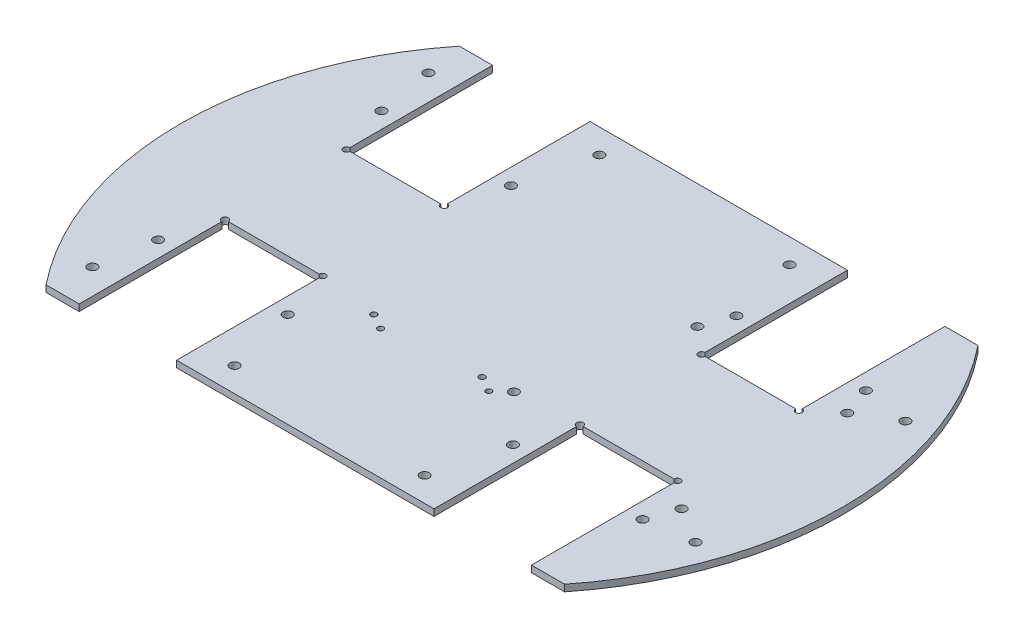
ISO-10303-21;
HEADER;
FILE_DESCRIPTION(('STEP AP214'),'2;1');
FILE_NAME('part.step','',(''),(''),'','','');
FILE_SCHEMA(('AUTOMOTIVE_DESIGN { 1 0 10303 214 1 1 1 1 }'));
ENDSEC;
DATA;
#1=APPLICATION_CONTEXT('core data for automotive mechanical design processes');
#2=APPLICATION_PROTOCOL_DEFINITION('international standard','automotive_design',2000,#1);
#3=PRODUCT_CONTEXT('',#1,'mechanical');
#4=PRODUCT('Part','Part','',(#3));
#5=PRODUCT_RELATED_PRODUCT_CATEGORY('part','',(#4));
#6=PRODUCT_DEFINITION_FORMATION('','',#4);
#7=PRODUCT_DEFINITION_CONTEXT('part definition',#1,'design');
#8=PRODUCT_DEFINITION('design','',#6,#7);
#9=PRODUCT_DEFINITION_SHAPE('','',#8);
#10=(LENGTH_UNIT() NAMED_UNIT(*) SI_UNIT(.MILLI.,.METRE.));
#11=(NAMED_UNIT(*) PLANE_ANGLE_UNIT() SI_UNIT($,.RADIAN.));
#12=(NAMED_UNIT(*) SI_UNIT($,.STERADIAN.) SOLID_ANGLE_UNIT());
#13=UNCERTAINTY_MEASURE_WITH_UNIT(LENGTH_MEASURE(1.E-05),#10,'distance_accuracy_value','');
#14=(GEOMETRIC_REPRESENTATION_CONTEXT(3) GLOBAL_UNCERTAINTY_ASSIGNED_CONTEXT((#13)) GLOBAL_UNIT_ASSIGNED_CONTEXT((#10,
#11,#12)) REPRESENTATION_CONTEXT('',''));
#15=CARTESIAN_POINT('',(0.,0.,0.));
#16=DIRECTION('',(0.,0.,1.));
#17=DIRECTION('',(1.,0.,0.));
#18=AXIS2_PLACEMENT_3D('',#15,#16,#17);
#19=CARTESIAN_POINT('',(0.,3.,0.));
#20=DIRECTION('',(0.,1.,0.));
#21=DIRECTION('',(0.,0.,1.));
#22=AXIS2_PLACEMENT_3D('',#19,#20,#21);
#23=PLANE('',#22);
#24=CARTESIAN_POINT('',(102.293435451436,3.,27.5));
#25=DIRECTION('',(0.,1.,0.));
#26=DIRECTION('',(0.,0.,-1.));
#27=AXIS2_PLACEMENT_3D('',#24,#25,#26);
#28=CIRCLE('',#27,1.5);
#29=CARTESIAN_POINT('',(102.293435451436,3.,29.));
#30=VERTEX_POINT('',#29);
#31=CARTESIAN_POINT('',(100.793435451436,3.,27.5));
#32=VERTEX_POINT('',#31);
#33=EDGE_CURVE('E63',#30,#32,#28,.T.);
#34=ORIENTED_EDGE('',*,*,#33,.F.);
#35=DIRECTION('',(0.,0.,-1.));
#36=VECTOR('',#35,1.);
#37=CARTESIAN_POINT('',(102.293435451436,3.,93.5));
#38=LINE('',#37,#36);
#39=CARTESIAN_POINT('',(102.293435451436,3.,93.5));
#40=VERTEX_POINT('',#39);
#41=EDGE_CURVE('E245',#40,#30,#38,.T.);
#42=ORIENTED_EDGE('',*,*,#41,.F.);
#43=DIRECTION('',(1.,0.,0.));
#44=VECTOR('',#43,1.);
#45=CARTESIAN_POINT('',(117.293435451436,3.,93.5));
#46=LINE('',#45,#44);
#47=CARTESIAN_POINT('',(117.293435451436,3.,93.5));
#48=VERTEX_POINT('',#47);
#49=EDGE_CURVE('E420',#40,#48,#46,.T.);
#50=ORIENTED_EDGE('',*,*,#49,.T.);
#51=CARTESIAN_POINT('',(0.,3.,0.));
#52=DIRECTION('',(0.,1.,0.));
#53=DIRECTION('',(0.,0.,1.));
#54=AXIS2_PLACEMENT_3D('',#51,#52,#53);
#55=CIRCLE('',#54,150.);
#56=CARTESIAN_POINT('',(117.293435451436,3.,-93.5));
#57=VERTEX_POINT('',#56);
#58=EDGE_CURVE('E426',#48,#57,#55,.T.);
#59=ORIENTED_EDGE('',*,*,#58,.T.);
#60=DIRECTION('',(-1.,0.,0.));
#61=VECTOR('',#60,1.);
#62=CARTESIAN_POINT('',(-117.293435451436,3.,-93.5));
#63=LINE('',#62,#61);
#64=CARTESIAN_POINT('',(102.293435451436,3.,-93.5));
#65=VERTEX_POINT('',#64);
#66=EDGE_CURVE('E431',#57,#65,#63,.T.);
#67=ORIENTED_EDGE('',*,*,#66,.T.);
#68=DIRECTION('',(0.,0.,1.));
#69=VECTOR('',#68,1.);
#70=CARTESIAN_POINT('',(102.293435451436,3.,-93.5));
#71=LINE('',#70,#69);
#72=CARTESIAN_POINT('',(102.293435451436,3.,-29.));
#73=VERTEX_POINT('',#72);
#74=EDGE_CURVE('E351',#65,#73,#71,.T.);
#75=ORIENTED_EDGE('',*,*,#74,.T.);
#76=CARTESIAN_POINT('',(102.293435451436,3.,-27.5));
#77=DIRECTION('',(0.,-1.,0.));
#78=DIRECTION('',(0.,0.,1.));
#79=AXIS2_PLACEMENT_3D('',#76,#77,#78);
#80=CIRCLE('',#79,1.5);
#81=CARTESIAN_POINT('',(100.793435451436,3.,-27.5));
#82=VERTEX_POINT('',#81);
#83=EDGE_CURVE('E713',#73,#82,#80,.T.);
#84=ORIENTED_EDGE('',*,*,#83,.T.);
#85=DIRECTION('',(-1.,0.,0.));
#86=VECTOR('',#85,1.);
#87=CARTESIAN_POINT('',(102.293435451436,3.,-27.5));
#88=LINE('',#87,#86);
#89=CARTESIAN_POINT('',(59.7234354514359,3.,-27.5));
#90=VERTEX_POINT('',#89);
#91=EDGE_CURVE('E358',#82,#90,#88,.T.);
#92=ORIENTED_EDGE('',*,*,#91,.T.);
#93=CARTESIAN_POINT('',(58.2234354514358,3.,-27.5));
#94=DIRECTION('',(0.,-1.,0.));
#95=DIRECTION('',(0.,0.,1.));
#96=AXIS2_PLACEMENT_3D('',#93,#94,#95);
#97=CIRCLE('',#96,1.5);
#98=CARTESIAN_POINT('',(58.2234354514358,3.,-29.));
#99=VERTEX_POINT('',#98);
#100=EDGE_CURVE('E701',#90,#99,#97,.T.);
#101=ORIENTED_EDGE('',*,*,#100,.T.);
#102=DIRECTION('',(0.,0.,-1.));
#103=VECTOR('',#102,1.);
#104=CARTESIAN_POINT('',(58.2234354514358,3.,-93.5));
#105=LINE('',#104,#103);
#106=CARTESIAN_POINT('',(58.2234354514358,3.,-93.5));
#107=VERTEX_POINT('',#106);
#108=EDGE_CURVE('E355',#99,#107,#105,.T.);
#109=ORIENTED_EDGE('',*,*,#108,.T.);
#110=CARTESIAN_POINT('',(-58.2234354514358,3.,-93.5));
#111=VERTEX_POINT('',#110);
#112=EDGE_CURVE('E436',#107,#111,#63,.T.);
#113=ORIENTED_EDGE('',*,*,#112,.T.);
#114=DIRECTION('',(0.,0.,-1.));
#115=VECTOR('',#114,1.);
#116=CARTESIAN_POINT('',(-58.2234354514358,3.,-93.5));
#117=LINE('',#116,#115);
#118=CARTESIAN_POINT('',(-58.2234354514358,3.,-29.));
#119=VERTEX_POINT('',#118);
#120=EDGE_CURVE('E401',#119,#111,#117,.T.);
#121=ORIENTED_EDGE('',*,*,#120,.F.);
#122=CARTESIAN_POINT('',(-58.2234354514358,3.,-27.5));
#123=DIRECTION('',(0.,1.,0.));
#124=DIRECTION('',(0.,0.,1.));
#125=AXIS2_PLACEMENT_3D('',#122,#123,#124);
#126=CIRCLE('',#125,1.5);
#127=CARTESIAN_POINT('',(-59.7234354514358,3.,-27.5));
#128=VERTEX_POINT('',#127);
#129=EDGE_CURVE('E652',#128,#119,#126,.T.);
#130=ORIENTED_EDGE('',*,*,#129,.F.);
#131=DIRECTION('',(1.,0.,0.));
#132=VECTOR('',#131,1.);
#133=CARTESIAN_POINT('',(-102.293435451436,3.,-27.5));
#134=LINE('',#133,#132);
#135=CARTESIAN_POINT('',(-100.793435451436,3.,-27.5));
#136=VERTEX_POINT('',#135);
#137=EDGE_CURVE('E397',#136,#128,#134,.T.);
#138=ORIENTED_EDGE('',*,*,#137,.F.);
#139=CARTESIAN_POINT('',(-102.293435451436,3.,-27.5));
#140=DIRECTION('',(0.,1.,0.));
#141=DIRECTION('',(0.,0.,1.));
#142=AXIS2_PLACEMENT_3D('',#139,#140,#141);
#143=CIRCLE('',#142,1.5);
#144=CARTESIAN_POINT('',(-102.293435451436,3.,-29.));
#145=VERTEX_POINT('',#144);
#146=EDGE_CURVE('E661',#145,#136,#143,.T.);
#147=ORIENTED_EDGE('',*,*,#146,.F.);
#148=DIRECTION('',(0.,0.,1.));
#149=VECTOR('',#148,1.);
#150=CARTESIAN_POINT('',(-102.293435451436,3.,-93.5));
#151=LINE('',#150,#149);
#152=CARTESIAN_POINT('',(-102.293435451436,3.,-93.5));
#153=VERTEX_POINT('',#152);
#154=EDGE_CURVE('E393',#153,#145,#151,.T.);
#155=ORIENTED_EDGE('',*,*,#154,.F.);
#156=CARTESIAN_POINT('',(-117.293435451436,3.,-93.5));
#157=VERTEX_POINT('',#156);
#158=EDGE_CURVE('E430',#153,#157,#63,.T.);
#159=ORIENTED_EDGE('',*,*,#158,.T.);
#160=CARTESIAN_POINT('',(0.,3.,0.));
#161=DIRECTION('',(0.,1.,0.));
#162=DIRECTION('',(0.,0.,1.));
#163=AXIS2_PLACEMENT_3D('',#160,#161,#162);
#164=CIRCLE('',#163,150.);
#165=CARTESIAN_POINT('',(-117.293435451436,3.,93.5));
#166=VERTEX_POINT('',#165);
#167=EDGE_CURVE('E416',#157,#166,#164,.T.);
#168=ORIENTED_EDGE('',*,*,#167,.T.);
#169=CARTESIAN_POINT('',(-102.293435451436,3.,93.5));
#170=VERTEX_POINT('',#169);
#171=EDGE_CURVE('E422',#166,#170,#46,.T.);
#172=ORIENTED_EDGE('',*,*,#171,.T.);
#173=DIRECTION('',(0.,0.,-1.));
#174=VECTOR('',#173,1.);
#175=CARTESIAN_POINT('',(-102.293435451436,3.,93.5));
#176=LINE('',#175,#174);
#177=CARTESIAN_POINT('',(-102.293435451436,3.,29.));
#178=VERTEX_POINT('',#177);
#179=EDGE_CURVE('E305',#170,#178,#176,.T.);
#180=ORIENTED_EDGE('',*,*,#179,.T.);
#181=CARTESIAN_POINT('',(-102.293435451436,3.,27.5));
#182=DIRECTION('',(0.,-1.,0.));
#183=DIRECTION('',(0.,0.,-1.));
#184=AXIS2_PLACEMENT_3D('',#181,#182,#183);
#185=CIRCLE('',#184,1.5);
#186=CARTESIAN_POINT('',(-100.793435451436,3.,27.5));
#187=VERTEX_POINT('',#186);
#188=EDGE_CURVE('E687',#178,#187,#185,.T.);
#189=ORIENTED_EDGE('',*,*,#188,.T.);
#190=DIRECTION('',(1.,0.,0.));
#191=VECTOR('',#190,1.);
#192=CARTESIAN_POINT('',(-102.293435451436,3.,27.5));
#193=LINE('',#192,#191);
#194=CARTESIAN_POINT('',(-59.7234354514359,3.,27.5));
#195=VERTEX_POINT('',#194);
#196=EDGE_CURVE('E312',#187,#195,#193,.T.);
#197=ORIENTED_EDGE('',*,*,#196,.T.);
#198=CARTESIAN_POINT('',(-58.2234354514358,3.,27.5));
#199=DIRECTION('',(0.,-1.,0.));
#200=DIRECTION('',(0.,0.,-1.));
#201=AXIS2_PLACEMENT_3D('',#198,#199,#200);
#202=CIRCLE('',#201,1.5);
#203=CARTESIAN_POINT('',(-58.2234354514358,3.,29.));
#204=VERTEX_POINT('',#203);
#205=EDGE_CURVE('E674',#195,#204,#202,.T.);
#206=ORIENTED_EDGE('',*,*,#205,.T.);
#207=DIRECTION('',(0.,0.,1.));
#208=VECTOR('',#207,1.);
#209=CARTESIAN_POINT('',(-58.2234354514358,3.,93.5));
#210=LINE('',#209,#208);
#211=CARTESIAN_POINT('',(-58.2234354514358,3.,93.5));
#212=VERTEX_POINT('',#211);
#213=EDGE_CURVE('E309',#204,#212,#210,.T.);
#214=ORIENTED_EDGE('',*,*,#213,.T.);
#215=CARTESIAN_POINT('',(58.2234354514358,3.,93.5));
#216=VERTEX_POINT('',#215);
#217=EDGE_CURVE('E427',#212,#216,#46,.T.);
#218=ORIENTED_EDGE('',*,*,#217,.T.);
#219=DIRECTION('',(0.,0.,1.));
#220=VECTOR('',#219,1.);
#221=CARTESIAN_POINT('',(58.2234354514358,3.,93.5));
#222=LINE('',#221,#220);
#223=CARTESIAN_POINT('',(58.2234354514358,3.,29.));
#224=VERTEX_POINT('',#223);
#225=EDGE_CURVE('E260',#224,#216,#222,.T.);
#226=ORIENTED_EDGE('',*,*,#225,.F.);
#227=CARTESIAN_POINT('',(58.2234354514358,3.,27.5));
#228=DIRECTION('',(0.,1.,0.));
#229=DIRECTION('',(0.,0.,-1.));
#230=AXIS2_PLACEMENT_3D('',#227,#228,#229);
#231=CIRCLE('',#230,1.5);
#232=CARTESIAN_POINT('',(59.7234354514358,3.,27.5));
#233=VERTEX_POINT('',#232);
#234=EDGE_CURVE('E723',#233,#224,#231,.T.);
#235=ORIENTED_EDGE('',*,*,#234,.F.);
#236=DIRECTION('',(-1.,0.,0.));
#237=VECTOR('',#236,1.);
#238=CARTESIAN_POINT('',(102.293435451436,3.,27.5));
#239=LINE('',#238,#237);
#240=EDGE_CURVE('E249',#32,#233,#239,.T.);
#241=ORIENTED_EDGE('',*,*,#240,.F.);
#242=EDGE_LOOP('',(#34,#42,#50,#59,#67,#75,#84,#92,#101,#109,#113,#121,#130,#138,#147,#155,#159,
#168,#172,#180,#189,#197,#206,#214,#218,#226,#235,#241));
#243=FACE_BOUND('',#242,.T.);
#244=CARTESIAN_POINT('',(-31.5265645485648,3.,31.));
#245=DIRECTION('',(0.,1.,0.));
#246=DIRECTION('',(0.,0.,1.));
#247=AXIS2_PLACEMENT_3D('',#244,#245,#246);
#248=CIRCLE('',#247,1.35);
#249=CARTESIAN_POINT('',(-31.5265645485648,3.,32.35));
#250=VERTEX_POINT('',#249);
#251=EDGE_CURVE('E595',#250,#250,#248,.T.);
#252=ORIENTED_EDGE('',*,*,#251,.F.);
#253=EDGE_LOOP('',(#252));
#254=FACE_BOUND('',#253,.T.);
#255=CARTESIAN_POINT('',(30.4634354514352,3.,29.615));
#256=DIRECTION('',(0.,1.,0.));
#257=DIRECTION('',(0.,0.,1.));
#258=AXIS2_PLACEMENT_3D('',#255,#256,#257);
#259=CIRCLE('',#258,2.09999999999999);
#260=CARTESIAN_POINT('',(30.4634354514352,3.,31.715));
#261=VERTEX_POINT('',#260);
#262=EDGE_CURVE('E615',#261,#261,#259,.T.);
#263=ORIENTED_EDGE('',*,*,#262,.F.);
#264=EDGE_LOOP('',(#263));
#265=FACE_BOUND('',#264,.T.);
#266=CARTESIAN_POINT('',(24.5,3.,35.));
#267=DIRECTION('',(0.,1.,0.));
#268=DIRECTION('',(0.,0.,1.));
#269=AXIS2_PLACEMENT_3D('',#266,#267,#268);
#270=CIRCLE('',#269,1.29999999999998);
#271=CARTESIAN_POINT('',(24.5,3.,36.3));
#272=VERTEX_POINT('',#271);
#273=EDGE_CURVE('E625',#272,#272,#270,.T.);
#274=ORIENTED_EDGE('',*,*,#273,.F.);
#275=EDGE_LOOP('',(#274));
#276=FACE_BOUND('',#275,.T.);
#277=CARTESIAN_POINT('',(-24.5,3.,35.));
#278=DIRECTION('',(0.,1.,0.));
#279=DIRECTION('',(0.,0.,1.));
#280=AXIS2_PLACEMENT_3D('',#277,#278,#279);
#281=CIRCLE('',#280,1.29999999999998);
#282=CARTESIAN_POINT('',(-24.5,3.,36.3));
#283=VERTEX_POINT('',#282);
#284=EDGE_CURVE('E608',#283,#283,#281,.T.);
#285=ORIENTED_EDGE('',*,*,#284,.F.);
#286=EDGE_LOOP('',(#285));
#287=FACE_BOUND('',#286,.T.);
#288=CARTESIAN_POINT('',(17.4734354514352,3.,31.));
#289=DIRECTION('',(0.,1.,0.));
#290=DIRECTION('',(0.,0.,1.));
#291=AXIS2_PLACEMENT_3D('',#288,#289,#290);
#292=CIRCLE('',#291,1.35);
#293=CARTESIAN_POINT('',(17.4734354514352,3.,32.35));
#294=VERTEX_POINT('',#293);
#295=EDGE_CURVE('E591',#294,#294,#292,.T.);
#296=ORIENTED_EDGE('',*,*,#295,.F.);
#297=EDGE_LOOP('',(#296));
#298=FACE_BOUND('',#297,.T.);
#299=CARTESIAN_POINT('',(114.153435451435,3.,-37.485));
#300=DIRECTION('',(0.,1.,0.));
#301=DIRECTION('',(0.,0.,1.));
#302=AXIS2_PLACEMENT_3D('',#299,#300,#301);
#303=CIRCLE('',#302,2.1);
#304=CARTESIAN_POINT('',(114.153435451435,3.,-35.385));
#305=VERTEX_POINT('',#304);
#306=EDGE_CURVE('E581',#305,#305,#303,.T.);
#307=ORIENTED_EDGE('',*,*,#306,.F.);
#308=EDGE_LOOP('',(#307));
#309=FACE_BOUND('',#308,.T.);
#310=CARTESIAN_POINT('',(114.153435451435,3.,37.485));
#311=DIRECTION('',(0.,1.,0.));
#312=DIRECTION('',(0.,0.,1.));
#313=AXIS2_PLACEMENT_3D('',#310,#311,#312);
#314=CIRCLE('',#313,2.1);
#315=CARTESIAN_POINT('',(114.153435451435,3.,39.585));
#316=VERTEX_POINT('',#315);
#317=EDGE_CURVE('E590',#316,#316,#314,.T.);
#318=ORIENTED_EDGE('',*,*,#317,.F.);
#319=EDGE_LOOP('',(#318));
#320=FACE_BOUND('',#319,.T.);
#321=CARTESIAN_POINT('',(46.3634354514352,3.,-37.485));
#322=DIRECTION('',(0.,1.,0.));
#323=DIRECTION('',(0.,0.,1.));
#324=AXIS2_PLACEMENT_3D('',#321,#322,#323);
#325=CIRCLE('',#324,2.1);
#326=CARTESIAN_POINT('',(46.3634354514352,3.,-35.385));
#327=VERTEX_POINT('',#326);
#328=EDGE_CURVE('E599',#327,#327,#325,.T.);
#329=ORIENTED_EDGE('',*,*,#328,.F.);
#330=EDGE_LOOP('',(#329));
#331=FACE_BOUND('',#330,.T.);
#332=CARTESIAN_POINT('',(-113.813435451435,3.,76.));
#333=DIRECTION('',(0.,1.,0.));
#334=DIRECTION('',(0.,0.,-1.));
#335=AXIS2_PLACEMENT_3D('',#332,#333,#334);
#336=CIRCLE('',#335,2.1);
#337=CARTESIAN_POINT('',(-113.813435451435,3.,73.9));
#338=VERTEX_POINT('',#337);
#339=EDGE_CURVE('E529',#338,#338,#336,.T.);
#340=ORIENTED_EDGE('',*,*,#339,.F.);
#341=EDGE_LOOP('',(#340));
#342=FACE_BOUND('',#341,.T.);
#343=CARTESIAN_POINT('',(-42.9934354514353,3.,82.5));
#344=DIRECTION('',(0.,1.,0.));
#345=DIRECTION('',(0.,0.,-1.));
#346=AXIS2_PLACEMENT_3D('',#343,#344,#345);
#347=CIRCLE('',#346,2.1);
#348=CARTESIAN_POINT('',(-42.9934354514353,3.,80.4));
#349=VERTEX_POINT('',#348);
#350=EDGE_CURVE('E538',#349,#349,#347,.T.);
#351=ORIENTED_EDGE('',*,*,#350,.F.);
#352=EDGE_LOOP('',(#351));
#353=FACE_BOUND('',#352,.T.);
#354=CARTESIAN_POINT('',(42.9934354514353,3.,82.5));
#355=DIRECTION('',(0.,1.,0.));
#356=DIRECTION('',(0.,0.,-1.));
#357=AXIS2_PLACEMENT_3D('',#354,#355,#356);
#358=CIRCLE('',#357,2.1);
#359=CARTESIAN_POINT('',(42.9934354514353,3.,80.4));
#360=VERTEX_POINT('',#359);
#361=EDGE_CURVE('E546',#360,#360,#358,.T.);
#362=ORIENTED_EDGE('',*,*,#361,.F.);
#363=EDGE_LOOP('',(#362));
#364=FACE_BOUND('',#363,.T.);
#365=CARTESIAN_POINT('',(130.463435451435,3.,47.48));
#366=DIRECTION('',(0.,1.,0.));
#367=DIRECTION('',(0.,0.,-1.));
#368=AXIS2_PLACEMENT_3D('',#365,#366,#367);
#369=CIRCLE('',#368,2.10000000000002);
#370=CARTESIAN_POINT('',(130.463435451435,3.,45.38));
#371=VERTEX_POINT('',#370);
#372=EDGE_CURVE('E554',#371,#371,#369,.T.);
#373=ORIENTED_EDGE('',*,*,#372,.F.);
#374=EDGE_LOOP('',(#373));
#375=FACE_BOUND('',#374,.T.);
#376=CARTESIAN_POINT('',(130.463435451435,3.,-47.48));
#377=DIRECTION('',(0.,1.,0.));
#378=DIRECTION('',(0.,0.,1.));
#379=AXIS2_PLACEMENT_3D('',#376,#377,#378);
#380=CIRCLE('',#379,2.10000000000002);
#381=CARTESIAN_POINT('',(130.463435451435,3.,-45.38));
#382=VERTEX_POINT('',#381);
#383=EDGE_CURVE('E562',#382,#382,#380,.T.);
#384=ORIENTED_EDGE('',*,*,#383,.F.);
#385=EDGE_LOOP('',(#384));
#386=FACE_BOUND('',#385,.T.);
#387=CARTESIAN_POINT('',(-113.813435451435,3.,-76.));
#388=DIRECTION('',(0.,1.,0.));
#389=DIRECTION('',(0.,0.,1.));
#390=AXIS2_PLACEMENT_3D('',#387,#388,#389);
#391=CIRCLE('',#390,2.1);
#392=CARTESIAN_POINT('',(-113.813435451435,3.,-73.9));
#393=VERTEX_POINT('',#392);
#394=EDGE_CURVE('E570',#393,#393,#391,.T.);
#395=ORIENTED_EDGE('',*,*,#394,.F.);
#396=EDGE_LOOP('',(#395));
#397=FACE_BOUND('',#396,.T.);
#398=CARTESIAN_POINT('',(42.9934354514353,3.,-82.5));
#399=DIRECTION('',(0.,1.,0.));
#400=DIRECTION('',(0.,0.,1.));
#401=AXIS2_PLACEMENT_3D('',#398,#399,#400);
#402=CIRCLE('',#401,2.1);
#403=CARTESIAN_POINT('',(42.9934354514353,3.,-80.4));
#404=VERTEX_POINT('',#403);
#405=EDGE_CURVE('E521',#404,#404,#402,.T.);
#406=ORIENTED_EDGE('',*,*,#405,.F.);
#407=EDGE_LOOP('',(#406));
#408=FACE_BOUND('',#407,.T.);
#409=CARTESIAN_POINT('',(-42.9934354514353,3.,-82.5));
#410=DIRECTION('',(0.,1.,0.));
#411=DIRECTION('',(0.,0.,1.));
#412=AXIS2_PLACEMENT_3D('',#409,#410,#411);
#413=CIRCLE('',#412,2.1);
#414=CARTESIAN_POINT('',(-42.9934354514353,3.,-80.4));
#415=VERTEX_POINT('',#414);
#416=EDGE_CURVE('E517',#415,#415,#413,.T.);
#417=ORIENTED_EDGE('',*,*,#416,.F.);
#418=EDGE_LOOP('',(#417));
#419=FACE_BOUND('',#418,.T.);
#420=CARTESIAN_POINT('',(50.9684354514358,3.,50.5));
#421=DIRECTION('',(0.,1.,0.));
#422=DIRECTION('',(0.,0.,-1.));
#423=AXIS2_PLACEMENT_3D('',#420,#421,#422);
#424=CIRCLE('',#423,2.1);
#425=CARTESIAN_POINT('',(50.9684354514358,3.,52.6));
#426=VERTEX_POINT('',#425);
#427=EDGE_CURVE('E509',#426,#426,#424,.T.);
#428=ORIENTED_EDGE('',*,*,#427,.F.);
#429=EDGE_LOOP('',(#428));
#430=FACE_BOUND('',#429,.T.);
#431=CARTESIAN_POINT('',(109.548435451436,3.,50.5));
#432=DIRECTION('',(0.,1.,0.));
#433=DIRECTION('',(0.,0.,-1.));
#434=AXIS2_PLACEMENT_3D('',#431,#432,#433);
#435=CIRCLE('',#434,2.1);
#436=CARTESIAN_POINT('',(109.548435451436,3.,52.6));
#437=VERTEX_POINT('',#436);
#438=EDGE_CURVE('E502',#437,#437,#435,.T.);
#439=ORIENTED_EDGE('',*,*,#438,.F.);
#440=EDGE_LOOP('',(#439));
#441=FACE_BOUND('',#440,.T.);
#442=CARTESIAN_POINT('',(-109.548435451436,3.,50.5));
#443=DIRECTION('',(0.,-1.,0.));
#444=DIRECTION('',(0.,0.,-1.));
#445=AXIS2_PLACEMENT_3D('',#442,#443,#444);
#446=CIRCLE('',#445,2.1);
#447=CARTESIAN_POINT('',(-109.548435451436,3.,52.6));
#448=VERTEX_POINT('',#447);
#449=EDGE_CURVE('E279',#448,#448,#446,.T.);
#450=ORIENTED_EDGE('',*,*,#449,.T.);
#451=EDGE_LOOP('',(#450));
#452=FACE_BOUND('',#451,.T.);
#453=CARTESIAN_POINT('',(109.548435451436,3.,-50.5));
#454=DIRECTION('',(0.,-1.,0.));
#455=DIRECTION('',(0.,0.,1.));
#456=AXIS2_PLACEMENT_3D('',#453,#454,#455);
#457=CIRCLE('',#456,2.1);
#458=CARTESIAN_POINT('',(109.548435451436,3.,-48.4));
#459=VERTEX_POINT('',#458);
#460=EDGE_CURVE('E325',#459,#459,#457,.T.);
#461=ORIENTED_EDGE('',*,*,#460,.T.);
#462=EDGE_LOOP('',(#461));
#463=FACE_BOUND('',#462,.T.);
#464=CARTESIAN_POINT('',(-50.9684354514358,3.,-50.5));
#465=DIRECTION('',(0.,1.,0.));
#466=DIRECTION('',(0.,0.,1.));
#467=AXIS2_PLACEMENT_3D('',#464,#465,#466);
#468=CIRCLE('',#467,2.1);
#469=CARTESIAN_POINT('',(-50.9684354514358,3.,-48.4));
#470=VERTEX_POINT('',#469);
#471=EDGE_CURVE('E376',#470,#470,#468,.T.);
#472=ORIENTED_EDGE('',*,*,#471,.F.);
#473=EDGE_LOOP('',(#472));
#474=FACE_BOUND('',#473,.T.);
#475=CARTESIAN_POINT('',(-109.548435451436,3.,-50.5));
#476=DIRECTION('',(0.,1.,0.));
#477=DIRECTION('',(0.,0.,1.));
#478=AXIS2_PLACEMENT_3D('',#475,#476,#477);
#479=CIRCLE('',#478,2.1);
#480=CARTESIAN_POINT('',(-109.548435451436,3.,-48.4));
#481=VERTEX_POINT('',#480);
#482=EDGE_CURVE('E375',#481,#481,#479,.T.);
#483=ORIENTED_EDGE('',*,*,#482,.F.);
#484=EDGE_LOOP('',(#483));
#485=FACE_BOUND('',#484,.T.);
#486=CARTESIAN_POINT('',(50.9684354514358,3.,-50.5));
#487=DIRECTION('',(0.,-1.,0.));
#488=DIRECTION('',(0.,0.,1.));
#489=AXIS2_PLACEMENT_3D('',#486,#487,#488);
#490=CIRCLE('',#489,2.1);
#491=CARTESIAN_POINT('',(50.9684354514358,3.,-48.4));
#492=VERTEX_POINT('',#491);
#493=EDGE_CURVE('E334',#492,#492,#490,.T.);
#494=ORIENTED_EDGE('',*,*,#493,.T.);
#495=EDGE_LOOP('',(#494));
#496=FACE_BOUND('',#495,.T.);
#497=CARTESIAN_POINT('',(-50.9684354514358,3.,50.5));
#498=DIRECTION('',(0.,-1.,0.));
#499=DIRECTION('',(0.,0.,-1.));
#500=AXIS2_PLACEMENT_3D('',#497,#498,#499);
#501=CIRCLE('',#500,2.1);
#502=CARTESIAN_POINT('',(-50.9684354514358,3.,52.6));
#503=VERTEX_POINT('',#502);
#504=EDGE_CURVE('E288',#503,#503,#501,.T.);
#505=ORIENTED_EDGE('',*,*,#504,.T.);
#506=EDGE_LOOP('',(#505));
#507=FACE_BOUND('',#506,.T.);
#508=ADVANCED_FACE('F47',(#243,#254,#265,#276,#287,#298,#309,#320,#331,#342,#353,#364,#375,#386,
#397,#408,#419,#430,#441,#452,#463,#474,#485,#496,#507),#23,.T.);
#509=CARTESIAN_POINT('',(0.,0.,0.));
#510=DIRECTION('',(0.,1.,0.));
#511=DIRECTION('',(0.,0.,1.));
#512=AXIS2_PLACEMENT_3D('',#509,#510,#511);
#513=PLANE('',#512);
#514=CARTESIAN_POINT('',(-31.5265645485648,0.,31.));
#515=DIRECTION('',(0.,1.,0.));
#516=DIRECTION('',(0.,0.,1.));
#517=AXIS2_PLACEMENT_3D('',#514,#515,#516);
#518=CIRCLE('',#517,1.35);
#519=CARTESIAN_POINT('',(-31.5265645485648,0.,32.35));
#520=VERTEX_POINT('',#519);
#521=EDGE_CURVE('E530',#520,#520,#518,.F.);
#522=ORIENTED_EDGE('',*,*,#521,.F.);
#523=EDGE_LOOP('',(#522));
#524=FACE_BOUND('',#523,.T.);
#525=CARTESIAN_POINT('',(30.4634354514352,0.,29.615));
#526=DIRECTION('',(0.,1.,0.));
#527=DIRECTION('',(0.,0.,1.));
#528=AXIS2_PLACEMENT_3D('',#525,#526,#527);
#529=CIRCLE('',#528,2.09999999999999);
#530=CARTESIAN_POINT('',(30.4634354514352,0.,31.715));
#531=VERTEX_POINT('',#530);
#532=EDGE_CURVE('E620',#531,#531,#529,.F.);
#533=ORIENTED_EDGE('',*,*,#532,.F.);
#534=EDGE_LOOP('',(#533));
#535=FACE_BOUND('',#534,.T.);
#536=CARTESIAN_POINT('',(24.5,0.,35.));
#537=DIRECTION('',(0.,1.,0.));
#538=DIRECTION('',(0.,0.,1.));
#539=AXIS2_PLACEMENT_3D('',#536,#537,#538);
#540=CIRCLE('',#539,1.29999999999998);
#541=CARTESIAN_POINT('',(24.5,0.,36.3));
#542=VERTEX_POINT('',#541);
#543=EDGE_CURVE('E619',#542,#542,#540,.F.);
#544=ORIENTED_EDGE('',*,*,#543,.F.);
#545=EDGE_LOOP('',(#544));
#546=FACE_BOUND('',#545,.T.);
#547=CARTESIAN_POINT('',(-24.5,0.,35.));
#548=DIRECTION('',(0.,1.,0.));
#549=DIRECTION('',(0.,0.,1.));
#550=AXIS2_PLACEMENT_3D('',#547,#548,#549);
#551=CIRCLE('',#550,1.29999999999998);
#552=CARTESIAN_POINT('',(-24.5,0.,36.3));
#553=VERTEX_POINT('',#552);
#554=EDGE_CURVE('E629',#553,#553,#551,.F.);
#555=ORIENTED_EDGE('',*,*,#554,.F.);
#556=EDGE_LOOP('',(#555));
#557=FACE_BOUND('',#556,.T.);
#558=CARTESIAN_POINT('',(17.4734354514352,0.,31.));
#559=DIRECTION('',(0.,1.,0.));
#560=DIRECTION('',(0.,0.,1.));
#561=AXIS2_PLACEMENT_3D('',#558,#559,#560);
#562=CIRCLE('',#561,1.35);
#563=CARTESIAN_POINT('',(17.4734354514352,0.,32.35));
#564=VERTEX_POINT('',#563);
#565=EDGE_CURVE('E585',#564,#564,#562,.F.);
#566=ORIENTED_EDGE('',*,*,#565,.F.);
#567=EDGE_LOOP('',(#566));
#568=FACE_BOUND('',#567,.T.);
#569=CARTESIAN_POINT('',(114.153435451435,0.,-37.485));
#570=DIRECTION('',(0.,1.,0.));
#571=DIRECTION('',(0.,0.,1.));
#572=AXIS2_PLACEMENT_3D('',#569,#570,#571);
#573=CIRCLE('',#572,2.1);
#574=CARTESIAN_POINT('',(114.153435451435,0.,-35.385));
#575=VERTEX_POINT('',#574);
#576=EDGE_CURVE('E586',#575,#575,#573,.F.);
#577=ORIENTED_EDGE('',*,*,#576,.F.);
#578=EDGE_LOOP('',(#577));
#579=FACE_BOUND('',#578,.T.);
#580=CARTESIAN_POINT('',(114.153435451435,0.,37.485));
#581=DIRECTION('',(0.,1.,0.));
#582=DIRECTION('',(0.,0.,1.));
#583=AXIS2_PLACEMENT_3D('',#580,#581,#582);
#584=CIRCLE('',#583,2.1);
#585=CARTESIAN_POINT('',(114.153435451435,0.,39.585));
#586=VERTEX_POINT('',#585);
#587=EDGE_CURVE('E603',#586,#586,#584,.F.);
#588=ORIENTED_EDGE('',*,*,#587,.F.);
#589=EDGE_LOOP('',(#588));
#590=FACE_BOUND('',#589,.T.);
#591=CARTESIAN_POINT('',(46.3634354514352,0.,-37.485));
#592=DIRECTION('',(0.,1.,0.));
#593=DIRECTION('',(0.,0.,1.));
#594=AXIS2_PLACEMENT_3D('',#591,#592,#593);
#595=CIRCLE('',#594,2.1);
#596=CARTESIAN_POINT('',(46.3634354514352,0.,-35.385));
#597=VERTEX_POINT('',#596);
#598=EDGE_CURVE('E604',#597,#597,#595,.F.);
#599=ORIENTED_EDGE('',*,*,#598,.F.);
#600=EDGE_LOOP('',(#599));
#601=FACE_BOUND('',#600,.T.);
#602=CARTESIAN_POINT('',(-113.813435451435,0.,76.));
#603=DIRECTION('',(0.,1.,0.));
#604=DIRECTION('',(0.,0.,-1.));
#605=AXIS2_PLACEMENT_3D('',#602,#603,#604);
#606=CIRCLE('',#605,2.1);
#607=CARTESIAN_POINT('',(-113.813435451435,0.,73.9));
#608=VERTEX_POINT('',#607);
#609=EDGE_CURVE('E525',#608,#608,#606,.T.);
#610=ORIENTED_EDGE('',*,*,#609,.T.);
#611=EDGE_LOOP('',(#610));
#612=FACE_BOUND('',#611,.T.);
#613=CARTESIAN_POINT('',(-42.9934354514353,0.,82.5));
#614=DIRECTION('',(0.,1.,0.));
#615=DIRECTION('',(0.,0.,-1.));
#616=AXIS2_PLACEMENT_3D('',#613,#614,#615);
#617=CIRCLE('',#616,2.1);
#618=CARTESIAN_POINT('',(-42.9934354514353,0.,80.4));
#619=VERTEX_POINT('',#618);
#620=EDGE_CURVE('E534',#619,#619,#617,.T.);
#621=ORIENTED_EDGE('',*,*,#620,.T.);
#622=EDGE_LOOP('',(#621));
#623=FACE_BOUND('',#622,.T.);
#624=CARTESIAN_POINT('',(42.9934354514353,0.,82.5));
#625=DIRECTION('',(0.,1.,0.));
#626=DIRECTION('',(0.,0.,-1.));
#627=AXIS2_PLACEMENT_3D('',#624,#625,#626);
#628=CIRCLE('',#627,2.1);
#629=CARTESIAN_POINT('',(42.9934354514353,0.,80.4));
#630=VERTEX_POINT('',#629);
#631=EDGE_CURVE('E542',#630,#630,#628,.T.);
#632=ORIENTED_EDGE('',*,*,#631,.T.);
#633=EDGE_LOOP('',(#632));
#634=FACE_BOUND('',#633,.T.);
#635=CARTESIAN_POINT('',(130.463435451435,0.,47.48));
#636=DIRECTION('',(0.,1.,0.));
#637=DIRECTION('',(0.,0.,-1.));
#638=AXIS2_PLACEMENT_3D('',#635,#636,#637);
#639=CIRCLE('',#638,2.10000000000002);
#640=CARTESIAN_POINT('',(130.463435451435,0.,45.38));
#641=VERTEX_POINT('',#640);
#642=EDGE_CURVE('E550',#641,#641,#639,.T.);
#643=ORIENTED_EDGE('',*,*,#642,.T.);
#644=EDGE_LOOP('',(#643));
#645=FACE_BOUND('',#644,.T.);
#646=CARTESIAN_POINT('',(130.463435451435,0.,-47.48));
#647=DIRECTION('',(0.,1.,0.));
#648=DIRECTION('',(0.,0.,1.));
#649=AXIS2_PLACEMENT_3D('',#646,#647,#648);
#650=CIRCLE('',#649,2.10000000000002);
#651=CARTESIAN_POINT('',(130.463435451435,0.,-45.38));
#652=VERTEX_POINT('',#651);
#653=EDGE_CURVE('E558',#652,#652,#650,.T.);
#654=ORIENTED_EDGE('',*,*,#653,.T.);
#655=EDGE_LOOP('',(#654));
#656=FACE_BOUND('',#655,.T.);
#657=CARTESIAN_POINT('',(-113.813435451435,0.,-76.));
#658=DIRECTION('',(0.,1.,0.));
#659=DIRECTION('',(0.,0.,1.));
#660=AXIS2_PLACEMENT_3D('',#657,#658,#659);
#661=CIRCLE('',#660,2.1);
#662=CARTESIAN_POINT('',(-113.813435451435,0.,-73.9));
#663=VERTEX_POINT('',#662);
#664=EDGE_CURVE('E566',#663,#663,#661,.T.);
#665=ORIENTED_EDGE('',*,*,#664,.T.);
#666=EDGE_LOOP('',(#665));
#667=FACE_BOUND('',#666,.T.);
#668=CARTESIAN_POINT('',(42.9934354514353,0.,-82.5));
#669=DIRECTION('',(0.,1.,0.));
#670=DIRECTION('',(0.,0.,1.));
#671=AXIS2_PLACEMENT_3D('',#668,#669,#670);
#672=CIRCLE('',#671,2.1);
#673=CARTESIAN_POINT('',(42.9934354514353,0.,-80.4));
#674=VERTEX_POINT('',#673);
#675=EDGE_CURVE('E574',#674,#674,#672,.T.);
#676=ORIENTED_EDGE('',*,*,#675,.T.);
#677=EDGE_LOOP('',(#676));
#678=FACE_BOUND('',#677,.T.);
#679=CARTESIAN_POINT('',(-42.9934354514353,0.,-82.5));
#680=DIRECTION('',(0.,1.,0.));
#681=DIRECTION('',(0.,0.,1.));
#682=AXIS2_PLACEMENT_3D('',#679,#680,#681);
#683=CIRCLE('',#682,2.1);
#684=CARTESIAN_POINT('',(-42.9934354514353,0.,-80.4));
#685=VERTEX_POINT('',#684);
#686=EDGE_CURVE('E512',#685,#685,#683,.T.);
#687=ORIENTED_EDGE('',*,*,#686,.T.);
#688=EDGE_LOOP('',(#687));
#689=FACE_BOUND('',#688,.T.);
#690=CARTESIAN_POINT('',(50.9684354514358,0.,50.5));
#691=DIRECTION('',(0.,1.,0.));
#692=DIRECTION('',(0.,0.,1.));
#693=AXIS2_PLACEMENT_3D('',#690,#691,#692);
#694=CIRCLE('',#693,2.1);
#695=CARTESIAN_POINT('',(50.9684354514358,0.,52.6));
#696=VERTEX_POINT('',#695);
#697=EDGE_CURVE('E505',#696,#696,#694,.F.);
#698=ORIENTED_EDGE('',*,*,#697,.F.);
#699=EDGE_LOOP('',(#698));
#700=FACE_BOUND('',#699,.T.);
#701=CARTESIAN_POINT('',(109.548435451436,0.,50.5));
#702=DIRECTION('',(0.,1.,0.));
#703=DIRECTION('',(0.,0.,1.));
#704=AXIS2_PLACEMENT_3D('',#701,#702,#703);
#705=CIRCLE('',#704,2.1);
#706=CARTESIAN_POINT('',(109.548435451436,0.,52.6));
#707=VERTEX_POINT('',#706);
#708=EDGE_CURVE('E499',#707,#707,#705,.F.);
#709=ORIENTED_EDGE('',*,*,#708,.F.);
#710=EDGE_LOOP('',(#709));
#711=FACE_BOUND('',#710,.T.);
#712=CARTESIAN_POINT('',(50.9684354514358,0.,-50.5));
#713=DIRECTION('',(0.,1.,0.));
#714=DIRECTION('',(0.,0.,1.));
#715=AXIS2_PLACEMENT_3D('',#712,#713,#714);
#716=CIRCLE('',#715,2.1);
#717=CARTESIAN_POINT('',(50.9684354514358,0.,-48.4));
#718=VERTEX_POINT('',#717);
#719=EDGE_CURVE('E321',#718,#718,#716,.T.);
#720=ORIENTED_EDGE('',*,*,#719,.T.);
#721=EDGE_LOOP('',(#720));
#722=FACE_BOUND('',#721,.T.);
#723=CARTESIAN_POINT('',(109.548435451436,0.,-50.5));
#724=DIRECTION('',(0.,1.,0.));
#725=DIRECTION('',(0.,0.,1.));
#726=AXIS2_PLACEMENT_3D('',#723,#724,#725);
#727=CIRCLE('',#726,2.1);
#728=CARTESIAN_POINT('',(109.548435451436,0.,-48.4));
#729=VERTEX_POINT('',#728);
#730=EDGE_CURVE('E330',#729,#729,#727,.T.);
#731=ORIENTED_EDGE('',*,*,#730,.T.);
#732=EDGE_LOOP('',(#731));
#733=FACE_BOUND('',#732,.T.);
#734=CARTESIAN_POINT('',(-50.9684354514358,0.,-50.5));
#735=DIRECTION('',(0.,1.,0.));
#736=DIRECTION('',(0.,0.,1.));
#737=AXIS2_PLACEMENT_3D('',#734,#735,#736);
#738=CIRCLE('',#737,2.1);
#739=CARTESIAN_POINT('',(-50.9684354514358,0.,-48.4));
#740=VERTEX_POINT('',#739);
#741=EDGE_CURVE('E367',#740,#740,#738,.F.);
#742=ORIENTED_EDGE('',*,*,#741,.F.);
#743=EDGE_LOOP('',(#742));
#744=FACE_BOUND('',#743,.T.);
#745=CARTESIAN_POINT('',(-109.548435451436,0.,-50.5));
#746=DIRECTION('',(0.,1.,0.));
#747=DIRECTION('',(0.,0.,1.));
#748=AXIS2_PLACEMENT_3D('',#745,#746,#747);
#749=CIRCLE('',#748,2.1);
#750=CARTESIAN_POINT('',(-109.548435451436,0.,-48.4));
#751=VERTEX_POINT('',#750);
#752=EDGE_CURVE('E371',#751,#751,#749,.F.);
#753=ORIENTED_EDGE('',*,*,#752,.F.);
#754=EDGE_LOOP('',(#753));
#755=FACE_BOUND('',#754,.T.);
#756=CARTESIAN_POINT('',(-109.548435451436,0.,50.5));
#757=DIRECTION('',(0.,1.,0.));
#758=DIRECTION('',(0.,0.,1.));
#759=AXIS2_PLACEMENT_3D('',#756,#757,#758);
#760=CIRCLE('',#759,2.1);
#761=CARTESIAN_POINT('',(-109.548435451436,0.,52.6));
#762=VERTEX_POINT('',#761);
#763=EDGE_CURVE('E284',#762,#762,#760,.T.);
#764=ORIENTED_EDGE('',*,*,#763,.T.);
#765=EDGE_LOOP('',(#764));
#766=FACE_BOUND('',#765,.T.);
#767=CARTESIAN_POINT('',(-50.9684354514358,0.,50.5));
#768=DIRECTION('',(0.,1.,0.));
#769=DIRECTION('',(0.,0.,1.));
#770=AXIS2_PLACEMENT_3D('',#767,#768,#769);
#771=CIRCLE('',#770,2.1);
#772=CARTESIAN_POINT('',(-50.9684354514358,0.,52.6));
#773=VERTEX_POINT('',#772);
#774=EDGE_CURVE('E278',#773,#773,#771,.T.);
#775=ORIENTED_EDGE('',*,*,#774,.T.);
#776=EDGE_LOOP('',(#775));
#777=FACE_BOUND('',#776,.T.);
#778=DIRECTION('',(0.,0.,1.));
#779=VECTOR('',#778,1.);
#780=CARTESIAN_POINT('',(102.293435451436,0.,93.5));
#781=LINE('',#780,#779);
#782=CARTESIAN_POINT('',(102.293435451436,0.,29.));
#783=VERTEX_POINT('',#782);
#784=CARTESIAN_POINT('',(102.293435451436,0.,93.5));
#785=VERTEX_POINT('',#784);
#786=EDGE_CURVE('E256',#783,#785,#781,.T.);
#787=ORIENTED_EDGE('',*,*,#786,.F.);
#788=CARTESIAN_POINT('',(102.293435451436,0.,27.5));
#789=DIRECTION('',(0.,1.,0.));
#790=DIRECTION('',(0.,0.,1.));
#791=AXIS2_PLACEMENT_3D('',#788,#789,#790);
#792=CIRCLE('',#791,1.5);
#793=CARTESIAN_POINT('',(100.793435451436,0.,27.5));
#794=VERTEX_POINT('',#793);
#795=EDGE_CURVE('E234',#794,#783,#792,.F.);
#796=ORIENTED_EDGE('',*,*,#795,.F.);
#797=DIRECTION('',(1.,0.,0.));
#798=VECTOR('',#797,1.);
#799=CARTESIAN_POINT('',(102.293435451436,0.,27.5));
#800=LINE('',#799,#798);
#801=CARTESIAN_POINT('',(59.7234354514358,0.,27.5));
#802=VERTEX_POINT('',#801);
#803=EDGE_CURVE('E271',#802,#794,#800,.T.);
#804=ORIENTED_EDGE('',*,*,#803,.F.);
#805=CARTESIAN_POINT('',(58.2234354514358,0.,27.5));
#806=DIRECTION('',(0.,1.,0.));
#807=DIRECTION('',(0.,0.,1.));
#808=AXIS2_PLACEMENT_3D('',#805,#806,#807);
#809=CIRCLE('',#808,1.5);
#810=CARTESIAN_POINT('',(58.2234354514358,0.,29.));
#811=VERTEX_POINT('',#810);
#812=EDGE_CURVE('E71',#811,#802,#809,.F.);
#813=ORIENTED_EDGE('',*,*,#812,.F.);
#814=DIRECTION('',(0.,0.,-1.));
#815=VECTOR('',#814,1.);
#816=CARTESIAN_POINT('',(58.2234354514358,0.,93.5));
#817=LINE('',#816,#815);
#818=CARTESIAN_POINT('',(58.2234354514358,0.,93.5));
#819=VERTEX_POINT('',#818);
#820=EDGE_CURVE('E262',#819,#811,#817,.T.);
#821=ORIENTED_EDGE('',*,*,#820,.F.);
#822=DIRECTION('',(1.,0.,0.));
#823=VECTOR('',#822,1.);
#824=CARTESIAN_POINT('',(117.293435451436,0.,93.5));
#825=LINE('',#824,#823);
#826=CARTESIAN_POINT('',(-58.2234354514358,0.,93.5));
#827=VERTEX_POINT('',#826);
#828=EDGE_CURVE('E446',#827,#819,#825,.T.);
#829=ORIENTED_EDGE('',*,*,#828,.F.);
#830=DIRECTION('',(0.,0.,-1.));
#831=VECTOR('',#830,1.);
#832=CARTESIAN_POINT('',(-58.2234354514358,0.,93.5));
#833=LINE('',#832,#831);
#834=CARTESIAN_POINT('',(-58.2234354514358,0.,29.));
#835=VERTEX_POINT('',#834);
#836=EDGE_CURVE('E283',#827,#835,#833,.T.);
#837=ORIENTED_EDGE('',*,*,#836,.T.);
#838=CARTESIAN_POINT('',(-58.2234354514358,0.,27.5));
#839=DIRECTION('',(0.,1.,0.));
#840=DIRECTION('',(0.,0.,1.));
#841=AXIS2_PLACEMENT_3D('',#838,#839,#840);
#842=CIRCLE('',#841,1.5);
#843=CARTESIAN_POINT('',(-59.7234354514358,0.,27.5));
#844=VERTEX_POINT('',#843);
#845=EDGE_CURVE('E669',#835,#844,#842,.T.);
#846=ORIENTED_EDGE('',*,*,#845,.T.);
#847=DIRECTION('',(-1.,0.,0.));
#848=VECTOR('',#847,1.);
#849=CARTESIAN_POINT('',(-102.293435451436,0.,27.5));
#850=LINE('',#849,#848);
#851=CARTESIAN_POINT('',(-100.793435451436,0.,27.5));
#852=VERTEX_POINT('',#851);
#853=EDGE_CURVE('E298',#844,#852,#850,.T.);
#854=ORIENTED_EDGE('',*,*,#853,.T.);
#855=CARTESIAN_POINT('',(-102.293435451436,0.,27.5));
#856=DIRECTION('',(0.,1.,0.));
#857=DIRECTION('',(0.,0.,1.));
#858=AXIS2_PLACEMENT_3D('',#855,#856,#857);
#859=CIRCLE('',#858,1.5);
#860=CARTESIAN_POINT('',(-102.293435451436,0.,29.));
#861=VERTEX_POINT('',#860);
#862=EDGE_CURVE('E658',#852,#861,#859,.T.);
#863=ORIENTED_EDGE('',*,*,#862,.T.);
#864=DIRECTION('',(0.,0.,1.));
#865=VECTOR('',#864,1.);
#866=CARTESIAN_POINT('',(-102.293435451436,0.,93.5));
#867=LINE('',#866,#865);
#868=CARTESIAN_POINT('',(-102.293435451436,0.,93.5));
#869=VERTEX_POINT('',#868);
#870=EDGE_CURVE('E302',#861,#869,#867,.T.);
#871=ORIENTED_EDGE('',*,*,#870,.T.);
#872=CARTESIAN_POINT('',(-117.293435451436,0.,93.5));
#873=VERTEX_POINT('',#872);
#874=EDGE_CURVE('E441',#873,#869,#825,.T.);
#875=ORIENTED_EDGE('',*,*,#874,.F.);
#876=CARTESIAN_POINT('',(0.,0.,0.));
#877=DIRECTION('',(0.,1.,0.));
#878=DIRECTION('',(0.,0.,1.));
#879=AXIS2_PLACEMENT_3D('',#876,#877,#878);
#880=CIRCLE('',#879,150.);
#881=CARTESIAN_POINT('',(-117.293435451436,0.,-93.5));
#882=VERTEX_POINT('',#881);
#883=EDGE_CURVE('E415',#882,#873,#880,.T.);
#884=ORIENTED_EDGE('',*,*,#883,.F.);
#885=DIRECTION('',(-1.,0.,0.));
#886=VECTOR('',#885,1.);
#887=CARTESIAN_POINT('',(-117.293435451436,0.,-93.5));
#888=LINE('',#887,#886);
#889=CARTESIAN_POINT('',(-102.293435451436,0.,-93.5));
#890=VERTEX_POINT('',#889);
#891=EDGE_CURVE('E449',#890,#882,#888,.T.);
#892=ORIENTED_EDGE('',*,*,#891,.F.);
#893=DIRECTION('',(0.,0.,-1.));
#894=VECTOR('',#893,1.);
#895=CARTESIAN_POINT('',(-102.293435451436,0.,-93.5));
#896=LINE('',#895,#894);
#897=CARTESIAN_POINT('',(-102.293435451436,0.,-29.));
#898=VERTEX_POINT('',#897);
#899=EDGE_CURVE('E390',#898,#890,#896,.T.);
#900=ORIENTED_EDGE('',*,*,#899,.F.);
#901=CARTESIAN_POINT('',(-102.293435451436,0.,-27.5));
#902=DIRECTION('',(0.,1.,0.));
#903=DIRECTION('',(0.,0.,1.));
#904=AXIS2_PLACEMENT_3D('',#901,#902,#903);
#905=CIRCLE('',#904,1.5);
#906=CARTESIAN_POINT('',(-100.793435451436,0.,-27.5));
#907=VERTEX_POINT('',#906);
#908=EDGE_CURVE('E624',#907,#898,#905,.F.);
#909=ORIENTED_EDGE('',*,*,#908,.F.);
#910=DIRECTION('',(-1.,0.,0.));
#911=VECTOR('',#910,1.);
#912=CARTESIAN_POINT('',(-102.293435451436,0.,-27.5));
#913=LINE('',#912,#911);
#914=CARTESIAN_POINT('',(-59.7234354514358,0.,-27.5));
#915=VERTEX_POINT('',#914);
#916=EDGE_CURVE('E408',#915,#907,#913,.T.);
#917=ORIENTED_EDGE('',*,*,#916,.F.);
#918=CARTESIAN_POINT('',(-58.2234354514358,0.,-27.5));
#919=DIRECTION('',(0.,1.,0.));
#920=DIRECTION('',(0.,0.,1.));
#921=AXIS2_PLACEMENT_3D('',#918,#919,#920);
#922=CIRCLE('',#921,1.5);
#923=CARTESIAN_POINT('',(-58.2234354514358,0.,-29.));
#924=VERTEX_POINT('',#923);
#925=EDGE_CURVE('E655',#924,#915,#922,.F.);
#926=ORIENTED_EDGE('',*,*,#925,.F.);
#927=DIRECTION('',(0.,0.,1.));
#928=VECTOR('',#927,1.);
#929=CARTESIAN_POINT('',(-58.2234354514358,0.,-93.5));
#930=LINE('',#929,#928);
#931=CARTESIAN_POINT('',(-58.2234354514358,0.,-93.5));
#932=VERTEX_POINT('',#931);
#933=EDGE_CURVE('E380',#932,#924,#930,.T.);
#934=ORIENTED_EDGE('',*,*,#933,.F.);
#935=CARTESIAN_POINT('',(58.2234354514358,0.,-93.5));
#936=VERTEX_POINT('',#935);
#937=EDGE_CURVE('E453',#936,#932,#888,.T.);
#938=ORIENTED_EDGE('',*,*,#937,.F.);
#939=DIRECTION('',(0.,0.,1.));
#940=VECTOR('',#939,1.);
#941=CARTESIAN_POINT('',(58.2234354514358,0.,-93.5));
#942=LINE('',#941,#940);
#943=CARTESIAN_POINT('',(58.2234354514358,0.,-29.));
#944=VERTEX_POINT('',#943);
#945=EDGE_CURVE('E329',#936,#944,#942,.T.);
#946=ORIENTED_EDGE('',*,*,#945,.T.);
#947=CARTESIAN_POINT('',(58.2234354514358,0.,-27.5));
#948=DIRECTION('',(0.,1.,0.));
#949=DIRECTION('',(0.,0.,1.));
#950=AXIS2_PLACEMENT_3D('',#947,#948,#949);
#951=CIRCLE('',#950,1.5);
#952=CARTESIAN_POINT('',(59.7234354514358,0.,-27.5));
#953=VERTEX_POINT('',#952);
#954=EDGE_CURVE('E696',#944,#953,#951,.T.);
#955=ORIENTED_EDGE('',*,*,#954,.T.);
#956=DIRECTION('',(1.,0.,0.));
#957=VECTOR('',#956,1.);
#958=CARTESIAN_POINT('',(102.293435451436,0.,-27.5));
#959=LINE('',#958,#957);
#960=CARTESIAN_POINT('',(100.793435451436,0.,-27.5));
#961=VERTEX_POINT('',#960);
#962=EDGE_CURVE('E344',#953,#961,#959,.T.);
#963=ORIENTED_EDGE('',*,*,#962,.T.);
#964=CARTESIAN_POINT('',(102.293435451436,0.,-27.5));
#965=DIRECTION('',(0.,1.,0.));
#966=DIRECTION('',(0.,0.,1.));
#967=AXIS2_PLACEMENT_3D('',#964,#965,#966);
#968=CIRCLE('',#967,1.5);
#969=CARTESIAN_POINT('',(102.293435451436,0.,-29.));
#970=VERTEX_POINT('',#969);
#971=EDGE_CURVE('E683',#961,#970,#968,.T.);
#972=ORIENTED_EDGE('',*,*,#971,.T.);
#973=DIRECTION('',(0.,0.,-1.));
#974=VECTOR('',#973,1.);
#975=CARTESIAN_POINT('',(102.293435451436,0.,-93.5));
#976=LINE('',#975,#974);
#977=CARTESIAN_POINT('',(102.293435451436,0.,-93.5));
#978=VERTEX_POINT('',#977);
#979=EDGE_CURVE('E348',#970,#978,#976,.T.);
#980=ORIENTED_EDGE('',*,*,#979,.T.);
#981=CARTESIAN_POINT('',(117.293435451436,0.,-93.5));
#982=VERTEX_POINT('',#981);
#983=EDGE_CURVE('E421',#982,#978,#888,.T.);
#984=ORIENTED_EDGE('',*,*,#983,.F.);
#985=CARTESIAN_POINT('',(0.,0.,0.));
#986=DIRECTION('',(0.,1.,0.));
#987=DIRECTION('',(0.,0.,1.));
#988=AXIS2_PLACEMENT_3D('',#985,#986,#987);
#989=CIRCLE('',#988,150.);
#990=CARTESIAN_POINT('',(117.293435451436,0.,93.5));
#991=VERTEX_POINT('',#990);
#992=EDGE_CURVE('E445',#991,#982,#989,.T.);
#993=ORIENTED_EDGE('',*,*,#992,.F.);
#994=EDGE_CURVE('E440',#785,#991,#825,.T.);
#995=ORIENTED_EDGE('',*,*,#994,.F.);
#996=EDGE_LOOP('',(#787,#796,#804,#813,#821,#829,#837,#846,#854,#863,#871,#875,#884,#892,#900,
#909,#917,#926,#934,#938,#946,#955,#963,#972,#980,#984,#993,#995));
#997=FACE_BOUND('',#996,.T.);
#998=ADVANCED_FACE('F472',(#524,#535,#546,#557,#568,#579,#590,#601,#612,#623,#634,#645,#656,
#667,#678,#689,#700,#711,#722,#733,#744,#755,#766,#777,#997),#513,.F.);
#999=CARTESIAN_POINT('',(102.293435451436,-0.00100000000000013,-93.5));
#1000=DIRECTION('',(-1.,0.,0.));
#1001=DIRECTION('',(0.,0.,1.));
#1002=AXIS2_PLACEMENT_3D('',#999,#1000,#1001);
#1003=PLANE('',#1002);
#1004=ORIENTED_EDGE('',*,*,#979,.F.);
#1005=DIRECTION('',(0.,1.,0.));
#1006=VECTOR('',#1005,1.);
#1007=CARTESIAN_POINT('',(102.293435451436,-0.00100000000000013,-29.));
#1008=LINE('',#1007,#1006);
#1009=EDGE_CURVE('E716',#73,#970,#1008,.F.);
#1010=ORIENTED_EDGE('',*,*,#1009,.F.);
#1011=ORIENTED_EDGE('',*,*,#74,.F.);
#1012=DIRECTION('',(0.,1.,0.));
#1013=VECTOR('',#1012,1.);
#1014=CARTESIAN_POINT('',(102.293435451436,-0.00100000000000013,-93.5));
#1015=LINE('',#1014,#1013);
#1016=EDGE_CURVE('E362',#978,#65,#1015,.T.);
#1017=ORIENTED_EDGE('',*,*,#1016,.F.);
#1018=EDGE_LOOP('',(#1004,#1010,#1011,#1017));
#1019=FACE_BOUND('',#1018,.T.);
#1020=ADVANCED_FACE('F755',(#1019),#1003,.T.);
#1021=CARTESIAN_POINT('',(102.293435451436,-0.00100000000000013,-27.5));
#1022=DIRECTION('',(0.,0.,-1.));
#1023=DIRECTION('',(-1.,0.,0.));
#1024=AXIS2_PLACEMENT_3D('',#1021,#1022,#1023);
#1025=PLANE('',#1024);
#1026=ORIENTED_EDGE('',*,*,#91,.F.);
#1027=DIRECTION('',(0.,1.,0.));
#1028=VECTOR('',#1027,1.);
#1029=CARTESIAN_POINT('',(100.793435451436,-0.00100000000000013,-27.5));
#1030=LINE('',#1029,#1028);
#1031=EDGE_CURVE('E700',#961,#82,#1030,.T.);
#1032=ORIENTED_EDGE('',*,*,#1031,.F.);
#1033=ORIENTED_EDGE('',*,*,#962,.F.);
#1034=DIRECTION('',(0.,1.,0.));
#1035=VECTOR('',#1034,1.);
#1036=CARTESIAN_POINT('',(59.7234354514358,-0.00100000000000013,-27.5));
#1037=LINE('',#1036,#1035);
#1038=EDGE_CURVE('E705',#90,#953,#1037,.F.);
#1039=ORIENTED_EDGE('',*,*,#1038,.F.);
#1040=EDGE_LOOP('',(#1026,#1032,#1033,#1039));
#1041=FACE_BOUND('',#1040,.T.);
#1042=ADVANCED_FACE('F824',(#1041),#1025,.T.);
#1043=CARTESIAN_POINT('',(58.2234354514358,-0.00100000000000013,-93.5));
#1044=DIRECTION('',(1.,0.,0.));
#1045=DIRECTION('',(0.,0.,-1.));
#1046=AXIS2_PLACEMENT_3D('',#1043,#1044,#1045);
#1047=PLANE('',#1046);
#1048=ORIENTED_EDGE('',*,*,#108,.F.);
#1049=DIRECTION('',(0.,1.,0.));
#1050=VECTOR('',#1049,1.);
#1051=CARTESIAN_POINT('',(58.2234354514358,-0.00100000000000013,-29.));
#1052=LINE('',#1051,#1050);
#1053=EDGE_CURVE('E708',#944,#99,#1052,.T.);
#1054=ORIENTED_EDGE('',*,*,#1053,.F.);
#1055=ORIENTED_EDGE('',*,*,#945,.F.);
#1056=DIRECTION('',(0.,1.,0.));
#1057=VECTOR('',#1056,1.);
#1058=CARTESIAN_POINT('',(58.2234354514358,-0.00100000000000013,-93.5));
#1059=LINE('',#1058,#1057);
#1060=EDGE_CURVE('E363',#936,#107,#1059,.T.);
#1061=ORIENTED_EDGE('',*,*,#1060,.T.);
#1062=EDGE_LOOP('',(#1048,#1054,#1055,#1061));
#1063=FACE_BOUND('',#1062,.T.);
#1064=ADVANCED_FACE('F813',(#1063),#1047,.T.);
#1065=CARTESIAN_POINT('',(-102.293435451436,-0.00100000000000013,93.5));
#1066=DIRECTION('',(1.,0.,0.));
#1067=DIRECTION('',(0.,0.,-1.));
#1068=AXIS2_PLACEMENT_3D('',#1065,#1066,#1067);
#1069=PLANE('',#1068);
#1070=ORIENTED_EDGE('',*,*,#870,.F.);
#1071=DIRECTION('',(0.,1.,0.));
#1072=VECTOR('',#1071,1.);
#1073=CARTESIAN_POINT('',(-102.293435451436,-0.00100000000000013,29.));
#1074=LINE('',#1073,#1072);
#1075=EDGE_CURVE('E691',#178,#861,#1074,.F.);
#1076=ORIENTED_EDGE('',*,*,#1075,.F.);
#1077=ORIENTED_EDGE('',*,*,#179,.F.);
#1078=DIRECTION('',(0.,1.,0.));
#1079=VECTOR('',#1078,1.);
#1080=CARTESIAN_POINT('',(-102.293435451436,-0.00100000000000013,93.5));
#1081=LINE('',#1080,#1079);
#1082=EDGE_CURVE('E316',#869,#170,#1081,.T.);
#1083=ORIENTED_EDGE('',*,*,#1082,.F.);
#1084=EDGE_LOOP('',(#1070,#1076,#1077,#1083));
#1085=FACE_BOUND('',#1084,.T.);
#1086=ADVANCED_FACE('F789',(#1085),#1069,.T.);
#1087=CARTESIAN_POINT('',(-102.293435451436,-0.00100000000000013,27.5));
#1088=DIRECTION('',(0.,0.,1.));
#1089=DIRECTION('',(1.,0.,0.));
#1090=AXIS2_PLACEMENT_3D('',#1087,#1088,#1089);
#1091=PLANE('',#1090);
#1092=ORIENTED_EDGE('',*,*,#196,.F.);
#1093=DIRECTION('',(0.,1.,0.));
#1094=VECTOR('',#1093,1.);
#1095=CARTESIAN_POINT('',(-100.793435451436,-0.00100000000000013,27.5));
#1096=LINE('',#1095,#1094);
#1097=EDGE_CURVE('E673',#852,#187,#1096,.T.);
#1098=ORIENTED_EDGE('',*,*,#1097,.F.);
#1099=ORIENTED_EDGE('',*,*,#853,.F.);
#1100=DIRECTION('',(0.,1.,0.));
#1101=VECTOR('',#1100,1.);
#1102=CARTESIAN_POINT('',(-59.7234354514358,-0.00100000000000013,27.5));
#1103=LINE('',#1102,#1101);
#1104=EDGE_CURVE('E677',#195,#844,#1103,.F.);
#1105=ORIENTED_EDGE('',*,*,#1104,.F.);
#1106=EDGE_LOOP('',(#1092,#1098,#1099,#1105));
#1107=FACE_BOUND('',#1106,.T.);
#1108=ADVANCED_FACE('F796',(#1107),#1091,.T.);
#1109=CARTESIAN_POINT('',(-58.2234354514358,-0.00100000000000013,93.5));
#1110=DIRECTION('',(-1.,0.,0.));
#1111=DIRECTION('',(0.,0.,1.));
#1112=AXIS2_PLACEMENT_3D('',#1109,#1110,#1111);
#1113=PLANE('',#1112);
#1114=ORIENTED_EDGE('',*,*,#213,.F.);
#1115=DIRECTION('',(0.,1.,0.));
#1116=VECTOR('',#1115,1.);
#1117=CARTESIAN_POINT('',(-58.2234354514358,-0.00100000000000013,29.));
#1118=LINE('',#1117,#1116);
#1119=EDGE_CURVE('E680',#835,#204,#1118,.T.);
#1120=ORIENTED_EDGE('',*,*,#1119,.F.);
#1121=ORIENTED_EDGE('',*,*,#836,.F.);
#1122=DIRECTION('',(0.,1.,0.));
#1123=VECTOR('',#1122,1.);
#1124=CARTESIAN_POINT('',(-58.2234354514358,-0.00100000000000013,93.5));
#1125=LINE('',#1124,#1123);
#1126=EDGE_CURVE('E317',#827,#212,#1125,.T.);
#1127=ORIENTED_EDGE('',*,*,#1126,.T.);
#1128=EDGE_LOOP('',(#1114,#1120,#1121,#1127));
#1129=FACE_BOUND('',#1128,.T.);
#1130=ADVANCED_FACE('F775',(#1129),#1113,.T.);
#1131=CARTESIAN_POINT('',(117.293435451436,3.,93.5));
#1132=DIRECTION('',(0.,0.,-1.));
#1133=DIRECTION('',(-1.,0.,0.));
#1134=AXIS2_PLACEMENT_3D('',#1131,#1132,#1133);
#1135=PLANE('',#1134);
#1136=ORIENTED_EDGE('',*,*,#49,.F.);
#1137=DIRECTION('',(0.,1.,0.));
#1138=VECTOR('',#1137,1.);
#1139=CARTESIAN_POINT('',(102.293435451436,-0.00100000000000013,93.5));
#1140=LINE('',#1139,#1138);
#1141=EDGE_CURVE('E254',#785,#40,#1140,.T.);
#1142=ORIENTED_EDGE('',*,*,#1141,.F.);
#1143=ORIENTED_EDGE('',*,*,#994,.T.);
#1144=DIRECTION('',(0.,-1.,0.));
#1145=VECTOR('',#1144,1.);
#1146=CARTESIAN_POINT('',(117.293435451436,3.,93.5));
#1147=LINE('',#1146,#1145);
#1148=EDGE_CURVE('E56',#48,#991,#1147,.T.);
#1149=ORIENTED_EDGE('',*,*,#1148,.F.);
#1150=EDGE_LOOP('',(#1136,#1142,#1143,#1149));
#1151=FACE_BOUND('',#1150,.T.);
#1152=ADVANCED_FACE('F769',(#1151),#1135,.F.);
#1153=ORIENTED_EDGE('',*,*,#1082,.T.);
#1154=ORIENTED_EDGE('',*,*,#171,.F.);
#1155=DIRECTION('',(0.,-1.,0.));
#1156=VECTOR('',#1155,1.);
#1157=CARTESIAN_POINT('',(-117.293435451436,3.,93.5));
#1158=LINE('',#1157,#1156);
#1159=EDGE_CURVE('E11',#166,#873,#1158,.T.);
#1160=ORIENTED_EDGE('',*,*,#1159,.T.);
#1161=ORIENTED_EDGE('',*,*,#874,.T.);
#1162=EDGE_LOOP('',(#1153,#1154,#1160,#1161));
#1163=FACE_BOUND('',#1162,.T.);
#1164=ADVANCED_FACE('F767',(#1163),#1135,.F.);
#1165=ORIENTED_EDGE('',*,*,#828,.T.);
#1166=DIRECTION('',(0.,1.,0.));
#1167=VECTOR('',#1166,1.);
#1168=CARTESIAN_POINT('',(58.2234354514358,-0.00100000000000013,93.5));
#1169=LINE('',#1168,#1167);
#1170=EDGE_CURVE('E268',#819,#216,#1169,.T.);
#1171=ORIENTED_EDGE('',*,*,#1170,.T.);
#1172=ORIENTED_EDGE('',*,*,#217,.F.);
#1173=ORIENTED_EDGE('',*,*,#1126,.F.);
#1174=EDGE_LOOP('',(#1165,#1171,#1172,#1173));
#1175=FACE_BOUND('',#1174,.T.);
#1176=ADVANCED_FACE('F490',(#1175),#1135,.F.);
#1177=CARTESIAN_POINT('',(-117.293435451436,3.,-93.5));
#1178=DIRECTION('',(0.,0.,1.));
#1179=DIRECTION('',(1.,0.,0.));
#1180=AXIS2_PLACEMENT_3D('',#1177,#1178,#1179);
#1181=PLANE('',#1180);
#1182=ORIENTED_EDGE('',*,*,#1016,.T.);
#1183=ORIENTED_EDGE('',*,*,#66,.F.);
#1184=DIRECTION('',(0.,-1.,0.));
#1185=VECTOR('',#1184,1.);
#1186=CARTESIAN_POINT('',(117.293435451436,3.,-93.5));
#1187=LINE('',#1186,#1185);
#1188=EDGE_CURVE('E457',#57,#982,#1187,.T.);
#1189=ORIENTED_EDGE('',*,*,#1188,.T.);
#1190=ORIENTED_EDGE('',*,*,#983,.T.);
#1191=EDGE_LOOP('',(#1182,#1183,#1189,#1190));
#1192=FACE_BOUND('',#1191,.T.);
#1193=ADVANCED_FACE('F477',(#1192),#1181,.F.);
#1194=ORIENTED_EDGE('',*,*,#1060,.F.);
#1195=ORIENTED_EDGE('',*,*,#937,.T.);
#1196=DIRECTION('',(0.,1.,0.));
#1197=VECTOR('',#1196,1.);
#1198=CARTESIAN_POINT('',(-58.2234354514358,-0.00100000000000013,-93.5));
#1199=LINE('',#1198,#1197);
#1200=EDGE_CURVE('E404',#932,#111,#1199,.T.);
#1201=ORIENTED_EDGE('',*,*,#1200,.T.);
#1202=ORIENTED_EDGE('',*,*,#112,.F.);
#1203=EDGE_LOOP('',(#1194,#1195,#1201,#1202));
#1204=FACE_BOUND('',#1203,.T.);
#1205=ADVANCED_FACE('F764',(#1204),#1181,.F.);
#1206=ORIENTED_EDGE('',*,*,#158,.F.);
#1207=DIRECTION('',(0.,1.,0.));
#1208=VECTOR('',#1207,1.);
#1209=CARTESIAN_POINT('',(-102.293435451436,-0.00100000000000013,-93.5));
#1210=LINE('',#1209,#1208);
#1211=EDGE_CURVE('E405',#890,#153,#1210,.T.);
#1212=ORIENTED_EDGE('',*,*,#1211,.F.);
#1213=ORIENTED_EDGE('',*,*,#891,.T.);
#1214=DIRECTION('',(0.,-1.,0.));
#1215=VECTOR('',#1214,1.);
#1216=CARTESIAN_POINT('',(-117.293435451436,3.,-93.5));
#1217=LINE('',#1216,#1215);
#1218=EDGE_CURVE('E435',#157,#882,#1217,.T.);
#1219=ORIENTED_EDGE('',*,*,#1218,.F.);
#1220=EDGE_LOOP('',(#1206,#1212,#1213,#1219));
#1221=FACE_BOUND('',#1220,.T.);
#1222=ADVANCED_FACE('F765',(#1221),#1181,.F.);
#1223=CARTESIAN_POINT('',(0.,3.,0.));
#1224=DIRECTION('',(0.,-1.,0.));
#1225=DIRECTION('',(0.,0.,-1.));
#1226=AXIS2_PLACEMENT_3D('',#1223,#1224,#1225);
#1227=CYLINDRICAL_SURFACE('',#1226,150.);
#1228=ORIENTED_EDGE('',*,*,#883,.T.);
#1229=ORIENTED_EDGE('',*,*,#1159,.F.);
#1230=ORIENTED_EDGE('',*,*,#167,.F.);
#1231=ORIENTED_EDGE('',*,*,#1218,.T.);
#1232=EDGE_LOOP('',(#1228,#1229,#1230,#1231));
#1233=FACE_BOUND('',#1232,.T.);
#1234=ADVANCED_FACE('F49',(#1233),#1227,.T.);
#1235=CARTESIAN_POINT('',(0.,3.,0.));
#1236=DIRECTION('',(0.,-1.,0.));
#1237=DIRECTION('',(0.,0.,-1.));
#1238=AXIS2_PLACEMENT_3D('',#1235,#1236,#1237);
#1239=CYLINDRICAL_SURFACE('',#1238,150.);
#1240=ORIENTED_EDGE('',*,*,#992,.T.);
#1241=ORIENTED_EDGE('',*,*,#1188,.F.);
#1242=ORIENTED_EDGE('',*,*,#58,.F.);
#1243=ORIENTED_EDGE('',*,*,#1148,.T.);
#1244=EDGE_LOOP('',(#1240,#1241,#1242,#1243));
#1245=FACE_BOUND('',#1244,.T.);
#1246=ADVANCED_FACE('F466',(#1245),#1239,.T.);
#1247=CARTESIAN_POINT('',(-102.293435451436,-0.00100000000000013,-93.5));
#1248=DIRECTION('',(-1.,0.,0.));
#1249=DIRECTION('',(0.,0.,1.));
#1250=AXIS2_PLACEMENT_3D('',#1247,#1248,#1249);
#1251=PLANE('',#1250);
#1252=ORIENTED_EDGE('',*,*,#154,.T.);
#1253=DIRECTION('',(0.,1.,0.));
#1254=VECTOR('',#1253,1.);
#1255=CARTESIAN_POINT('',(-102.293435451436,-0.00100000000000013,-29.));
#1256=LINE('',#1255,#1254);
#1257=EDGE_CURVE('E664',#898,#145,#1256,.T.);
#1258=ORIENTED_EDGE('',*,*,#1257,.F.);
#1259=ORIENTED_EDGE('',*,*,#899,.T.);
#1260=ORIENTED_EDGE('',*,*,#1211,.T.);
#1261=EDGE_LOOP('',(#1252,#1258,#1259,#1260));
#1262=FACE_BOUND('',#1261,.T.);
#1263=ADVANCED_FACE('F759',(#1262),#1251,.F.);
#1264=CARTESIAN_POINT('',(-58.2234354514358,-0.00100000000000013,-93.5));
#1265=DIRECTION('',(1.,0.,0.));
#1266=DIRECTION('',(0.,0.,-1.));
#1267=AXIS2_PLACEMENT_3D('',#1264,#1265,#1266);
#1268=PLANE('',#1267);
#1269=ORIENTED_EDGE('',*,*,#933,.T.);
#1270=DIRECTION('',(0.,1.,0.));
#1271=VECTOR('',#1270,1.);
#1272=CARTESIAN_POINT('',(-58.2234354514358,-0.00100000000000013,-29.));
#1273=LINE('',#1272,#1271);
#1274=EDGE_CURVE('E649',#119,#924,#1273,.F.);
#1275=ORIENTED_EDGE('',*,*,#1274,.F.);
#1276=ORIENTED_EDGE('',*,*,#120,.T.);
#1277=ORIENTED_EDGE('',*,*,#1200,.F.);
#1278=EDGE_LOOP('',(#1269,#1275,#1276,#1277));
#1279=FACE_BOUND('',#1278,.T.);
#1280=ADVANCED_FACE('F842',(#1279),#1268,.F.);
#1281=CARTESIAN_POINT('',(-102.293435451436,-0.00100000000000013,-27.5));
#1282=DIRECTION('',(0.,0.,1.));
#1283=DIRECTION('',(1.,0.,0.));
#1284=AXIS2_PLACEMENT_3D('',#1281,#1282,#1283);
#1285=PLANE('',#1284);
#1286=ORIENTED_EDGE('',*,*,#916,.T.);
#1287=DIRECTION('',(0.,1.,0.));
#1288=VECTOR('',#1287,1.);
#1289=CARTESIAN_POINT('',(-100.793435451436,-0.00100000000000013,-27.5));
#1290=LINE('',#1289,#1288);
#1291=EDGE_CURVE('E648',#136,#907,#1290,.F.);
#1292=ORIENTED_EDGE('',*,*,#1291,.F.);
#1293=ORIENTED_EDGE('',*,*,#137,.T.);
#1294=DIRECTION('',(0.,1.,0.));
#1295=VECTOR('',#1294,1.);
#1296=CARTESIAN_POINT('',(-59.7234354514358,-0.00100000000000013,-27.5));
#1297=LINE('',#1296,#1295);
#1298=EDGE_CURVE('E645',#915,#128,#1297,.T.);
#1299=ORIENTED_EDGE('',*,*,#1298,.F.);
#1300=EDGE_LOOP('',(#1286,#1292,#1293,#1299));
#1301=FACE_BOUND('',#1300,.T.);
#1302=ADVANCED_FACE('F837',(#1301),#1285,.F.);
#1303=CARTESIAN_POINT('',(-109.548435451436,-0.00100000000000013,-50.5));
#1304=DIRECTION('',(0.,1.,0.));
#1305=DIRECTION('',(0.,0.,1.));
#1306=AXIS2_PLACEMENT_3D('',#1303,#1304,#1305);
#1307=CYLINDRICAL_SURFACE('',#1306,2.1);
#1308=CARTESIAN_POINT('',(-109.548435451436,3.,-48.4));
#1309=CARTESIAN_POINT('',(-109.548435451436,2.96875,-48.4));
#1310=CARTESIAN_POINT('',(-109.548435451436,2.9375,-48.4));
#1311=CARTESIAN_POINT('',(-109.548435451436,2.875,-48.4));
#1312=CARTESIAN_POINT('',(-109.548435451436,2.84375,-48.4));
#1313=CARTESIAN_POINT('',(-109.548435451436,2.78125,-48.4));
#1314=CARTESIAN_POINT('',(-109.548435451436,2.75,-48.4));
#1315=CARTESIAN_POINT('',(-109.548435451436,2.6875,-48.4));
#1316=CARTESIAN_POINT('',(-109.548435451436,2.65625,-48.4));
#1317=CARTESIAN_POINT('',(-109.548435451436,2.59375,-48.4));
#1318=CARTESIAN_POINT('',(-109.548435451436,2.5625,-48.4));
#1319=CARTESIAN_POINT('',(-109.548435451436,2.5,-48.4));
#1320=CARTESIAN_POINT('',(-109.548435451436,2.46875,-48.4));
#1321=CARTESIAN_POINT('',(-109.548435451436,2.40625,-48.4));
#1322=CARTESIAN_POINT('',(-109.548435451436,2.375,-48.4));
#1323=CARTESIAN_POINT('',(-109.548435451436,2.3125,-48.4));
#1324=CARTESIAN_POINT('',(-109.548435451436,2.28125,-48.4));
#1325=CARTESIAN_POINT('',(-109.548435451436,2.21875,-48.4));
#1326=CARTESIAN_POINT('',(-109.548435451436,2.1875,-48.4));
#1327=CARTESIAN_POINT('',(-109.548435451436,2.125,-48.4));
#1328=CARTESIAN_POINT('',(-109.548435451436,2.09375,-48.4));
#1329=CARTESIAN_POINT('',(-109.548435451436,2.03125,-48.4));
#1330=CARTESIAN_POINT('',(-109.548435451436,2.,-48.4));
#1331=CARTESIAN_POINT('',(-109.548435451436,1.9375,-48.4));
#1332=CARTESIAN_POINT('',(-109.548435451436,1.90625,-48.4));
#1333=CARTESIAN_POINT('',(-109.548435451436,1.84375,-48.4));
#1334=CARTESIAN_POINT('',(-109.548435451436,1.8125,-48.4));
#1335=CARTESIAN_POINT('',(-109.548435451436,1.75,-48.4));
#1336=CARTESIAN_POINT('',(-109.548435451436,1.71875,-48.4));
#1337=CARTESIAN_POINT('',(-109.548435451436,1.65625,-48.4));
#1338=CARTESIAN_POINT('',(-109.548435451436,1.625,-48.4));
#1339=CARTESIAN_POINT('',(-109.548435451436,1.5625,-48.4));
#1340=CARTESIAN_POINT('',(-109.548435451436,1.53125,-48.4));
#1341=CARTESIAN_POINT('',(-109.548435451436,1.46875,-48.4));
#1342=CARTESIAN_POINT('',(-109.548435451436,1.4375,-48.4));
#1343=CARTESIAN_POINT('',(-109.548435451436,1.375,-48.4));
#1344=CARTESIAN_POINT('',(-109.548435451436,1.34375,-48.4));
#1345=CARTESIAN_POINT('',(-109.548435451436,1.28125,-48.4));
#1346=CARTESIAN_POINT('',(-109.548435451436,1.25,-48.4));
#1347=CARTESIAN_POINT('',(-109.548435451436,1.1875,-48.4));
#1348=CARTESIAN_POINT('',(-109.548435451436,1.15625,-48.4));
#1349=CARTESIAN_POINT('',(-109.548435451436,1.09375,-48.4));
#1350=CARTESIAN_POINT('',(-109.548435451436,1.0625,-48.4));
#1351=CARTESIAN_POINT('',(-109.548435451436,1.,-48.4));
#1352=CARTESIAN_POINT('',(-109.548435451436,0.96875,-48.4));
#1353=CARTESIAN_POINT('',(-109.548435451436,0.90625,-48.4));
#1354=CARTESIAN_POINT('',(-109.548435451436,0.875,-48.4));
#1355=CARTESIAN_POINT('',(-109.548435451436,0.8125,-48.4));
#1356=CARTESIAN_POINT('',(-109.548435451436,0.78125,-48.4));
#1357=CARTESIAN_POINT('',(-109.548435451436,0.71875,-48.4));
#1358=CARTESIAN_POINT('',(-109.548435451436,0.6875,-48.4));
#1359=CARTESIAN_POINT('',(-109.548435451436,0.625,-48.4));
#1360=CARTESIAN_POINT('',(-109.548435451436,0.59375,-48.4));
#1361=CARTESIAN_POINT('',(-109.548435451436,0.53125,-48.4));
#1362=CARTESIAN_POINT('',(-109.548435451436,0.5,-48.4));
#1363=CARTESIAN_POINT('',(-109.548435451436,0.4375,-48.4));
#1364=CARTESIAN_POINT('',(-109.548435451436,0.40625,-48.4));
#1365=CARTESIAN_POINT('',(-109.548435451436,0.34375,-48.4));
#1366=CARTESIAN_POINT('',(-109.548435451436,0.3125,-48.4));
#1367=CARTESIAN_POINT('',(-109.548435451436,0.25,-48.4));
#1368=CARTESIAN_POINT('',(-109.548435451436,0.21875,-48.4));
#1369=CARTESIAN_POINT('',(-109.548435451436,0.15625,-48.4));
#1370=CARTESIAN_POINT('',(-109.548435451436,0.125,-48.4));
#1371=CARTESIAN_POINT('',(-109.548435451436,0.0625000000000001,-48.4));
#1372=CARTESIAN_POINT('',(-109.548435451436,0.0312500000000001,-48.4));
#1373=CARTESIAN_POINT('',(-109.548435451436,0.,-48.4));
#1374=B_SPLINE_CURVE_WITH_KNOTS('',3,(#1308,#1309,#1310,#1311,#1312,#1313,#1314,#1315,#1316,
#1317,#1318,#1319,#1320,#1321,#1322,#1323,#1324,#1325,#1326,#1327,#1328,#1329,#1330,#1331,#1332,
#1333,#1334,#1335,#1336,#1337,#1338,#1339,#1340,#1341,#1342,#1343,#1344,#1345,#1346,#1347,#1348,
#1349,#1350,#1351,#1352,#1353,#1354,#1355,#1356,#1357,#1358,#1359,#1360,#1361,#1362,#1363,#1364,
#1365,#1366,#1367,#1368,#1369,#1370,#1371,#1372,#1373),.UNSPECIFIED.,.F.,.F.,(4,2,2,2,2,2,2,2,2,
2,2,2,2,2,2,2,2,2,2,2,2,2,2,2,2,2,2,2,2,2,2,2,4),(0.,0.0937500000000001,0.1875,0.28125,0.375,
0.46875,0.5625,0.65625,0.75,0.84375,0.9375,1.03125,1.125,1.21875,1.3125,1.40625,1.5,1.59375,
1.6875,1.78125,1.875,1.96875,2.0625,2.15625,2.25,2.34375,2.4375,2.53125,2.625,2.71875,2.8125,
2.90625,3.),.UNSPECIFIED.);
#1375=EDGE_CURVE('BSEAM834',#481,#751,#1374,.T.);
#1376=ORIENTED_EDGE('',*,*,#482,.T.);
#1377=ORIENTED_EDGE('',*,*,#752,.T.);
#1378=ORIENTED_EDGE('',*,*,#1375,.T.);
#1379=ORIENTED_EDGE('',*,*,#1375,.F.);
#1380=EDGE_LOOP('',(#1376,#1378,#1377,#1379));
#1381=FACE_BOUND('',#1380,.T.);
#1382=ADVANCED_FACE('F834',(#1381),#1307,.F.);
#1383=CARTESIAN_POINT('',(-50.9684354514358,-0.00100000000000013,-50.5));
#1384=DIRECTION('',(0.,1.,0.));
#1385=DIRECTION('',(0.,0.,1.));
#1386=AXIS2_PLACEMENT_3D('',#1383,#1384,#1385);
#1387=CYLINDRICAL_SURFACE('',#1386,2.1);
#1388=CARTESIAN_POINT('',(-50.9684354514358,3.,-48.4));
#1389=CARTESIAN_POINT('',(-50.9684354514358,2.96875,-48.4));
#1390=CARTESIAN_POINT('',(-50.9684354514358,2.9375,-48.4));
#1391=CARTESIAN_POINT('',(-50.9684354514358,2.875,-48.4));
#1392=CARTESIAN_POINT('',(-50.9684354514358,2.84375,-48.4));
#1393=CARTESIAN_POINT('',(-50.9684354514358,2.78125,-48.4));
#1394=CARTESIAN_POINT('',(-50.9684354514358,2.75,-48.4));
#1395=CARTESIAN_POINT('',(-50.9684354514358,2.6875,-48.4));
#1396=CARTESIAN_POINT('',(-50.9684354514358,2.65625,-48.4));
#1397=CARTESIAN_POINT('',(-50.9684354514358,2.59375,-48.4));
#1398=CARTESIAN_POINT('',(-50.9684354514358,2.5625,-48.4));
#1399=CARTESIAN_POINT('',(-50.9684354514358,2.5,-48.4));
#1400=CARTESIAN_POINT('',(-50.9684354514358,2.46875,-48.4));
#1401=CARTESIAN_POINT('',(-50.9684354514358,2.40625,-48.4));
#1402=CARTESIAN_POINT('',(-50.9684354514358,2.375,-48.4));
#1403=CARTESIAN_POINT('',(-50.9684354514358,2.3125,-48.4));
#1404=CARTESIAN_POINT('',(-50.9684354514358,2.28125,-48.4));
#1405=CARTESIAN_POINT('',(-50.9684354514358,2.21875,-48.4));
#1406=CARTESIAN_POINT('',(-50.9684354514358,2.1875,-48.4));
#1407=CARTESIAN_POINT('',(-50.9684354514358,2.125,-48.4));
#1408=CARTESIAN_POINT('',(-50.9684354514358,2.09375,-48.4));
#1409=CARTESIAN_POINT('',(-50.9684354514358,2.03125,-48.4));
#1410=CARTESIAN_POINT('',(-50.9684354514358,2.,-48.4));
#1411=CARTESIAN_POINT('',(-50.9684354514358,1.9375,-48.4));
#1412=CARTESIAN_POINT('',(-50.9684354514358,1.90625,-48.4));
#1413=CARTESIAN_POINT('',(-50.9684354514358,1.84375,-48.4));
#1414=CARTESIAN_POINT('',(-50.9684354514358,1.8125,-48.4));
#1415=CARTESIAN_POINT('',(-50.9684354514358,1.75,-48.4));
#1416=CARTESIAN_POINT('',(-50.9684354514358,1.71875,-48.4));
#1417=CARTESIAN_POINT('',(-50.9684354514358,1.65625,-48.4));
#1418=CARTESIAN_POINT('',(-50.9684354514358,1.625,-48.4));
#1419=CARTESIAN_POINT('',(-50.9684354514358,1.5625,-48.4));
#1420=CARTESIAN_POINT('',(-50.9684354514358,1.53125,-48.4));
#1421=CARTESIAN_POINT('',(-50.9684354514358,1.46875,-48.4));
#1422=CARTESIAN_POINT('',(-50.9684354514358,1.4375,-48.4));
#1423=CARTESIAN_POINT('',(-50.9684354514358,1.375,-48.4));
#1424=CARTESIAN_POINT('',(-50.9684354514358,1.34375,-48.4));
#1425=CARTESIAN_POINT('',(-50.9684354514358,1.28125,-48.4));
#1426=CARTESIAN_POINT('',(-50.9684354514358,1.25,-48.4));
#1427=CARTESIAN_POINT('',(-50.9684354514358,1.1875,-48.4));
#1428=CARTESIAN_POINT('',(-50.9684354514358,1.15625,-48.4));
#1429=CARTESIAN_POINT('',(-50.9684354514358,1.09375,-48.4));
#1430=CARTESIAN_POINT('',(-50.9684354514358,1.0625,-48.4));
#1431=CARTESIAN_POINT('',(-50.9684354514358,1.,-48.4));
#1432=CARTESIAN_POINT('',(-50.9684354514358,0.96875,-48.4));
#1433=CARTESIAN_POINT('',(-50.9684354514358,0.90625,-48.4));
#1434=CARTESIAN_POINT('',(-50.9684354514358,0.875,-48.4));
#1435=CARTESIAN_POINT('',(-50.9684354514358,0.8125,-48.4));
#1436=CARTESIAN_POINT('',(-50.9684354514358,0.78125,-48.4));
#1437=CARTESIAN_POINT('',(-50.9684354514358,0.71875,-48.4));
#1438=CARTESIAN_POINT('',(-50.9684354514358,0.6875,-48.4));
#1439=CARTESIAN_POINT('',(-50.9684354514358,0.625,-48.4));
#1440=CARTESIAN_POINT('',(-50.9684354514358,0.59375,-48.4));
#1441=CARTESIAN_POINT('',(-50.9684354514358,0.53125,-48.4));
#1442=CARTESIAN_POINT('',(-50.9684354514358,0.5,-48.4));
#1443=CARTESIAN_POINT('',(-50.9684354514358,0.4375,-48.4));
#1444=CARTESIAN_POINT('',(-50.9684354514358,0.40625,-48.4));
#1445=CARTESIAN_POINT('',(-50.9684354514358,0.34375,-48.4));
#1446=CARTESIAN_POINT('',(-50.9684354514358,0.3125,-48.4));
#1447=CARTESIAN_POINT('',(-50.9684354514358,0.25,-48.4));
#1448=CARTESIAN_POINT('',(-50.9684354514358,0.21875,-48.4));
#1449=CARTESIAN_POINT('',(-50.9684354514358,0.15625,-48.4));
#1450=CARTESIAN_POINT('',(-50.9684354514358,0.125,-48.4));
#1451=CARTESIAN_POINT('',(-50.9684354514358,0.0625000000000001,-48.4));
#1452=CARTESIAN_POINT('',(-50.9684354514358,0.0312500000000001,-48.4));
#1453=CARTESIAN_POINT('',(-50.9684354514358,0.,-48.4));
#1454=B_SPLINE_CURVE_WITH_KNOTS('',3,(#1388,#1389,#1390,#1391,#1392,#1393,#1394,#1395,#1396,
#1397,#1398,#1399,#1400,#1401,#1402,#1403,#1404,#1405,#1406,#1407,#1408,#1409,#1410,#1411,#1412,
#1413,#1414,#1415,#1416,#1417,#1418,#1419,#1420,#1421,#1422,#1423,#1424,#1425,#1426,#1427,#1428,
#1429,#1430,#1431,#1432,#1433,#1434,#1435,#1436,#1437,#1438,#1439,#1440,#1441,#1442,#1443,#1444,
#1445,#1446,#1447,#1448,#1449,#1450,#1451,#1452,#1453),.UNSPECIFIED.,.F.,.F.,(4,2,2,2,2,2,2,2,2,
2,2,2,2,2,2,2,2,2,2,2,2,2,2,2,2,2,2,2,2,2,2,2,4),(0.,0.0937500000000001,0.1875,0.28125,0.375,
0.46875,0.5625,0.65625,0.75,0.84375,0.9375,1.03125,1.125,1.21875,1.3125,1.40625,1.5,1.59375,
1.6875,1.78125,1.875,1.96875,2.0625,2.15625,2.25,2.34375,2.4375,2.53125,2.625,2.71875,2.8125,
2.90625,3.),.UNSPECIFIED.);
#1455=EDGE_CURVE('BSEAM818',#470,#740,#1454,.T.);
#1456=ORIENTED_EDGE('',*,*,#471,.T.);
#1457=ORIENTED_EDGE('',*,*,#741,.T.);
#1458=ORIENTED_EDGE('',*,*,#1455,.T.);
#1459=ORIENTED_EDGE('',*,*,#1455,.F.);
#1460=EDGE_LOOP('',(#1456,#1458,#1457,#1459));
#1461=FACE_BOUND('',#1460,.T.);
#1462=ADVANCED_FACE('F818',(#1461),#1387,.F.);
#1463=CARTESIAN_POINT('',(109.548435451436,-0.00100000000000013,-50.5));
#1464=DIRECTION('',(0.,1.,0.));
#1465=DIRECTION('',(0.,0.,1.));
#1466=AXIS2_PLACEMENT_3D('',#1463,#1464,#1465);
#1467=CYLINDRICAL_SURFACE('',#1466,2.1);
#1468=CARTESIAN_POINT('',(109.548435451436,3.,-48.4));
#1469=CARTESIAN_POINT('',(109.548435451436,2.96875,-48.4));
#1470=CARTESIAN_POINT('',(109.548435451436,2.9375,-48.4));
#1471=CARTESIAN_POINT('',(109.548435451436,2.875,-48.4));
#1472=CARTESIAN_POINT('',(109.548435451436,2.84375,-48.4));
#1473=CARTESIAN_POINT('',(109.548435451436,2.78125,-48.4));
#1474=CARTESIAN_POINT('',(109.548435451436,2.75,-48.4));
#1475=CARTESIAN_POINT('',(109.548435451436,2.6875,-48.4));
#1476=CARTESIAN_POINT('',(109.548435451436,2.65625,-48.4));
#1477=CARTESIAN_POINT('',(109.548435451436,2.59375,-48.4));
#1478=CARTESIAN_POINT('',(109.548435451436,2.5625,-48.4));
#1479=CARTESIAN_POINT('',(109.548435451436,2.5,-48.4));
#1480=CARTESIAN_POINT('',(109.548435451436,2.46875,-48.4));
#1481=CARTESIAN_POINT('',(109.548435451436,2.40625,-48.4));
#1482=CARTESIAN_POINT('',(109.548435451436,2.375,-48.4));
#1483=CARTESIAN_POINT('',(109.548435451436,2.3125,-48.4));
#1484=CARTESIAN_POINT('',(109.548435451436,2.28125,-48.4));
#1485=CARTESIAN_POINT('',(109.548435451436,2.21875,-48.4));
#1486=CARTESIAN_POINT('',(109.548435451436,2.1875,-48.4));
#1487=CARTESIAN_POINT('',(109.548435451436,2.125,-48.4));
#1488=CARTESIAN_POINT('',(109.548435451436,2.09375,-48.4));
#1489=CARTESIAN_POINT('',(109.548435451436,2.03125,-48.4));
#1490=CARTESIAN_POINT('',(109.548435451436,2.,-48.4));
#1491=CARTESIAN_POINT('',(109.548435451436,1.9375,-48.4));
#1492=CARTESIAN_POINT('',(109.548435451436,1.90625,-48.4));
#1493=CARTESIAN_POINT('',(109.548435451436,1.84375,-48.4));
#1494=CARTESIAN_POINT('',(109.548435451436,1.8125,-48.4));
#1495=CARTESIAN_POINT('',(109.548435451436,1.75,-48.4));
#1496=CARTESIAN_POINT('',(109.548435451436,1.71875,-48.4));
#1497=CARTESIAN_POINT('',(109.548435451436,1.65625,-48.4));
#1498=CARTESIAN_POINT('',(109.548435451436,1.625,-48.4));
#1499=CARTESIAN_POINT('',(109.548435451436,1.5625,-48.4));
#1500=CARTESIAN_POINT('',(109.548435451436,1.53125,-48.4));
#1501=CARTESIAN_POINT('',(109.548435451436,1.46875,-48.4));
#1502=CARTESIAN_POINT('',(109.548435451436,1.4375,-48.4));
#1503=CARTESIAN_POINT('',(109.548435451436,1.375,-48.4));
#1504=CARTESIAN_POINT('',(109.548435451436,1.34375,-48.4));
#1505=CARTESIAN_POINT('',(109.548435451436,1.28125,-48.4));
#1506=CARTESIAN_POINT('',(109.548435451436,1.25,-48.4));
#1507=CARTESIAN_POINT('',(109.548435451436,1.1875,-48.4));
#1508=CARTESIAN_POINT('',(109.548435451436,1.15625,-48.4));
#1509=CARTESIAN_POINT('',(109.548435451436,1.09375,-48.4));
#1510=CARTESIAN_POINT('',(109.548435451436,1.0625,-48.4));
#1511=CARTESIAN_POINT('',(109.548435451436,1.,-48.4));
#1512=CARTESIAN_POINT('',(109.548435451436,0.96875,-48.4));
#1513=CARTESIAN_POINT('',(109.548435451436,0.90625,-48.4));
#1514=CARTESIAN_POINT('',(109.548435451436,0.875,-48.4));
#1515=CARTESIAN_POINT('',(109.548435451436,0.8125,-48.4));
#1516=CARTESIAN_POINT('',(109.548435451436,0.78125,-48.4));
#1517=CARTESIAN_POINT('',(109.548435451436,0.71875,-48.4));
#1518=CARTESIAN_POINT('',(109.548435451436,0.6875,-48.4));
#1519=CARTESIAN_POINT('',(109.548435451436,0.625,-48.4));
#1520=CARTESIAN_POINT('',(109.548435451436,0.59375,-48.4));
#1521=CARTESIAN_POINT('',(109.548435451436,0.53125,-48.4));
#1522=CARTESIAN_POINT('',(109.548435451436,0.5,-48.4));
#1523=CARTESIAN_POINT('',(109.548435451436,0.4375,-48.4));
#1524=CARTESIAN_POINT('',(109.548435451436,0.40625,-48.4));
#1525=CARTESIAN_POINT('',(109.548435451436,0.34375,-48.4));
#1526=CARTESIAN_POINT('',(109.548435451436,0.3125,-48.4));
#1527=CARTESIAN_POINT('',(109.548435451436,0.25,-48.4));
#1528=CARTESIAN_POINT('',(109.548435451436,0.21875,-48.4));
#1529=CARTESIAN_POINT('',(109.548435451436,0.15625,-48.4));
#1530=CARTESIAN_POINT('',(109.548435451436,0.125,-48.4));
#1531=CARTESIAN_POINT('',(109.548435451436,0.0625000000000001,-48.4));
#1532=CARTESIAN_POINT('',(109.548435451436,0.03125,-48.4));
#1533=CARTESIAN_POINT('',(109.548435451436,0.,-48.4));
#1534=B_SPLINE_CURVE_WITH_KNOTS('',3,(#1468,#1469,#1470,#1471,#1472,#1473,#1474,#1475,#1476,
#1477,#1478,#1479,#1480,#1481,#1482,#1483,#1484,#1485,#1486,#1487,#1488,#1489,#1490,#1491,#1492,
#1493,#1494,#1495,#1496,#1497,#1498,#1499,#1500,#1501,#1502,#1503,#1504,#1505,#1506,#1507,#1508,
#1509,#1510,#1511,#1512,#1513,#1514,#1515,#1516,#1517,#1518,#1519,#1520,#1521,#1522,#1523,#1524,
#1525,#1526,#1527,#1528,#1529,#1530,#1531,#1532,#1533),.UNSPECIFIED.,.F.,.F.,(4,2,2,2,2,2,2,2,2,
2,2,2,2,2,2,2,2,2,2,2,2,2,2,2,2,2,2,2,2,2,2,2,4),(0.,0.0937500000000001,0.1875,0.28125,0.375,
0.46875,0.5625,0.65625,0.75,0.84375,0.9375,1.03125,1.125,1.21875,1.3125,1.40625,1.5,1.59375,
1.6875,1.78125,1.875,1.96875,2.0625,2.15625,2.25,2.34375,2.4375,2.53125,2.625,2.71875,2.8125,
2.90625,3.),.UNSPECIFIED.);
#1535=EDGE_CURVE('BSEAM814',#459,#729,#1534,.T.);
#1536=ORIENTED_EDGE('',*,*,#460,.F.);
#1537=ORIENTED_EDGE('',*,*,#730,.F.);
#1538=ORIENTED_EDGE('',*,*,#1535,.T.);
#1539=ORIENTED_EDGE('',*,*,#1535,.F.);
#1540=EDGE_LOOP('',(#1536,#1538,#1537,#1539));
#1541=FACE_BOUND('',#1540,.T.);
#1542=ADVANCED_FACE('F814',(#1541),#1467,.F.);
#1543=CARTESIAN_POINT('',(50.9684354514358,-0.00100000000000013,-50.5));
#1544=DIRECTION('',(0.,1.,0.));
#1545=DIRECTION('',(0.,0.,1.));
#1546=AXIS2_PLACEMENT_3D('',#1543,#1544,#1545);
#1547=CYLINDRICAL_SURFACE('',#1546,2.1);
#1548=CARTESIAN_POINT('',(50.9684354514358,3.,-48.4));
#1549=CARTESIAN_POINT('',(50.9684354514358,2.96875,-48.4));
#1550=CARTESIAN_POINT('',(50.9684354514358,2.9375,-48.4));
#1551=CARTESIAN_POINT('',(50.9684354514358,2.875,-48.4));
#1552=CARTESIAN_POINT('',(50.9684354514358,2.84375,-48.4));
#1553=CARTESIAN_POINT('',(50.9684354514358,2.78125,-48.4));
#1554=CARTESIAN_POINT('',(50.9684354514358,2.75,-48.4));
#1555=CARTESIAN_POINT('',(50.9684354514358,2.6875,-48.4));
#1556=CARTESIAN_POINT('',(50.9684354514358,2.65625,-48.4));
#1557=CARTESIAN_POINT('',(50.9684354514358,2.59375,-48.4));
#1558=CARTESIAN_POINT('',(50.9684354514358,2.5625,-48.4));
#1559=CARTESIAN_POINT('',(50.9684354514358,2.5,-48.4));
#1560=CARTESIAN_POINT('',(50.9684354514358,2.46875,-48.4));
#1561=CARTESIAN_POINT('',(50.9684354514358,2.40625,-48.4));
#1562=CARTESIAN_POINT('',(50.9684354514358,2.375,-48.4));
#1563=CARTESIAN_POINT('',(50.9684354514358,2.3125,-48.4));
#1564=CARTESIAN_POINT('',(50.9684354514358,2.28125,-48.4));
#1565=CARTESIAN_POINT('',(50.9684354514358,2.21875,-48.4));
#1566=CARTESIAN_POINT('',(50.9684354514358,2.1875,-48.4));
#1567=CARTESIAN_POINT('',(50.9684354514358,2.125,-48.4));
#1568=CARTESIAN_POINT('',(50.9684354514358,2.09375,-48.4));
#1569=CARTESIAN_POINT('',(50.9684354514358,2.03125,-48.4));
#1570=CARTESIAN_POINT('',(50.9684354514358,2.,-48.4));
#1571=CARTESIAN_POINT('',(50.9684354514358,1.9375,-48.4));
#1572=CARTESIAN_POINT('',(50.9684354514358,1.90625,-48.4));
#1573=CARTESIAN_POINT('',(50.9684354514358,1.84375,-48.4));
#1574=CARTESIAN_POINT('',(50.9684354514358,1.8125,-48.4));
#1575=CARTESIAN_POINT('',(50.9684354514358,1.75,-48.4));
#1576=CARTESIAN_POINT('',(50.9684354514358,1.71875,-48.4));
#1577=CARTESIAN_POINT('',(50.9684354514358,1.65625,-48.4));
#1578=CARTESIAN_POINT('',(50.9684354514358,1.625,-48.4));
#1579=CARTESIAN_POINT('',(50.9684354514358,1.5625,-48.4));
#1580=CARTESIAN_POINT('',(50.9684354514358,1.53125,-48.4));
#1581=CARTESIAN_POINT('',(50.9684354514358,1.46875,-48.4));
#1582=CARTESIAN_POINT('',(50.9684354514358,1.4375,-48.4));
#1583=CARTESIAN_POINT('',(50.9684354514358,1.375,-48.4));
#1584=CARTESIAN_POINT('',(50.9684354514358,1.34375,-48.4));
#1585=CARTESIAN_POINT('',(50.9684354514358,1.28125,-48.4));
#1586=CARTESIAN_POINT('',(50.9684354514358,1.25,-48.4));
#1587=CARTESIAN_POINT('',(50.9684354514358,1.1875,-48.4));
#1588=CARTESIAN_POINT('',(50.9684354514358,1.15625,-48.4));
#1589=CARTESIAN_POINT('',(50.9684354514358,1.09375,-48.4));
#1590=CARTESIAN_POINT('',(50.9684354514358,1.0625,-48.4));
#1591=CARTESIAN_POINT('',(50.9684354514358,1.,-48.4));
#1592=CARTESIAN_POINT('',(50.9684354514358,0.96875,-48.4));
#1593=CARTESIAN_POINT('',(50.9684354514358,0.90625,-48.4));
#1594=CARTESIAN_POINT('',(50.9684354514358,0.875,-48.4));
#1595=CARTESIAN_POINT('',(50.9684354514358,0.8125,-48.4));
#1596=CARTESIAN_POINT('',(50.9684354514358,0.78125,-48.4));
#1597=CARTESIAN_POINT('',(50.9684354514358,0.71875,-48.4));
#1598=CARTESIAN_POINT('',(50.9684354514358,0.6875,-48.4));
#1599=CARTESIAN_POINT('',(50.9684354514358,0.625,-48.4));
#1600=CARTESIAN_POINT('',(50.9684354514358,0.59375,-48.4));
#1601=CARTESIAN_POINT('',(50.9684354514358,0.53125,-48.4));
#1602=CARTESIAN_POINT('',(50.9684354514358,0.5,-48.4));
#1603=CARTESIAN_POINT('',(50.9684354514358,0.4375,-48.4));
#1604=CARTESIAN_POINT('',(50.9684354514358,0.40625,-48.4));
#1605=CARTESIAN_POINT('',(50.9684354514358,0.34375,-48.4));
#1606=CARTESIAN_POINT('',(50.9684354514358,0.3125,-48.4));
#1607=CARTESIAN_POINT('',(50.9684354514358,0.25,-48.4));
#1608=CARTESIAN_POINT('',(50.9684354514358,0.21875,-48.4));
#1609=CARTESIAN_POINT('',(50.9684354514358,0.15625,-48.4));
#1610=CARTESIAN_POINT('',(50.9684354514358,0.125,-48.4));
#1611=CARTESIAN_POINT('',(50.9684354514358,0.0625000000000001,-48.4));
#1612=CARTESIAN_POINT('',(50.9684354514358,0.03125,-48.4));
#1613=CARTESIAN_POINT('',(50.9684354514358,0.,-48.4));
#1614=B_SPLINE_CURVE_WITH_KNOTS('',3,(#1548,#1549,#1550,#1551,#1552,#1553,#1554,#1555,#1556,
#1557,#1558,#1559,#1560,#1561,#1562,#1563,#1564,#1565,#1566,#1567,#1568,#1569,#1570,#1571,#1572,
#1573,#1574,#1575,#1576,#1577,#1578,#1579,#1580,#1581,#1582,#1583,#1584,#1585,#1586,#1587,#1588,
#1589,#1590,#1591,#1592,#1593,#1594,#1595,#1596,#1597,#1598,#1599,#1600,#1601,#1602,#1603,#1604,
#1605,#1606,#1607,#1608,#1609,#1610,#1611,#1612,#1613),.UNSPECIFIED.,.F.,.F.,(4,2,2,2,2,2,2,2,2,
2,2,2,2,2,2,2,2,2,2,2,2,2,2,2,2,2,2,2,2,2,2,2,4),(0.,0.0937500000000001,0.1875,0.28125,0.375,
0.46875,0.5625,0.65625,0.75,0.84375,0.9375,1.03125,1.125,1.21875,1.3125,1.40625,1.5,1.59375,
1.6875,1.78125,1.875,1.96875,2.0625,2.15625,2.25,2.34375,2.4375,2.53125,2.625,2.71875,2.8125,
2.90625,3.),.UNSPECIFIED.);
#1615=EDGE_CURVE('BSEAM817',#492,#718,#1614,.T.);
#1616=ORIENTED_EDGE('',*,*,#493,.F.);
#1617=ORIENTED_EDGE('',*,*,#719,.F.);
#1618=ORIENTED_EDGE('',*,*,#1615,.T.);
#1619=ORIENTED_EDGE('',*,*,#1615,.F.);
#1620=EDGE_LOOP('',(#1616,#1618,#1617,#1619));
#1621=FACE_BOUND('',#1620,.T.);
#1622=ADVANCED_FACE('F817',(#1621),#1547,.F.);
#1623=CARTESIAN_POINT('',(-109.548435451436,-0.00100000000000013,50.5));
#1624=DIRECTION('',(0.,1.,0.));
#1625=DIRECTION('',(0.,0.,1.));
#1626=AXIS2_PLACEMENT_3D('',#1623,#1624,#1625);
#1627=CYLINDRICAL_SURFACE('',#1626,2.1);
#1628=CARTESIAN_POINT('',(-109.548435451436,3.,52.6));
#1629=CARTESIAN_POINT('',(-109.548435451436,2.96875,52.6));
#1630=CARTESIAN_POINT('',(-109.548435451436,2.9375,52.6));
#1631=CARTESIAN_POINT('',(-109.548435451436,2.875,52.6));
#1632=CARTESIAN_POINT('',(-109.548435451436,2.84375,52.6));
#1633=CARTESIAN_POINT('',(-109.548435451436,2.78125,52.6));
#1634=CARTESIAN_POINT('',(-109.548435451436,2.75,52.6));
#1635=CARTESIAN_POINT('',(-109.548435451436,2.6875,52.6));
#1636=CARTESIAN_POINT('',(-109.548435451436,2.65625,52.6));
#1637=CARTESIAN_POINT('',(-109.548435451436,2.59375,52.6));
#1638=CARTESIAN_POINT('',(-109.548435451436,2.5625,52.6));
#1639=CARTESIAN_POINT('',(-109.548435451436,2.5,52.6));
#1640=CARTESIAN_POINT('',(-109.548435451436,2.46875,52.6));
#1641=CARTESIAN_POINT('',(-109.548435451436,2.40625,52.6));
#1642=CARTESIAN_POINT('',(-109.548435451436,2.375,52.6));
#1643=CARTESIAN_POINT('',(-109.548435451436,2.3125,52.6));
#1644=CARTESIAN_POINT('',(-109.548435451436,2.28125,52.6));
#1645=CARTESIAN_POINT('',(-109.548435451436,2.21875,52.6));
#1646=CARTESIAN_POINT('',(-109.548435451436,2.1875,52.6));
#1647=CARTESIAN_POINT('',(-109.548435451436,2.125,52.6));
#1648=CARTESIAN_POINT('',(-109.548435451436,2.09375,52.6));
#1649=CARTESIAN_POINT('',(-109.548435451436,2.03125,52.6));
#1650=CARTESIAN_POINT('',(-109.548435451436,2.,52.6));
#1651=CARTESIAN_POINT('',(-109.548435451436,1.9375,52.6));
#1652=CARTESIAN_POINT('',(-109.548435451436,1.90625,52.6));
#1653=CARTESIAN_POINT('',(-109.548435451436,1.84375,52.6));
#1654=CARTESIAN_POINT('',(-109.548435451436,1.8125,52.6));
#1655=CARTESIAN_POINT('',(-109.548435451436,1.75,52.6));
#1656=CARTESIAN_POINT('',(-109.548435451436,1.71875,52.6));
#1657=CARTESIAN_POINT('',(-109.548435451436,1.65625,52.6));
#1658=CARTESIAN_POINT('',(-109.548435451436,1.625,52.6));
#1659=CARTESIAN_POINT('',(-109.548435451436,1.5625,52.6));
#1660=CARTESIAN_POINT('',(-109.548435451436,1.53125,52.6));
#1661=CARTESIAN_POINT('',(-109.548435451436,1.46875,52.6));
#1662=CARTESIAN_POINT('',(-109.548435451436,1.4375,52.6));
#1663=CARTESIAN_POINT('',(-109.548435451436,1.375,52.6));
#1664=CARTESIAN_POINT('',(-109.548435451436,1.34375,52.6));
#1665=CARTESIAN_POINT('',(-109.548435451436,1.28125,52.6));
#1666=CARTESIAN_POINT('',(-109.548435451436,1.25,52.6));
#1667=CARTESIAN_POINT('',(-109.548435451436,1.1875,52.6));
#1668=CARTESIAN_POINT('',(-109.548435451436,1.15625,52.6));
#1669=CARTESIAN_POINT('',(-109.548435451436,1.09375,52.6));
#1670=CARTESIAN_POINT('',(-109.548435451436,1.0625,52.6));
#1671=CARTESIAN_POINT('',(-109.548435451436,1.,52.6));
#1672=CARTESIAN_POINT('',(-109.548435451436,0.96875,52.6));
#1673=CARTESIAN_POINT('',(-109.548435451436,0.90625,52.6));
#1674=CARTESIAN_POINT('',(-109.548435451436,0.875,52.6));
#1675=CARTESIAN_POINT('',(-109.548435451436,0.8125,52.6));
#1676=CARTESIAN_POINT('',(-109.548435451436,0.78125,52.6));
#1677=CARTESIAN_POINT('',(-109.548435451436,0.71875,52.6));
#1678=CARTESIAN_POINT('',(-109.548435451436,0.6875,52.6));
#1679=CARTESIAN_POINT('',(-109.548435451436,0.625,52.6));
#1680=CARTESIAN_POINT('',(-109.548435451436,0.59375,52.6));
#1681=CARTESIAN_POINT('',(-109.548435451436,0.53125,52.6));
#1682=CARTESIAN_POINT('',(-109.548435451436,0.5,52.6));
#1683=CARTESIAN_POINT('',(-109.548435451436,0.4375,52.6));
#1684=CARTESIAN_POINT('',(-109.548435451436,0.40625,52.6));
#1685=CARTESIAN_POINT('',(-109.548435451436,0.34375,52.6));
#1686=CARTESIAN_POINT('',(-109.548435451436,0.3125,52.6));
#1687=CARTESIAN_POINT('',(-109.548435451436,0.25,52.6));
#1688=CARTESIAN_POINT('',(-109.548435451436,0.21875,52.6));
#1689=CARTESIAN_POINT('',(-109.548435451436,0.15625,52.6));
#1690=CARTESIAN_POINT('',(-109.548435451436,0.125,52.6));
#1691=CARTESIAN_POINT('',(-109.548435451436,0.0625000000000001,52.6));
#1692=CARTESIAN_POINT('',(-109.548435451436,0.03125,52.6));
#1693=CARTESIAN_POINT('',(-109.548435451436,0.,52.6));
#1694=B_SPLINE_CURVE_WITH_KNOTS('',3,(#1628,#1629,#1630,#1631,#1632,#1633,#1634,#1635,#1636,
#1637,#1638,#1639,#1640,#1641,#1642,#1643,#1644,#1645,#1646,#1647,#1648,#1649,#1650,#1651,#1652,
#1653,#1654,#1655,#1656,#1657,#1658,#1659,#1660,#1661,#1662,#1663,#1664,#1665,#1666,#1667,#1668,
#1669,#1670,#1671,#1672,#1673,#1674,#1675,#1676,#1677,#1678,#1679,#1680,#1681,#1682,#1683,#1684,
#1685,#1686,#1687,#1688,#1689,#1690,#1691,#1692,#1693),.UNSPECIFIED.,.F.,.F.,(4,2,2,2,2,2,2,2,2,
2,2,2,2,2,2,2,2,2,2,2,2,2,2,2,2,2,2,2,2,2,2,2,4),(0.,0.0937500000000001,0.1875,0.28125,0.375,
0.46875,0.5625,0.65625,0.75,0.84375,0.9375,1.03125,1.125,1.21875,1.3125,1.40625,1.5,1.59375,
1.6875,1.78125,1.875,1.96875,2.0625,2.15625,2.25,2.34375,2.4375,2.53125,2.625,2.71875,2.8125,
2.90625,3.),.UNSPECIFIED.);
#1695=EDGE_CURVE('BSEAM822',#448,#762,#1694,.T.);
#1696=ORIENTED_EDGE('',*,*,#449,.F.);
#1697=ORIENTED_EDGE('',*,*,#763,.F.);
#1698=ORIENTED_EDGE('',*,*,#1695,.T.);
#1699=ORIENTED_EDGE('',*,*,#1695,.F.);
#1700=EDGE_LOOP('',(#1696,#1698,#1697,#1699));
#1701=FACE_BOUND('',#1700,.T.);
#1702=ADVANCED_FACE('F822',(#1701),#1627,.F.);
#1703=CARTESIAN_POINT('',(-50.9684354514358,-0.00100000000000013,50.5));
#1704=DIRECTION('',(0.,1.,0.));
#1705=DIRECTION('',(0.,0.,1.));
#1706=AXIS2_PLACEMENT_3D('',#1703,#1704,#1705);
#1707=CYLINDRICAL_SURFACE('',#1706,2.1);
#1708=CARTESIAN_POINT('',(-50.9684354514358,3.,52.6));
#1709=CARTESIAN_POINT('',(-50.9684354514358,2.96875,52.6));
#1710=CARTESIAN_POINT('',(-50.9684354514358,2.9375,52.6));
#1711=CARTESIAN_POINT('',(-50.9684354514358,2.875,52.6));
#1712=CARTESIAN_POINT('',(-50.9684354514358,2.84375,52.6));
#1713=CARTESIAN_POINT('',(-50.9684354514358,2.78125,52.6));
#1714=CARTESIAN_POINT('',(-50.9684354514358,2.75,52.6));
#1715=CARTESIAN_POINT('',(-50.9684354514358,2.6875,52.6));
#1716=CARTESIAN_POINT('',(-50.9684354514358,2.65625,52.6));
#1717=CARTESIAN_POINT('',(-50.9684354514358,2.59375,52.6));
#1718=CARTESIAN_POINT('',(-50.9684354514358,2.5625,52.6));
#1719=CARTESIAN_POINT('',(-50.9684354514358,2.5,52.6));
#1720=CARTESIAN_POINT('',(-50.9684354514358,2.46875,52.6));
#1721=CARTESIAN_POINT('',(-50.9684354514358,2.40625,52.6));
#1722=CARTESIAN_POINT('',(-50.9684354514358,2.375,52.6));
#1723=CARTESIAN_POINT('',(-50.9684354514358,2.3125,52.6));
#1724=CARTESIAN_POINT('',(-50.9684354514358,2.28125,52.6));
#1725=CARTESIAN_POINT('',(-50.9684354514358,2.21875,52.6));
#1726=CARTESIAN_POINT('',(-50.9684354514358,2.1875,52.6));
#1727=CARTESIAN_POINT('',(-50.9684354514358,2.125,52.6));
#1728=CARTESIAN_POINT('',(-50.9684354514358,2.09375,52.6));
#1729=CARTESIAN_POINT('',(-50.9684354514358,2.03125,52.6));
#1730=CARTESIAN_POINT('',(-50.9684354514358,2.,52.6));
#1731=CARTESIAN_POINT('',(-50.9684354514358,1.9375,52.6));
#1732=CARTESIAN_POINT('',(-50.9684354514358,1.90625,52.6));
#1733=CARTESIAN_POINT('',(-50.9684354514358,1.84375,52.6));
#1734=CARTESIAN_POINT('',(-50.9684354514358,1.8125,52.6));
#1735=CARTESIAN_POINT('',(-50.9684354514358,1.75,52.6));
#1736=CARTESIAN_POINT('',(-50.9684354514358,1.71875,52.6));
#1737=CARTESIAN_POINT('',(-50.9684354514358,1.65625,52.6));
#1738=CARTESIAN_POINT('',(-50.9684354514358,1.625,52.6));
#1739=CARTESIAN_POINT('',(-50.9684354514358,1.5625,52.6));
#1740=CARTESIAN_POINT('',(-50.9684354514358,1.53125,52.6));
#1741=CARTESIAN_POINT('',(-50.9684354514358,1.46875,52.6));
#1742=CARTESIAN_POINT('',(-50.9684354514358,1.4375,52.6));
#1743=CARTESIAN_POINT('',(-50.9684354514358,1.375,52.6));
#1744=CARTESIAN_POINT('',(-50.9684354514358,1.34375,52.6));
#1745=CARTESIAN_POINT('',(-50.9684354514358,1.28125,52.6));
#1746=CARTESIAN_POINT('',(-50.9684354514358,1.25,52.6));
#1747=CARTESIAN_POINT('',(-50.9684354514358,1.1875,52.6));
#1748=CARTESIAN_POINT('',(-50.9684354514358,1.15625,52.6));
#1749=CARTESIAN_POINT('',(-50.9684354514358,1.09375,52.6));
#1750=CARTESIAN_POINT('',(-50.9684354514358,1.0625,52.6));
#1751=CARTESIAN_POINT('',(-50.9684354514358,1.,52.6));
#1752=CARTESIAN_POINT('',(-50.9684354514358,0.96875,52.6));
#1753=CARTESIAN_POINT('',(-50.9684354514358,0.90625,52.6));
#1754=CARTESIAN_POINT('',(-50.9684354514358,0.875,52.6));
#1755=CARTESIAN_POINT('',(-50.9684354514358,0.8125,52.6));
#1756=CARTESIAN_POINT('',(-50.9684354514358,0.78125,52.6));
#1757=CARTESIAN_POINT('',(-50.9684354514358,0.71875,52.6));
#1758=CARTESIAN_POINT('',(-50.9684354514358,0.6875,52.6));
#1759=CARTESIAN_POINT('',(-50.9684354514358,0.625,52.6));
#1760=CARTESIAN_POINT('',(-50.9684354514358,0.59375,52.6));
#1761=CARTESIAN_POINT('',(-50.9684354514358,0.53125,52.6));
#1762=CARTESIAN_POINT('',(-50.9684354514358,0.5,52.6));
#1763=CARTESIAN_POINT('',(-50.9684354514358,0.4375,52.6));
#1764=CARTESIAN_POINT('',(-50.9684354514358,0.40625,52.6));
#1765=CARTESIAN_POINT('',(-50.9684354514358,0.34375,52.6));
#1766=CARTESIAN_POINT('',(-50.9684354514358,0.3125,52.6));
#1767=CARTESIAN_POINT('',(-50.9684354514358,0.25,52.6));
#1768=CARTESIAN_POINT('',(-50.9684354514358,0.21875,52.6));
#1769=CARTESIAN_POINT('',(-50.9684354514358,0.15625,52.6));
#1770=CARTESIAN_POINT('',(-50.9684354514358,0.125,52.6));
#1771=CARTESIAN_POINT('',(-50.9684354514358,0.0625000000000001,52.6));
#1772=CARTESIAN_POINT('',(-50.9684354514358,0.03125,52.6));
#1773=CARTESIAN_POINT('',(-50.9684354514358,0.,52.6));
#1774=B_SPLINE_CURVE_WITH_KNOTS('',3,(#1708,#1709,#1710,#1711,#1712,#1713,#1714,#1715,#1716,
#1717,#1718,#1719,#1720,#1721,#1722,#1723,#1724,#1725,#1726,#1727,#1728,#1729,#1730,#1731,#1732,
#1733,#1734,#1735,#1736,#1737,#1738,#1739,#1740,#1741,#1742,#1743,#1744,#1745,#1746,#1747,#1748,
#1749,#1750,#1751,#1752,#1753,#1754,#1755,#1756,#1757,#1758,#1759,#1760,#1761,#1762,#1763,#1764,
#1765,#1766,#1767,#1768,#1769,#1770,#1771,#1772,#1773),.UNSPECIFIED.,.F.,.F.,(4,2,2,2,2,2,2,2,2,
2,2,2,2,2,2,2,2,2,2,2,2,2,2,2,2,2,2,2,2,2,2,2,4),(0.,0.0937500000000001,0.1875,0.28125,0.375,
0.46875,0.5625,0.65625,0.75,0.84375,0.9375,1.03125,1.125,1.21875,1.3125,1.40625,1.5,1.59375,
1.6875,1.78125,1.875,1.96875,2.0625,2.15625,2.25,2.34375,2.4375,2.53125,2.625,2.71875,2.8125,
2.90625,3.),.UNSPECIFIED.);
#1775=EDGE_CURVE('BSEAM977',#503,#773,#1774,.T.);
#1776=ORIENTED_EDGE('',*,*,#504,.F.);
#1777=ORIENTED_EDGE('',*,*,#774,.F.);
#1778=ORIENTED_EDGE('',*,*,#1775,.T.);
#1779=ORIENTED_EDGE('',*,*,#1775,.F.);
#1780=EDGE_LOOP('',(#1776,#1778,#1777,#1779));
#1781=FACE_BOUND('',#1780,.T.);
#1782=ADVANCED_FACE('F977',(#1781),#1707,.F.);
#1783=CARTESIAN_POINT('',(102.293435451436,-0.00100000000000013,93.5));
#1784=DIRECTION('',(1.,0.,0.));
#1785=DIRECTION('',(0.,0.,-1.));
#1786=AXIS2_PLACEMENT_3D('',#1783,#1784,#1785);
#1787=PLANE('',#1786);
#1788=ORIENTED_EDGE('',*,*,#41,.T.);
#1789=DIRECTION('',(0.,1.,0.));
#1790=VECTOR('',#1789,1.);
#1791=CARTESIAN_POINT('',(102.293435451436,-0.00100000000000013,29.));
#1792=LINE('',#1791,#1790);
#1793=EDGE_CURVE('E231',#783,#30,#1792,.T.);
#1794=ORIENTED_EDGE('',*,*,#1793,.F.);
#1795=ORIENTED_EDGE('',*,*,#786,.T.);
#1796=ORIENTED_EDGE('',*,*,#1141,.T.);
#1797=EDGE_LOOP('',(#1788,#1794,#1795,#1796));
#1798=FACE_BOUND('',#1797,.T.);
#1799=ADVANCED_FACE('F252',(#1798),#1787,.F.);
#1800=CARTESIAN_POINT('',(58.2234354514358,-0.00100000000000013,93.5));
#1801=DIRECTION('',(-1.,0.,0.));
#1802=DIRECTION('',(0.,0.,1.));
#1803=AXIS2_PLACEMENT_3D('',#1800,#1801,#1802);
#1804=PLANE('',#1803);
#1805=ORIENTED_EDGE('',*,*,#820,.T.);
#1806=DIRECTION('',(0.,1.,0.));
#1807=VECTOR('',#1806,1.);
#1808=CARTESIAN_POINT('',(58.2234354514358,-0.00100000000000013,29.));
#1809=LINE('',#1808,#1807);
#1810=EDGE_CURVE('E726',#224,#811,#1809,.F.);
#1811=ORIENTED_EDGE('',*,*,#1810,.F.);
#1812=ORIENTED_EDGE('',*,*,#225,.T.);
#1813=ORIENTED_EDGE('',*,*,#1170,.F.);
#1814=EDGE_LOOP('',(#1805,#1811,#1812,#1813));
#1815=FACE_BOUND('',#1814,.T.);
#1816=ADVANCED_FACE('F495',(#1815),#1804,.F.);
#1817=CARTESIAN_POINT('',(102.293435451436,-0.00100000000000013,27.5));
#1818=DIRECTION('',(0.,0.,-1.));
#1819=DIRECTION('',(-1.,0.,0.));
#1820=AXIS2_PLACEMENT_3D('',#1817,#1818,#1819);
#1821=PLANE('',#1820);
#1822=ORIENTED_EDGE('',*,*,#803,.T.);
#1823=DIRECTION('',(0.,1.,0.));
#1824=VECTOR('',#1823,1.);
#1825=CARTESIAN_POINT('',(100.793435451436,-0.00100000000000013,27.5));
#1826=LINE('',#1825,#1824);
#1827=EDGE_CURVE('E239',#32,#794,#1826,.F.);
#1828=ORIENTED_EDGE('',*,*,#1827,.F.);
#1829=ORIENTED_EDGE('',*,*,#240,.T.);
#1830=DIRECTION('',(0.,1.,0.));
#1831=VECTOR('',#1830,1.);
#1832=CARTESIAN_POINT('',(59.7234354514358,-0.00100000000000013,27.5));
#1833=LINE('',#1832,#1831);
#1834=EDGE_CURVE('E729',#802,#233,#1833,.T.);
#1835=ORIENTED_EDGE('',*,*,#1834,.F.);
#1836=EDGE_LOOP('',(#1822,#1828,#1829,#1835));
#1837=FACE_BOUND('',#1836,.T.);
#1838=ADVANCED_FACE('F736',(#1837),#1821,.F.);
#1839=CARTESIAN_POINT('',(109.548435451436,-0.00100000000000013,50.5));
#1840=DIRECTION('',(0.,1.,0.));
#1841=DIRECTION('',(0.,0.,1.));
#1842=AXIS2_PLACEMENT_3D('',#1839,#1840,#1841);
#1843=CYLINDRICAL_SURFACE('',#1842,2.1);
#1844=CARTESIAN_POINT('',(109.548435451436,3.,52.6));
#1845=CARTESIAN_POINT('',(109.548435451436,2.96875,52.6));
#1846=CARTESIAN_POINT('',(109.548435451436,2.9375,52.6));
#1847=CARTESIAN_POINT('',(109.548435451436,2.875,52.6));
#1848=CARTESIAN_POINT('',(109.548435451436,2.84375,52.6));
#1849=CARTESIAN_POINT('',(109.548435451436,2.78125,52.6));
#1850=CARTESIAN_POINT('',(109.548435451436,2.75,52.6));
#1851=CARTESIAN_POINT('',(109.548435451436,2.6875,52.6));
#1852=CARTESIAN_POINT('',(109.548435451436,2.65625,52.6));
#1853=CARTESIAN_POINT('',(109.548435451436,2.59375,52.6));
#1854=CARTESIAN_POINT('',(109.548435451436,2.5625,52.6));
#1855=CARTESIAN_POINT('',(109.548435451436,2.5,52.6));
#1856=CARTESIAN_POINT('',(109.548435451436,2.46875,52.6));
#1857=CARTESIAN_POINT('',(109.548435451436,2.40625,52.6));
#1858=CARTESIAN_POINT('',(109.548435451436,2.375,52.6));
#1859=CARTESIAN_POINT('',(109.548435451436,2.3125,52.6));
#1860=CARTESIAN_POINT('',(109.548435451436,2.28125,52.6));
#1861=CARTESIAN_POINT('',(109.548435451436,2.21875,52.6));
#1862=CARTESIAN_POINT('',(109.548435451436,2.1875,52.6));
#1863=CARTESIAN_POINT('',(109.548435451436,2.125,52.6));
#1864=CARTESIAN_POINT('',(109.548435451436,2.09375,52.6));
#1865=CARTESIAN_POINT('',(109.548435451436,2.03125,52.6));
#1866=CARTESIAN_POINT('',(109.548435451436,2.,52.6));
#1867=CARTESIAN_POINT('',(109.548435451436,1.9375,52.6));
#1868=CARTESIAN_POINT('',(109.548435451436,1.90625,52.6));
#1869=CARTESIAN_POINT('',(109.548435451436,1.84375,52.6));
#1870=CARTESIAN_POINT('',(109.548435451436,1.8125,52.6));
#1871=CARTESIAN_POINT('',(109.548435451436,1.75,52.6));
#1872=CARTESIAN_POINT('',(109.548435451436,1.71875,52.6));
#1873=CARTESIAN_POINT('',(109.548435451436,1.65625,52.6));
#1874=CARTESIAN_POINT('',(109.548435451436,1.625,52.6));
#1875=CARTESIAN_POINT('',(109.548435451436,1.5625,52.6));
#1876=CARTESIAN_POINT('',(109.548435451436,1.53125,52.6));
#1877=CARTESIAN_POINT('',(109.548435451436,1.46875,52.6));
#1878=CARTESIAN_POINT('',(109.548435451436,1.4375,52.6));
#1879=CARTESIAN_POINT('',(109.548435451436,1.375,52.6));
#1880=CARTESIAN_POINT('',(109.548435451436,1.34375,52.6));
#1881=CARTESIAN_POINT('',(109.548435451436,1.28125,52.6));
#1882=CARTESIAN_POINT('',(109.548435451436,1.25,52.6));
#1883=CARTESIAN_POINT('',(109.548435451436,1.1875,52.6));
#1884=CARTESIAN_POINT('',(109.548435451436,1.15625,52.6));
#1885=CARTESIAN_POINT('',(109.548435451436,1.09375,52.6));
#1886=CARTESIAN_POINT('',(109.548435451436,1.0625,52.6));
#1887=CARTESIAN_POINT('',(109.548435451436,1.,52.6));
#1888=CARTESIAN_POINT('',(109.548435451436,0.96875,52.6));
#1889=CARTESIAN_POINT('',(109.548435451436,0.90625,52.6));
#1890=CARTESIAN_POINT('',(109.548435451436,0.875,52.6));
#1891=CARTESIAN_POINT('',(109.548435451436,0.8125,52.6));
#1892=CARTESIAN_POINT('',(109.548435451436,0.78125,52.6));
#1893=CARTESIAN_POINT('',(109.548435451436,0.71875,52.6));
#1894=CARTESIAN_POINT('',(109.548435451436,0.6875,52.6));
#1895=CARTESIAN_POINT('',(109.548435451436,0.625,52.6));
#1896=CARTESIAN_POINT('',(109.548435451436,0.59375,52.6));
#1897=CARTESIAN_POINT('',(109.548435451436,0.53125,52.6));
#1898=CARTESIAN_POINT('',(109.548435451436,0.5,52.6));
#1899=CARTESIAN_POINT('',(109.548435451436,0.4375,52.6));
#1900=CARTESIAN_POINT('',(109.548435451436,0.40625,52.6));
#1901=CARTESIAN_POINT('',(109.548435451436,0.34375,52.6));
#1902=CARTESIAN_POINT('',(109.548435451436,0.3125,52.6));
#1903=CARTESIAN_POINT('',(109.548435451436,0.25,52.6));
#1904=CARTESIAN_POINT('',(109.548435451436,0.21875,52.6));
#1905=CARTESIAN_POINT('',(109.548435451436,0.15625,52.6));
#1906=CARTESIAN_POINT('',(109.548435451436,0.125,52.6));
#1907=CARTESIAN_POINT('',(109.548435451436,0.0625000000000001,52.6));
#1908=CARTESIAN_POINT('',(109.548435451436,0.0312500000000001,52.6));
#1909=CARTESIAN_POINT('',(109.548435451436,0.,52.6));
#1910=B_SPLINE_CURVE_WITH_KNOTS('',3,(#1844,#1845,#1846,#1847,#1848,#1849,#1850,#1851,#1852,
#1853,#1854,#1855,#1856,#1857,#1858,#1859,#1860,#1861,#1862,#1863,#1864,#1865,#1866,#1867,#1868,
#1869,#1870,#1871,#1872,#1873,#1874,#1875,#1876,#1877,#1878,#1879,#1880,#1881,#1882,#1883,#1884,
#1885,#1886,#1887,#1888,#1889,#1890,#1891,#1892,#1893,#1894,#1895,#1896,#1897,#1898,#1899,#1900,
#1901,#1902,#1903,#1904,#1905,#1906,#1907,#1908,#1909),.UNSPECIFIED.,.F.,.F.,(4,2,2,2,2,2,2,2,2,
2,2,2,2,2,2,2,2,2,2,2,2,2,2,2,2,2,2,2,2,2,2,2,4),(0.,0.0937500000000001,0.1875,0.28125,0.375,
0.46875,0.5625,0.65625,0.75,0.84375,0.9375,1.03125,1.125,1.21875,1.3125,1.40625,1.5,1.59375,
1.6875,1.78125,1.875,1.96875,2.0625,2.15625,2.25,2.34375,2.4375,2.53125,2.625,2.71875,2.8125,
2.90625,3.),.UNSPECIFIED.);
#1911=EDGE_CURVE('BSEAM965',#437,#707,#1910,.T.);
#1912=ORIENTED_EDGE('',*,*,#438,.T.);
#1913=ORIENTED_EDGE('',*,*,#708,.T.);
#1914=ORIENTED_EDGE('',*,*,#1911,.T.);
#1915=ORIENTED_EDGE('',*,*,#1911,.F.);
#1916=EDGE_LOOP('',(#1912,#1914,#1913,#1915));
#1917=FACE_BOUND('',#1916,.T.);
#1918=ADVANCED_FACE('F965',(#1917),#1843,.F.);
#1919=CARTESIAN_POINT('',(50.9684354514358,-0.00100000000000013,50.5));
#1920=DIRECTION('',(0.,1.,0.));
#1921=DIRECTION('',(0.,0.,1.));
#1922=AXIS2_PLACEMENT_3D('',#1919,#1920,#1921);
#1923=CYLINDRICAL_SURFACE('',#1922,2.1);
#1924=CARTESIAN_POINT('',(50.9684354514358,3.,52.6));
#1925=CARTESIAN_POINT('',(50.9684354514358,2.96875,52.6));
#1926=CARTESIAN_POINT('',(50.9684354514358,2.9375,52.6));
#1927=CARTESIAN_POINT('',(50.9684354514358,2.875,52.6));
#1928=CARTESIAN_POINT('',(50.9684354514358,2.84375,52.6));
#1929=CARTESIAN_POINT('',(50.9684354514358,2.78125,52.6));
#1930=CARTESIAN_POINT('',(50.9684354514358,2.75,52.6));
#1931=CARTESIAN_POINT('',(50.9684354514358,2.6875,52.6));
#1932=CARTESIAN_POINT('',(50.9684354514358,2.65625,52.6));
#1933=CARTESIAN_POINT('',(50.9684354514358,2.59375,52.6));
#1934=CARTESIAN_POINT('',(50.9684354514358,2.5625,52.6));
#1935=CARTESIAN_POINT('',(50.9684354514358,2.5,52.6));
#1936=CARTESIAN_POINT('',(50.9684354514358,2.46875,52.6));
#1937=CARTESIAN_POINT('',(50.9684354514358,2.40625,52.6));
#1938=CARTESIAN_POINT('',(50.9684354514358,2.375,52.6));
#1939=CARTESIAN_POINT('',(50.9684354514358,2.3125,52.6));
#1940=CARTESIAN_POINT('',(50.9684354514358,2.28125,52.6));
#1941=CARTESIAN_POINT('',(50.9684354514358,2.21875,52.6));
#1942=CARTESIAN_POINT('',(50.9684354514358,2.1875,52.6));
#1943=CARTESIAN_POINT('',(50.9684354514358,2.125,52.6));
#1944=CARTESIAN_POINT('',(50.9684354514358,2.09375,52.6));
#1945=CARTESIAN_POINT('',(50.9684354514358,2.03125,52.6));
#1946=CARTESIAN_POINT('',(50.9684354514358,2.,52.6));
#1947=CARTESIAN_POINT('',(50.9684354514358,1.9375,52.6));
#1948=CARTESIAN_POINT('',(50.9684354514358,1.90625,52.6));
#1949=CARTESIAN_POINT('',(50.9684354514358,1.84375,52.6));
#1950=CARTESIAN_POINT('',(50.9684354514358,1.8125,52.6));
#1951=CARTESIAN_POINT('',(50.9684354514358,1.75,52.6));
#1952=CARTESIAN_POINT('',(50.9684354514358,1.71875,52.6));
#1953=CARTESIAN_POINT('',(50.9684354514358,1.65625,52.6));
#1954=CARTESIAN_POINT('',(50.9684354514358,1.625,52.6));
#1955=CARTESIAN_POINT('',(50.9684354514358,1.5625,52.6));
#1956=CARTESIAN_POINT('',(50.9684354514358,1.53125,52.6));
#1957=CARTESIAN_POINT('',(50.9684354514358,1.46875,52.6));
#1958=CARTESIAN_POINT('',(50.9684354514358,1.4375,52.6));
#1959=CARTESIAN_POINT('',(50.9684354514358,1.375,52.6));
#1960=CARTESIAN_POINT('',(50.9684354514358,1.34375,52.6));
#1961=CARTESIAN_POINT('',(50.9684354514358,1.28125,52.6));
#1962=CARTESIAN_POINT('',(50.9684354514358,1.25,52.6));
#1963=CARTESIAN_POINT('',(50.9684354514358,1.1875,52.6));
#1964=CARTESIAN_POINT('',(50.9684354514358,1.15625,52.6));
#1965=CARTESIAN_POINT('',(50.9684354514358,1.09375,52.6));
#1966=CARTESIAN_POINT('',(50.9684354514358,1.0625,52.6));
#1967=CARTESIAN_POINT('',(50.9684354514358,1.,52.6));
#1968=CARTESIAN_POINT('',(50.9684354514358,0.96875,52.6));
#1969=CARTESIAN_POINT('',(50.9684354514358,0.90625,52.6));
#1970=CARTESIAN_POINT('',(50.9684354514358,0.875,52.6));
#1971=CARTESIAN_POINT('',(50.9684354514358,0.8125,52.6));
#1972=CARTESIAN_POINT('',(50.9684354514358,0.78125,52.6));
#1973=CARTESIAN_POINT('',(50.9684354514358,0.71875,52.6));
#1974=CARTESIAN_POINT('',(50.9684354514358,0.6875,52.6));
#1975=CARTESIAN_POINT('',(50.9684354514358,0.625,52.6));
#1976=CARTESIAN_POINT('',(50.9684354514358,0.59375,52.6));
#1977=CARTESIAN_POINT('',(50.9684354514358,0.53125,52.6));
#1978=CARTESIAN_POINT('',(50.9684354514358,0.5,52.6));
#1979=CARTESIAN_POINT('',(50.9684354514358,0.4375,52.6));
#1980=CARTESIAN_POINT('',(50.9684354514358,0.40625,52.6));
#1981=CARTESIAN_POINT('',(50.9684354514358,0.34375,52.6));
#1982=CARTESIAN_POINT('',(50.9684354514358,0.3125,52.6));
#1983=CARTESIAN_POINT('',(50.9684354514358,0.25,52.6));
#1984=CARTESIAN_POINT('',(50.9684354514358,0.21875,52.6));
#1985=CARTESIAN_POINT('',(50.9684354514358,0.15625,52.6));
#1986=CARTESIAN_POINT('',(50.9684354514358,0.125,52.6));
#1987=CARTESIAN_POINT('',(50.9684354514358,0.0625000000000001,52.6));
#1988=CARTESIAN_POINT('',(50.9684354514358,0.0312500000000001,52.6));
#1989=CARTESIAN_POINT('',(50.9684354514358,0.,52.6));
#1990=B_SPLINE_CURVE_WITH_KNOTS('',3,(#1924,#1925,#1926,#1927,#1928,#1929,#1930,#1931,#1932,
#1933,#1934,#1935,#1936,#1937,#1938,#1939,#1940,#1941,#1942,#1943,#1944,#1945,#1946,#1947,#1948,
#1949,#1950,#1951,#1952,#1953,#1954,#1955,#1956,#1957,#1958,#1959,#1960,#1961,#1962,#1963,#1964,
#1965,#1966,#1967,#1968,#1969,#1970,#1971,#1972,#1973,#1974,#1975,#1976,#1977,#1978,#1979,#1980,
#1981,#1982,#1983,#1984,#1985,#1986,#1987,#1988,#1989),.UNSPECIFIED.,.F.,.F.,(4,2,2,2,2,2,2,2,2,
2,2,2,2,2,2,2,2,2,2,2,2,2,2,2,2,2,2,2,2,2,2,2,4),(0.,0.0937500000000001,0.1875,0.28125,0.375,
0.46875,0.5625,0.65625,0.75,0.84375,0.9375,1.03125,1.125,1.21875,1.3125,1.40625,1.5,1.59375,
1.6875,1.78125,1.875,1.96875,2.0625,2.15625,2.25,2.34375,2.4375,2.53125,2.625,2.71875,2.8125,
2.90625,3.),.UNSPECIFIED.);
#1991=EDGE_CURVE('BSEAM963',#426,#696,#1990,.T.);
#1992=ORIENTED_EDGE('',*,*,#427,.T.);
#1993=ORIENTED_EDGE('',*,*,#697,.T.);
#1994=ORIENTED_EDGE('',*,*,#1991,.T.);
#1995=ORIENTED_EDGE('',*,*,#1991,.F.);
#1996=EDGE_LOOP('',(#1992,#1994,#1993,#1995));
#1997=FACE_BOUND('',#1996,.T.);
#1998=ADVANCED_FACE('F963',(#1997),#1923,.F.);
#1999=CARTESIAN_POINT('',(-42.9934354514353,0.,-82.5));
#2000=DIRECTION('',(0.,1.,0.));
#2001=DIRECTION('',(0.,0.,1.));
#2002=AXIS2_PLACEMENT_3D('',#1999,#2000,#2001);
#2003=CYLINDRICAL_SURFACE('',#2002,2.1);
#2004=ORIENTED_EDGE('',*,*,#686,.F.);
#2005=EDGE_LOOP('',(#2004));
#2006=FACE_BOUND('',#2005,.T.);
#2007=ORIENTED_EDGE('',*,*,#416,.T.);
#2008=EDGE_LOOP('',(#2007));
#2009=FACE_BOUND('',#2008,.T.);
#2010=ADVANCED_FACE('F937',(#2006,#2009),#2003,.F.);
#2011=CARTESIAN_POINT('',(42.9934354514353,0.,-82.5));
#2012=DIRECTION('',(0.,1.,0.));
#2013=DIRECTION('',(0.,0.,1.));
#2014=AXIS2_PLACEMENT_3D('',#2011,#2012,#2013);
#2015=CYLINDRICAL_SURFACE('',#2014,2.1);
#2016=ORIENTED_EDGE('',*,*,#675,.F.);
#2017=EDGE_LOOP('',(#2016));
#2018=FACE_BOUND('',#2017,.T.);
#2019=ORIENTED_EDGE('',*,*,#405,.T.);
#2020=EDGE_LOOP('',(#2019));
#2021=FACE_BOUND('',#2020,.T.);
#2022=ADVANCED_FACE('F933',(#2018,#2021),#2015,.F.);
#2023=CARTESIAN_POINT('',(-113.813435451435,0.,-76.));
#2024=DIRECTION('',(0.,1.,0.));
#2025=DIRECTION('',(0.,0.,1.));
#2026=AXIS2_PLACEMENT_3D('',#2023,#2024,#2025);
#2027=CYLINDRICAL_SURFACE('',#2026,2.1);
#2028=ORIENTED_EDGE('',*,*,#664,.F.);
#2029=EDGE_LOOP('',(#2028));
#2030=FACE_BOUND('',#2029,.T.);
#2031=ORIENTED_EDGE('',*,*,#394,.T.);
#2032=EDGE_LOOP('',(#2031));
#2033=FACE_BOUND('',#2032,.T.);
#2034=ADVANCED_FACE('F936',(#2030,#2033),#2027,.F.);
#2035=CARTESIAN_POINT('',(130.463435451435,0.,-47.48));
#2036=DIRECTION('',(0.,1.,0.));
#2037=DIRECTION('',(0.,0.,1.));
#2038=AXIS2_PLACEMENT_3D('',#2035,#2036,#2037);
#2039=CYLINDRICAL_SURFACE('',#2038,2.10000000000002);
#2040=ORIENTED_EDGE('',*,*,#653,.F.);
#2041=EDGE_LOOP('',(#2040));
#2042=FACE_BOUND('',#2041,.T.);
#2043=ORIENTED_EDGE('',*,*,#383,.T.);
#2044=EDGE_LOOP('',(#2043));
#2045=FACE_BOUND('',#2044,.T.);
#2046=ADVANCED_FACE('F941',(#2042,#2045),#2039,.F.);
#2047=CARTESIAN_POINT('',(130.463435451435,0.,47.48));
#2048=DIRECTION('',(0.,1.,0.));
#2049=DIRECTION('',(0.,0.,1.));
#2050=AXIS2_PLACEMENT_3D('',#2047,#2048,#2049);
#2051=CYLINDRICAL_SURFACE('',#2050,2.10000000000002);
#2052=ORIENTED_EDGE('',*,*,#642,.F.);
#2053=EDGE_LOOP('',(#2052));
#2054=FACE_BOUND('',#2053,.T.);
#2055=ORIENTED_EDGE('',*,*,#372,.T.);
#2056=EDGE_LOOP('',(#2055));
#2057=FACE_BOUND('',#2056,.T.);
#2058=ADVANCED_FACE('F945',(#2054,#2057),#2051,.F.);
#2059=CARTESIAN_POINT('',(42.9934354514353,0.,82.5));
#2060=DIRECTION('',(0.,1.,0.));
#2061=DIRECTION('',(0.,0.,1.));
#2062=AXIS2_PLACEMENT_3D('',#2059,#2060,#2061);
#2063=CYLINDRICAL_SURFACE('',#2062,2.1);
#2064=ORIENTED_EDGE('',*,*,#631,.F.);
#2065=EDGE_LOOP('',(#2064));
#2066=FACE_BOUND('',#2065,.T.);
#2067=ORIENTED_EDGE('',*,*,#361,.T.);
#2068=EDGE_LOOP('',(#2067));
#2069=FACE_BOUND('',#2068,.T.);
#2070=ADVANCED_FACE('F949',(#2066,#2069),#2063,.F.);
#2071=CARTESIAN_POINT('',(-42.9934354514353,0.,82.5));
#2072=DIRECTION('',(0.,1.,0.));
#2073=DIRECTION('',(0.,0.,1.));
#2074=AXIS2_PLACEMENT_3D('',#2071,#2072,#2073);
#2075=CYLINDRICAL_SURFACE('',#2074,2.1);
#2076=ORIENTED_EDGE('',*,*,#620,.F.);
#2077=EDGE_LOOP('',(#2076));
#2078=FACE_BOUND('',#2077,.T.);
#2079=ORIENTED_EDGE('',*,*,#350,.T.);
#2080=EDGE_LOOP('',(#2079));
#2081=FACE_BOUND('',#2080,.T.);
#2082=ADVANCED_FACE('F953',(#2078,#2081),#2075,.F.);
#2083=CARTESIAN_POINT('',(-113.813435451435,0.,76.));
#2084=DIRECTION('',(0.,1.,0.));
#2085=DIRECTION('',(0.,0.,1.));
#2086=AXIS2_PLACEMENT_3D('',#2083,#2084,#2085);
#2087=CYLINDRICAL_SURFACE('',#2086,2.1);
#2088=ORIENTED_EDGE('',*,*,#609,.F.);
#2089=EDGE_LOOP('',(#2088));
#2090=FACE_BOUND('',#2089,.T.);
#2091=ORIENTED_EDGE('',*,*,#339,.T.);
#2092=EDGE_LOOP('',(#2091));
#2093=FACE_BOUND('',#2092,.T.);
#2094=ADVANCED_FACE('F925',(#2090,#2093),#2087,.F.);
#2095=CARTESIAN_POINT('',(46.3634354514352,-0.00100000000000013,-37.485));
#2096=DIRECTION('',(0.,1.,0.));
#2097=DIRECTION('',(0.,0.,1.));
#2098=AXIS2_PLACEMENT_3D('',#2095,#2096,#2097);
#2099=CYLINDRICAL_SURFACE('',#2098,2.1);
#2100=CARTESIAN_POINT('',(46.3634354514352,3.,-35.385));
#2101=CARTESIAN_POINT('',(46.3634354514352,2.96875,-35.385));
#2102=CARTESIAN_POINT('',(46.3634354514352,2.9375,-35.385));
#2103=CARTESIAN_POINT('',(46.3634354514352,2.875,-35.385));
#2104=CARTESIAN_POINT('',(46.3634354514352,2.84375,-35.385));
#2105=CARTESIAN_POINT('',(46.3634354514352,2.78125,-35.385));
#2106=CARTESIAN_POINT('',(46.3634354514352,2.75,-35.385));
#2107=CARTESIAN_POINT('',(46.3634354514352,2.6875,-35.385));
#2108=CARTESIAN_POINT('',(46.3634354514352,2.65625,-35.385));
#2109=CARTESIAN_POINT('',(46.3634354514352,2.59375,-35.385));
#2110=CARTESIAN_POINT('',(46.3634354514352,2.5625,-35.385));
#2111=CARTESIAN_POINT('',(46.3634354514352,2.5,-35.385));
#2112=CARTESIAN_POINT('',(46.3634354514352,2.46875,-35.385));
#2113=CARTESIAN_POINT('',(46.3634354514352,2.40625,-35.385));
#2114=CARTESIAN_POINT('',(46.3634354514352,2.375,-35.385));
#2115=CARTESIAN_POINT('',(46.3634354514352,2.3125,-35.385));
#2116=CARTESIAN_POINT('',(46.3634354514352,2.28125,-35.385));
#2117=CARTESIAN_POINT('',(46.3634354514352,2.21875,-35.385));
#2118=CARTESIAN_POINT('',(46.3634354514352,2.1875,-35.385));
#2119=CARTESIAN_POINT('',(46.3634354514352,2.125,-35.385));
#2120=CARTESIAN_POINT('',(46.3634354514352,2.09375,-35.385));
#2121=CARTESIAN_POINT('',(46.3634354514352,2.03125,-35.385));
#2122=CARTESIAN_POINT('',(46.3634354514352,2.,-35.385));
#2123=CARTESIAN_POINT('',(46.3634354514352,1.9375,-35.385));
#2124=CARTESIAN_POINT('',(46.3634354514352,1.90625,-35.385));
#2125=CARTESIAN_POINT('',(46.3634354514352,1.84375,-35.385));
#2126=CARTESIAN_POINT('',(46.3634354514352,1.8125,-35.385));
#2127=CARTESIAN_POINT('',(46.3634354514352,1.75,-35.385));
#2128=CARTESIAN_POINT('',(46.3634354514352,1.71875,-35.385));
#2129=CARTESIAN_POINT('',(46.3634354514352,1.65625,-35.385));
#2130=CARTESIAN_POINT('',(46.3634354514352,1.625,-35.385));
#2131=CARTESIAN_POINT('',(46.3634354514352,1.5625,-35.385));
#2132=CARTESIAN_POINT('',(46.3634354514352,1.53125,-35.385));
#2133=CARTESIAN_POINT('',(46.3634354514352,1.46875,-35.385));
#2134=CARTESIAN_POINT('',(46.3634354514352,1.4375,-35.385));
#2135=CARTESIAN_POINT('',(46.3634354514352,1.375,-35.385));
#2136=CARTESIAN_POINT('',(46.3634354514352,1.34375,-35.385));
#2137=CARTESIAN_POINT('',(46.3634354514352,1.28125,-35.385));
#2138=CARTESIAN_POINT('',(46.3634354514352,1.25,-35.385));
#2139=CARTESIAN_POINT('',(46.3634354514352,1.1875,-35.385));
#2140=CARTESIAN_POINT('',(46.3634354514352,1.15625,-35.385));
#2141=CARTESIAN_POINT('',(46.3634354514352,1.09375,-35.385));
#2142=CARTESIAN_POINT('',(46.3634354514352,1.0625,-35.385));
#2143=CARTESIAN_POINT('',(46.3634354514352,1.,-35.385));
#2144=CARTESIAN_POINT('',(46.3634354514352,0.96875,-35.385));
#2145=CARTESIAN_POINT('',(46.3634354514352,0.90625,-35.385));
#2146=CARTESIAN_POINT('',(46.3634354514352,0.875,-35.385));
#2147=CARTESIAN_POINT('',(46.3634354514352,0.8125,-35.385));
#2148=CARTESIAN_POINT('',(46.3634354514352,0.78125,-35.385));
#2149=CARTESIAN_POINT('',(46.3634354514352,0.71875,-35.385));
#2150=CARTESIAN_POINT('',(46.3634354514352,0.6875,-35.385));
#2151=CARTESIAN_POINT('',(46.3634354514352,0.625,-35.385));
#2152=CARTESIAN_POINT('',(46.3634354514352,0.59375,-35.385));
#2153=CARTESIAN_POINT('',(46.3634354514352,0.53125,-35.385));
#2154=CARTESIAN_POINT('',(46.3634354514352,0.5,-35.385));
#2155=CARTESIAN_POINT('',(46.3634354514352,0.4375,-35.385));
#2156=CARTESIAN_POINT('',(46.3634354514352,0.40625,-35.385));
#2157=CARTESIAN_POINT('',(46.3634354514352,0.34375,-35.385));
#2158=CARTESIAN_POINT('',(46.3634354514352,0.3125,-35.385));
#2159=CARTESIAN_POINT('',(46.3634354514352,0.25,-35.385));
#2160=CARTESIAN_POINT('',(46.3634354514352,0.21875,-35.385));
#2161=CARTESIAN_POINT('',(46.3634354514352,0.15625,-35.385));
#2162=CARTESIAN_POINT('',(46.3634354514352,0.125,-35.385));
#2163=CARTESIAN_POINT('',(46.3634354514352,0.0625000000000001,-35.385));
#2164=CARTESIAN_POINT('',(46.3634354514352,0.0312500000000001,-35.385));
#2165=CARTESIAN_POINT('',(46.3634354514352,0.,-35.385));
#2166=B_SPLINE_CURVE_WITH_KNOTS('',3,(#2100,#2101,#2102,#2103,#2104,#2105,#2106,#2107,#2108,
#2109,#2110,#2111,#2112,#2113,#2114,#2115,#2116,#2117,#2118,#2119,#2120,#2121,#2122,#2123,#2124,
#2125,#2126,#2127,#2128,#2129,#2130,#2131,#2132,#2133,#2134,#2135,#2136,#2137,#2138,#2139,#2140,
#2141,#2142,#2143,#2144,#2145,#2146,#2147,#2148,#2149,#2150,#2151,#2152,#2153,#2154,#2155,#2156,
#2157,#2158,#2159,#2160,#2161,#2162,#2163,#2164,#2165),.UNSPECIFIED.,.F.,.F.,(4,2,2,2,2,2,2,2,2,
2,2,2,2,2,2,2,2,2,2,2,2,2,2,2,2,2,2,2,2,2,2,2,4),(0.,0.0937500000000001,0.1875,0.28125,0.375,
0.46875,0.5625,0.65625,0.75,0.84375,0.9375,1.03125,1.125,1.21875,1.3125,1.40625,1.5,1.59375,
1.6875,1.78125,1.875,1.96875,2.0625,2.15625,2.25,2.34375,2.4375,2.53125,2.625,2.71875,2.8125,
2.90625,3.),.UNSPECIFIED.);
#2167=EDGE_CURVE('BSEAM921',#327,#597,#2166,.T.);
#2168=ORIENTED_EDGE('',*,*,#328,.T.);
#2169=ORIENTED_EDGE('',*,*,#598,.T.);
#2170=ORIENTED_EDGE('',*,*,#2167,.T.);
#2171=ORIENTED_EDGE('',*,*,#2167,.F.);
#2172=EDGE_LOOP('',(#2168,#2170,#2169,#2171));
#2173=FACE_BOUND('',#2172,.T.);
#2174=ADVANCED_FACE('F921',(#2173),#2099,.F.);
#2175=CARTESIAN_POINT('',(114.153435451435,-0.00100000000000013,37.485));
#2176=DIRECTION('',(0.,1.,0.));
#2177=DIRECTION('',(0.,0.,1.));
#2178=AXIS2_PLACEMENT_3D('',#2175,#2176,#2177);
#2179=CYLINDRICAL_SURFACE('',#2178,2.1);
#2180=CARTESIAN_POINT('',(114.153435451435,3.,39.585));
#2181=CARTESIAN_POINT('',(114.153435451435,2.96875,39.585));
#2182=CARTESIAN_POINT('',(114.153435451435,2.9375,39.585));
#2183=CARTESIAN_POINT('',(114.153435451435,2.875,39.585));
#2184=CARTESIAN_POINT('',(114.153435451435,2.84375,39.585));
#2185=CARTESIAN_POINT('',(114.153435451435,2.78125,39.585));
#2186=CARTESIAN_POINT('',(114.153435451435,2.75,39.585));
#2187=CARTESIAN_POINT('',(114.153435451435,2.6875,39.585));
#2188=CARTESIAN_POINT('',(114.153435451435,2.65625,39.585));
#2189=CARTESIAN_POINT('',(114.153435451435,2.59375,39.585));
#2190=CARTESIAN_POINT('',(114.153435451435,2.5625,39.585));
#2191=CARTESIAN_POINT('',(114.153435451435,2.5,39.585));
#2192=CARTESIAN_POINT('',(114.153435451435,2.46875,39.585));
#2193=CARTESIAN_POINT('',(114.153435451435,2.40625,39.585));
#2194=CARTESIAN_POINT('',(114.153435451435,2.375,39.585));
#2195=CARTESIAN_POINT('',(114.153435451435,2.3125,39.585));
#2196=CARTESIAN_POINT('',(114.153435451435,2.28125,39.585));
#2197=CARTESIAN_POINT('',(114.153435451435,2.21875,39.585));
#2198=CARTESIAN_POINT('',(114.153435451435,2.1875,39.585));
#2199=CARTESIAN_POINT('',(114.153435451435,2.125,39.585));
#2200=CARTESIAN_POINT('',(114.153435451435,2.09375,39.585));
#2201=CARTESIAN_POINT('',(114.153435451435,2.03125,39.585));
#2202=CARTESIAN_POINT('',(114.153435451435,2.,39.585));
#2203=CARTESIAN_POINT('',(114.153435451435,1.9375,39.585));
#2204=CARTESIAN_POINT('',(114.153435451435,1.90625,39.585));
#2205=CARTESIAN_POINT('',(114.153435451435,1.84375,39.585));
#2206=CARTESIAN_POINT('',(114.153435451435,1.8125,39.585));
#2207=CARTESIAN_POINT('',(114.153435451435,1.75,39.585));
#2208=CARTESIAN_POINT('',(114.153435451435,1.71875,39.585));
#2209=CARTESIAN_POINT('',(114.153435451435,1.65625,39.585));
#2210=CARTESIAN_POINT('',(114.153435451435,1.625,39.585));
#2211=CARTESIAN_POINT('',(114.153435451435,1.5625,39.585));
#2212=CARTESIAN_POINT('',(114.153435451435,1.53125,39.585));
#2213=CARTESIAN_POINT('',(114.153435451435,1.46875,39.585));
#2214=CARTESIAN_POINT('',(114.153435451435,1.4375,39.585));
#2215=CARTESIAN_POINT('',(114.153435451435,1.375,39.585));
#2216=CARTESIAN_POINT('',(114.153435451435,1.34375,39.585));
#2217=CARTESIAN_POINT('',(114.153435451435,1.28125,39.585));
#2218=CARTESIAN_POINT('',(114.153435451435,1.25,39.585));
#2219=CARTESIAN_POINT('',(114.153435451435,1.1875,39.585));
#2220=CARTESIAN_POINT('',(114.153435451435,1.15625,39.585));
#2221=CARTESIAN_POINT('',(114.153435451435,1.09375,39.585));
#2222=CARTESIAN_POINT('',(114.153435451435,1.0625,39.585));
#2223=CARTESIAN_POINT('',(114.153435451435,1.,39.585));
#2224=CARTESIAN_POINT('',(114.153435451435,0.96875,39.585));
#2225=CARTESIAN_POINT('',(114.153435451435,0.90625,39.585));
#2226=CARTESIAN_POINT('',(114.153435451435,0.875,39.585));
#2227=CARTESIAN_POINT('',(114.153435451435,0.8125,39.585));
#2228=CARTESIAN_POINT('',(114.153435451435,0.78125,39.585));
#2229=CARTESIAN_POINT('',(114.153435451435,0.71875,39.585));
#2230=CARTESIAN_POINT('',(114.153435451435,0.6875,39.585));
#2231=CARTESIAN_POINT('',(114.153435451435,0.625,39.585));
#2232=CARTESIAN_POINT('',(114.153435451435,0.59375,39.585));
#2233=CARTESIAN_POINT('',(114.153435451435,0.53125,39.585));
#2234=CARTESIAN_POINT('',(114.153435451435,0.5,39.585));
#2235=CARTESIAN_POINT('',(114.153435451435,0.4375,39.585));
#2236=CARTESIAN_POINT('',(114.153435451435,0.40625,39.585));
#2237=CARTESIAN_POINT('',(114.153435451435,0.34375,39.585));
#2238=CARTESIAN_POINT('',(114.153435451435,0.3125,39.585));
#2239=CARTESIAN_POINT('',(114.153435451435,0.25,39.585));
#2240=CARTESIAN_POINT('',(114.153435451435,0.21875,39.585));
#2241=CARTESIAN_POINT('',(114.153435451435,0.15625,39.585));
#2242=CARTESIAN_POINT('',(114.153435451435,0.125,39.585));
#2243=CARTESIAN_POINT('',(114.153435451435,0.0625000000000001,39.585));
#2244=CARTESIAN_POINT('',(114.153435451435,0.0312500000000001,39.585));
#2245=CARTESIAN_POINT('',(114.153435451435,0.,39.585));
#2246=B_SPLINE_CURVE_WITH_KNOTS('',3,(#2180,#2181,#2182,#2183,#2184,#2185,#2186,#2187,#2188,
#2189,#2190,#2191,#2192,#2193,#2194,#2195,#2196,#2197,#2198,#2199,#2200,#2201,#2202,#2203,#2204,
#2205,#2206,#2207,#2208,#2209,#2210,#2211,#2212,#2213,#2214,#2215,#2216,#2217,#2218,#2219,#2220,
#2221,#2222,#2223,#2224,#2225,#2226,#2227,#2228,#2229,#2230,#2231,#2232,#2233,#2234,#2235,#2236,
#2237,#2238,#2239,#2240,#2241,#2242,#2243,#2244,#2245),.UNSPECIFIED.,.F.,.F.,(4,2,2,2,2,2,2,2,2,
2,2,2,2,2,2,2,2,2,2,2,2,2,2,2,2,2,2,2,2,2,2,2,4),(0.,0.0937500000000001,0.1875,0.28125,0.375,
0.46875,0.5625,0.65625,0.75,0.84375,0.9375,1.03125,1.125,1.21875,1.3125,1.40625,1.5,1.59375,
1.6875,1.78125,1.875,1.96875,2.0625,2.15625,2.25,2.34375,2.4375,2.53125,2.625,2.71875,2.8125,
2.90625,3.),.UNSPECIFIED.);
#2247=EDGE_CURVE('BSEAM917',#316,#586,#2246,.T.);
#2248=ORIENTED_EDGE('',*,*,#317,.T.);
#2249=ORIENTED_EDGE('',*,*,#587,.T.);
#2250=ORIENTED_EDGE('',*,*,#2247,.T.);
#2251=ORIENTED_EDGE('',*,*,#2247,.F.);
#2252=EDGE_LOOP('',(#2248,#2250,#2249,#2251));
#2253=FACE_BOUND('',#2252,.T.);
#2254=ADVANCED_FACE('F917',(#2253),#2179,.F.);
#2255=CARTESIAN_POINT('',(114.153435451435,-0.00100000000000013,-37.485));
#2256=DIRECTION('',(0.,1.,0.));
#2257=DIRECTION('',(0.,0.,1.));
#2258=AXIS2_PLACEMENT_3D('',#2255,#2256,#2257);
#2259=CYLINDRICAL_SURFACE('',#2258,2.1);
#2260=CARTESIAN_POINT('',(114.153435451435,3.,-35.385));
#2261=CARTESIAN_POINT('',(114.153435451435,2.96875,-35.385));
#2262=CARTESIAN_POINT('',(114.153435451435,2.9375,-35.385));
#2263=CARTESIAN_POINT('',(114.153435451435,2.875,-35.385));
#2264=CARTESIAN_POINT('',(114.153435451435,2.84375,-35.385));
#2265=CARTESIAN_POINT('',(114.153435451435,2.78125,-35.385));
#2266=CARTESIAN_POINT('',(114.153435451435,2.75,-35.385));
#2267=CARTESIAN_POINT('',(114.153435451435,2.6875,-35.385));
#2268=CARTESIAN_POINT('',(114.153435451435,2.65625,-35.385));
#2269=CARTESIAN_POINT('',(114.153435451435,2.59375,-35.385));
#2270=CARTESIAN_POINT('',(114.153435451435,2.5625,-35.385));
#2271=CARTESIAN_POINT('',(114.153435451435,2.5,-35.385));
#2272=CARTESIAN_POINT('',(114.153435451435,2.46875,-35.385));
#2273=CARTESIAN_POINT('',(114.153435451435,2.40625,-35.385));
#2274=CARTESIAN_POINT('',(114.153435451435,2.375,-35.385));
#2275=CARTESIAN_POINT('',(114.153435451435,2.3125,-35.385));
#2276=CARTESIAN_POINT('',(114.153435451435,2.28125,-35.385));
#2277=CARTESIAN_POINT('',(114.153435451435,2.21875,-35.385));
#2278=CARTESIAN_POINT('',(114.153435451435,2.1875,-35.385));
#2279=CARTESIAN_POINT('',(114.153435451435,2.125,-35.385));
#2280=CARTESIAN_POINT('',(114.153435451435,2.09375,-35.385));
#2281=CARTESIAN_POINT('',(114.153435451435,2.03125,-35.385));
#2282=CARTESIAN_POINT('',(114.153435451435,2.,-35.385));
#2283=CARTESIAN_POINT('',(114.153435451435,1.9375,-35.385));
#2284=CARTESIAN_POINT('',(114.153435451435,1.90625,-35.385));
#2285=CARTESIAN_POINT('',(114.153435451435,1.84375,-35.385));
#2286=CARTESIAN_POINT('',(114.153435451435,1.8125,-35.385));
#2287=CARTESIAN_POINT('',(114.153435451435,1.75,-35.385));
#2288=CARTESIAN_POINT('',(114.153435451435,1.71875,-35.385));
#2289=CARTESIAN_POINT('',(114.153435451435,1.65625,-35.385));
#2290=CARTESIAN_POINT('',(114.153435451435,1.625,-35.385));
#2291=CARTESIAN_POINT('',(114.153435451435,1.5625,-35.385));
#2292=CARTESIAN_POINT('',(114.153435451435,1.53125,-35.385));
#2293=CARTESIAN_POINT('',(114.153435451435,1.46875,-35.385));
#2294=CARTESIAN_POINT('',(114.153435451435,1.4375,-35.385));
#2295=CARTESIAN_POINT('',(114.153435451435,1.375,-35.385));
#2296=CARTESIAN_POINT('',(114.153435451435,1.34375,-35.385));
#2297=CARTESIAN_POINT('',(114.153435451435,1.28125,-35.385));
#2298=CARTESIAN_POINT('',(114.153435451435,1.25,-35.385));
#2299=CARTESIAN_POINT('',(114.153435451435,1.1875,-35.385));
#2300=CARTESIAN_POINT('',(114.153435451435,1.15625,-35.385));
#2301=CARTESIAN_POINT('',(114.153435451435,1.09375,-35.385));
#2302=CARTESIAN_POINT('',(114.153435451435,1.0625,-35.385));
#2303=CARTESIAN_POINT('',(114.153435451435,1.,-35.385));
#2304=CARTESIAN_POINT('',(114.153435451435,0.96875,-35.385));
#2305=CARTESIAN_POINT('',(114.153435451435,0.90625,-35.385));
#2306=CARTESIAN_POINT('',(114.153435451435,0.875,-35.385));
#2307=CARTESIAN_POINT('',(114.153435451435,0.8125,-35.385));
#2308=CARTESIAN_POINT('',(114.153435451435,0.78125,-35.385));
#2309=CARTESIAN_POINT('',(114.153435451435,0.71875,-35.385));
#2310=CARTESIAN_POINT('',(114.153435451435,0.6875,-35.385));
#2311=CARTESIAN_POINT('',(114.153435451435,0.625,-35.385));
#2312=CARTESIAN_POINT('',(114.153435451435,0.59375,-35.385));
#2313=CARTESIAN_POINT('',(114.153435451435,0.53125,-35.385));
#2314=CARTESIAN_POINT('',(114.153435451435,0.5,-35.385));
#2315=CARTESIAN_POINT('',(114.153435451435,0.4375,-35.385));
#2316=CARTESIAN_POINT('',(114.153435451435,0.40625,-35.385));
#2317=CARTESIAN_POINT('',(114.153435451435,0.34375,-35.385));
#2318=CARTESIAN_POINT('',(114.153435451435,0.3125,-35.385));
#2319=CARTESIAN_POINT('',(114.153435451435,0.25,-35.385));
#2320=CARTESIAN_POINT('',(114.153435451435,0.21875,-35.385));
#2321=CARTESIAN_POINT('',(114.153435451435,0.15625,-35.385));
#2322=CARTESIAN_POINT('',(114.153435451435,0.125,-35.385));
#2323=CARTESIAN_POINT('',(114.153435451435,0.0625000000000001,-35.385));
#2324=CARTESIAN_POINT('',(114.153435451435,0.0312500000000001,-35.385));
#2325=CARTESIAN_POINT('',(114.153435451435,0.,-35.385));
#2326=B_SPLINE_CURVE_WITH_KNOTS('',3,(#2260,#2261,#2262,#2263,#2264,#2265,#2266,#2267,#2268,
#2269,#2270,#2271,#2272,#2273,#2274,#2275,#2276,#2277,#2278,#2279,#2280,#2281,#2282,#2283,#2284,
#2285,#2286,#2287,#2288,#2289,#2290,#2291,#2292,#2293,#2294,#2295,#2296,#2297,#2298,#2299,#2300,
#2301,#2302,#2303,#2304,#2305,#2306,#2307,#2308,#2309,#2310,#2311,#2312,#2313,#2314,#2315,#2316,
#2317,#2318,#2319,#2320,#2321,#2322,#2323,#2324,#2325),.UNSPECIFIED.,.F.,.F.,(4,2,2,2,2,2,2,2,2,
2,2,2,2,2,2,2,2,2,2,2,2,2,2,2,2,2,2,2,2,2,2,2,4),(0.,0.0937500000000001,0.1875,0.28125,0.375,
0.46875,0.5625,0.65625,0.75,0.84375,0.9375,1.03125,1.125,1.21875,1.3125,1.40625,1.5,1.59375,
1.6875,1.78125,1.875,1.96875,2.0625,2.15625,2.25,2.34375,2.4375,2.53125,2.625,2.71875,2.8125,
2.90625,3.),.UNSPECIFIED.);
#2327=EDGE_CURVE('BSEAM920',#305,#575,#2326,.T.);
#2328=ORIENTED_EDGE('',*,*,#306,.T.);
#2329=ORIENTED_EDGE('',*,*,#576,.T.);
#2330=ORIENTED_EDGE('',*,*,#2327,.T.);
#2331=ORIENTED_EDGE('',*,*,#2327,.F.);
#2332=EDGE_LOOP('',(#2328,#2330,#2329,#2331));
#2333=FACE_BOUND('',#2332,.T.);
#2334=ADVANCED_FACE('F920',(#2333),#2259,.F.);
#2335=CARTESIAN_POINT('',(17.4734354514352,-0.00100000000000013,31.));
#2336=DIRECTION('',(0.,1.,0.));
#2337=DIRECTION('',(0.,0.,1.));
#2338=AXIS2_PLACEMENT_3D('',#2335,#2336,#2337);
#2339=CYLINDRICAL_SURFACE('',#2338,1.35);
#2340=CARTESIAN_POINT('',(17.4734354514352,3.,32.35));
#2341=CARTESIAN_POINT('',(17.4734354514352,2.96875,32.35));
#2342=CARTESIAN_POINT('',(17.4734354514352,2.9375,32.35));
#2343=CARTESIAN_POINT('',(17.4734354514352,2.875,32.35));
#2344=CARTESIAN_POINT('',(17.4734354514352,2.84375,32.35));
#2345=CARTESIAN_POINT('',(17.4734354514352,2.78125,32.35));
#2346=CARTESIAN_POINT('',(17.4734354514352,2.75,32.35));
#2347=CARTESIAN_POINT('',(17.4734354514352,2.6875,32.35));
#2348=CARTESIAN_POINT('',(17.4734354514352,2.65625,32.35));
#2349=CARTESIAN_POINT('',(17.4734354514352,2.59375,32.35));
#2350=CARTESIAN_POINT('',(17.4734354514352,2.5625,32.35));
#2351=CARTESIAN_POINT('',(17.4734354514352,2.5,32.35));
#2352=CARTESIAN_POINT('',(17.4734354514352,2.46875,32.35));
#2353=CARTESIAN_POINT('',(17.4734354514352,2.40625,32.35));
#2354=CARTESIAN_POINT('',(17.4734354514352,2.375,32.35));
#2355=CARTESIAN_POINT('',(17.4734354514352,2.3125,32.35));
#2356=CARTESIAN_POINT('',(17.4734354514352,2.28125,32.35));
#2357=CARTESIAN_POINT('',(17.4734354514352,2.21875,32.35));
#2358=CARTESIAN_POINT('',(17.4734354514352,2.1875,32.35));
#2359=CARTESIAN_POINT('',(17.4734354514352,2.125,32.35));
#2360=CARTESIAN_POINT('',(17.4734354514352,2.09375,32.35));
#2361=CARTESIAN_POINT('',(17.4734354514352,2.03125,32.35));
#2362=CARTESIAN_POINT('',(17.4734354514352,2.,32.35));
#2363=CARTESIAN_POINT('',(17.4734354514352,1.9375,32.35));
#2364=CARTESIAN_POINT('',(17.4734354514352,1.90625,32.35));
#2365=CARTESIAN_POINT('',(17.4734354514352,1.84375,32.35));
#2366=CARTESIAN_POINT('',(17.4734354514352,1.8125,32.35));
#2367=CARTESIAN_POINT('',(17.4734354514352,1.75,32.35));
#2368=CARTESIAN_POINT('',(17.4734354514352,1.71875,32.35));
#2369=CARTESIAN_POINT('',(17.4734354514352,1.65625,32.35));
#2370=CARTESIAN_POINT('',(17.4734354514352,1.625,32.35));
#2371=CARTESIAN_POINT('',(17.4734354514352,1.5625,32.35));
#2372=CARTESIAN_POINT('',(17.4734354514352,1.53125,32.35));
#2373=CARTESIAN_POINT('',(17.4734354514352,1.46875,32.35));
#2374=CARTESIAN_POINT('',(17.4734354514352,1.4375,32.35));
#2375=CARTESIAN_POINT('',(17.4734354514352,1.375,32.35));
#2376=CARTESIAN_POINT('',(17.4734354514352,1.34375,32.35));
#2377=CARTESIAN_POINT('',(17.4734354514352,1.28125,32.35));
#2378=CARTESIAN_POINT('',(17.4734354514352,1.25,32.35));
#2379=CARTESIAN_POINT('',(17.4734354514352,1.1875,32.35));
#2380=CARTESIAN_POINT('',(17.4734354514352,1.15625,32.35));
#2381=CARTESIAN_POINT('',(17.4734354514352,1.09375,32.35));
#2382=CARTESIAN_POINT('',(17.4734354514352,1.0625,32.35));
#2383=CARTESIAN_POINT('',(17.4734354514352,1.,32.35));
#2384=CARTESIAN_POINT('',(17.4734354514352,0.96875,32.35));
#2385=CARTESIAN_POINT('',(17.4734354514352,0.90625,32.35));
#2386=CARTESIAN_POINT('',(17.4734354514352,0.875,32.35));
#2387=CARTESIAN_POINT('',(17.4734354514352,0.8125,32.35));
#2388=CARTESIAN_POINT('',(17.4734354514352,0.78125,32.35));
#2389=CARTESIAN_POINT('',(17.4734354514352,0.71875,32.35));
#2390=CARTESIAN_POINT('',(17.4734354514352,0.6875,32.35));
#2391=CARTESIAN_POINT('',(17.4734354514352,0.625,32.35));
#2392=CARTESIAN_POINT('',(17.4734354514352,0.59375,32.35));
#2393=CARTESIAN_POINT('',(17.4734354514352,0.53125,32.35));
#2394=CARTESIAN_POINT('',(17.4734354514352,0.5,32.35));
#2395=CARTESIAN_POINT('',(17.4734354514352,0.4375,32.35));
#2396=CARTESIAN_POINT('',(17.4734354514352,0.40625,32.35));
#2397=CARTESIAN_POINT('',(17.4734354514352,0.34375,32.35));
#2398=CARTESIAN_POINT('',(17.4734354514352,0.3125,32.35));
#2399=CARTESIAN_POINT('',(17.4734354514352,0.25,32.35));
#2400=CARTESIAN_POINT('',(17.4734354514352,0.21875,32.35));
#2401=CARTESIAN_POINT('',(17.4734354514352,0.15625,32.35));
#2402=CARTESIAN_POINT('',(17.4734354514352,0.125,32.35));
#2403=CARTESIAN_POINT('',(17.4734354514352,0.0625000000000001,32.35));
#2404=CARTESIAN_POINT('',(17.4734354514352,0.0312500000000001,32.35));
#2405=CARTESIAN_POINT('',(17.4734354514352,0.,32.35));
#2406=B_SPLINE_CURVE_WITH_KNOTS('',3,(#2340,#2341,#2342,#2343,#2344,#2345,#2346,#2347,#2348,
#2349,#2350,#2351,#2352,#2353,#2354,#2355,#2356,#2357,#2358,#2359,#2360,#2361,#2362,#2363,#2364,
#2365,#2366,#2367,#2368,#2369,#2370,#2371,#2372,#2373,#2374,#2375,#2376,#2377,#2378,#2379,#2380,
#2381,#2382,#2383,#2384,#2385,#2386,#2387,#2388,#2389,#2390,#2391,#2392,#2393,#2394,#2395,#2396,
#2397,#2398,#2399,#2400,#2401,#2402,#2403,#2404,#2405),.UNSPECIFIED.,.F.,.F.,(4,2,2,2,2,2,2,2,2,
2,2,2,2,2,2,2,2,2,2,2,2,2,2,2,2,2,2,2,2,2,2,2,4),(0.,0.0937500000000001,0.1875,0.28125,0.375,
0.46875,0.5625,0.65625,0.75,0.84375,0.9375,1.03125,1.125,1.21875,1.3125,1.40625,1.5,1.59375,
1.6875,1.78125,1.875,1.96875,2.0625,2.15625,2.25,2.34375,2.4375,2.53125,2.625,2.71875,2.8125,
2.90625,3.),.UNSPECIFIED.);
#2407=EDGE_CURVE('BSEAM909',#294,#564,#2406,.T.);
#2408=ORIENTED_EDGE('',*,*,#295,.T.);
#2409=ORIENTED_EDGE('',*,*,#565,.T.);
#2410=ORIENTED_EDGE('',*,*,#2407,.T.);
#2411=ORIENTED_EDGE('',*,*,#2407,.F.);
#2412=EDGE_LOOP('',(#2408,#2410,#2409,#2411));
#2413=FACE_BOUND('',#2412,.T.);
#2414=ADVANCED_FACE('F909',(#2413),#2339,.F.);
#2415=CARTESIAN_POINT('',(-24.5,-0.00100000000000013,35.));
#2416=DIRECTION('',(0.,1.,0.));
#2417=DIRECTION('',(0.,0.,1.));
#2418=AXIS2_PLACEMENT_3D('',#2415,#2416,#2417);
#2419=CYLINDRICAL_SURFACE('',#2418,1.29999999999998);
#2420=CARTESIAN_POINT('',(-24.5,3.,36.3));
#2421=CARTESIAN_POINT('',(-24.5,2.96875,36.3));
#2422=CARTESIAN_POINT('',(-24.5,2.9375,36.3));
#2423=CARTESIAN_POINT('',(-24.5,2.875,36.3));
#2424=CARTESIAN_POINT('',(-24.5,2.84375,36.3));
#2425=CARTESIAN_POINT('',(-24.5,2.78125,36.3));
#2426=CARTESIAN_POINT('',(-24.5,2.75,36.3));
#2427=CARTESIAN_POINT('',(-24.5,2.6875,36.3));
#2428=CARTESIAN_POINT('',(-24.5,2.65625,36.3));
#2429=CARTESIAN_POINT('',(-24.5,2.59375,36.3));
#2430=CARTESIAN_POINT('',(-24.5,2.5625,36.3));
#2431=CARTESIAN_POINT('',(-24.5,2.5,36.3));
#2432=CARTESIAN_POINT('',(-24.5,2.46875,36.3));
#2433=CARTESIAN_POINT('',(-24.5,2.40625,36.3));
#2434=CARTESIAN_POINT('',(-24.5,2.375,36.3));
#2435=CARTESIAN_POINT('',(-24.5,2.3125,36.3));
#2436=CARTESIAN_POINT('',(-24.5,2.28125,36.3));
#2437=CARTESIAN_POINT('',(-24.5,2.21875,36.3));
#2438=CARTESIAN_POINT('',(-24.5,2.1875,36.3));
#2439=CARTESIAN_POINT('',(-24.5,2.125,36.3));
#2440=CARTESIAN_POINT('',(-24.5,2.09375,36.3));
#2441=CARTESIAN_POINT('',(-24.5,2.03125,36.3));
#2442=CARTESIAN_POINT('',(-24.5,2.,36.3));
#2443=CARTESIAN_POINT('',(-24.5,1.9375,36.3));
#2444=CARTESIAN_POINT('',(-24.5,1.90625,36.3));
#2445=CARTESIAN_POINT('',(-24.5,1.84375,36.3));
#2446=CARTESIAN_POINT('',(-24.5,1.8125,36.3));
#2447=CARTESIAN_POINT('',(-24.5,1.75,36.3));
#2448=CARTESIAN_POINT('',(-24.5,1.71875,36.3));
#2449=CARTESIAN_POINT('',(-24.5,1.65625,36.3));
#2450=CARTESIAN_POINT('',(-24.5,1.625,36.3));
#2451=CARTESIAN_POINT('',(-24.5,1.5625,36.3));
#2452=CARTESIAN_POINT('',(-24.5,1.53125,36.3));
#2453=CARTESIAN_POINT('',(-24.5,1.46875,36.3));
#2454=CARTESIAN_POINT('',(-24.5,1.4375,36.3));
#2455=CARTESIAN_POINT('',(-24.5,1.375,36.3));
#2456=CARTESIAN_POINT('',(-24.5,1.34375,36.3));
#2457=CARTESIAN_POINT('',(-24.5,1.28125,36.3));
#2458=CARTESIAN_POINT('',(-24.5,1.25,36.3));
#2459=CARTESIAN_POINT('',(-24.5,1.1875,36.3));
#2460=CARTESIAN_POINT('',(-24.5,1.15625,36.3));
#2461=CARTESIAN_POINT('',(-24.5,1.09375,36.3));
#2462=CARTESIAN_POINT('',(-24.5,1.0625,36.3));
#2463=CARTESIAN_POINT('',(-24.5,1.,36.3));
#2464=CARTESIAN_POINT('',(-24.5,0.96875,36.3));
#2465=CARTESIAN_POINT('',(-24.5,0.90625,36.3));
#2466=CARTESIAN_POINT('',(-24.5,0.875,36.3));
#2467=CARTESIAN_POINT('',(-24.5,0.8125,36.3));
#2468=CARTESIAN_POINT('',(-24.5,0.78125,36.3));
#2469=CARTESIAN_POINT('',(-24.5,0.71875,36.3));
#2470=CARTESIAN_POINT('',(-24.5,0.6875,36.3));
#2471=CARTESIAN_POINT('',(-24.5,0.625,36.3));
#2472=CARTESIAN_POINT('',(-24.5,0.59375,36.3));
#2473=CARTESIAN_POINT('',(-24.5,0.53125,36.3));
#2474=CARTESIAN_POINT('',(-24.5,0.5,36.3));
#2475=CARTESIAN_POINT('',(-24.5,0.4375,36.3));
#2476=CARTESIAN_POINT('',(-24.5,0.40625,36.3));
#2477=CARTESIAN_POINT('',(-24.5,0.34375,36.3));
#2478=CARTESIAN_POINT('',(-24.5,0.3125,36.3));
#2479=CARTESIAN_POINT('',(-24.5,0.25,36.3));
#2480=CARTESIAN_POINT('',(-24.5,0.21875,36.3));
#2481=CARTESIAN_POINT('',(-24.5,0.15625,36.3));
#2482=CARTESIAN_POINT('',(-24.5,0.125,36.3));
#2483=CARTESIAN_POINT('',(-24.5,0.0625000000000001,36.3));
#2484=CARTESIAN_POINT('',(-24.5,0.0312500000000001,36.3));
#2485=CARTESIAN_POINT('',(-24.5,0.,36.3));
#2486=B_SPLINE_CURVE_WITH_KNOTS('',3,(#2420,#2421,#2422,#2423,#2424,#2425,#2426,#2427,#2428,
#2429,#2430,#2431,#2432,#2433,#2434,#2435,#2436,#2437,#2438,#2439,#2440,#2441,#2442,#2443,#2444,
#2445,#2446,#2447,#2448,#2449,#2450,#2451,#2452,#2453,#2454,#2455,#2456,#2457,#2458,#2459,#2460,
#2461,#2462,#2463,#2464,#2465,#2466,#2467,#2468,#2469,#2470,#2471,#2472,#2473,#2474,#2475,#2476,
#2477,#2478,#2479,#2480,#2481,#2482,#2483,#2484,#2485),.UNSPECIFIED.,.F.,.F.,(4,2,2,2,2,2,2,2,2,
2,2,2,2,2,2,2,2,2,2,2,2,2,2,2,2,2,2,2,2,2,2,2,4),(0.,0.0937500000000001,0.1875,0.28125,0.375,
0.46875,0.5625,0.65625,0.75,0.84375,0.9375,1.03125,1.125,1.21875,1.3125,1.40625,1.5,1.59375,
1.6875,1.78125,1.875,1.96875,2.0625,2.15625,2.25,2.34375,2.4375,2.53125,2.625,2.71875,2.8125,
2.90625,3.),.UNSPECIFIED.);
#2487=EDGE_CURVE('BSEAM905',#283,#553,#2486,.T.);
#2488=ORIENTED_EDGE('',*,*,#284,.T.);
#2489=ORIENTED_EDGE('',*,*,#554,.T.);
#2490=ORIENTED_EDGE('',*,*,#2487,.T.);
#2491=ORIENTED_EDGE('',*,*,#2487,.F.);
#2492=EDGE_LOOP('',(#2488,#2490,#2489,#2491));
#2493=FACE_BOUND('',#2492,.T.);
#2494=ADVANCED_FACE('F905',(#2493),#2419,.F.);
#2495=CARTESIAN_POINT('',(24.5,-0.00100000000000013,35.));
#2496=DIRECTION('',(0.,1.,0.));
#2497=DIRECTION('',(0.,0.,1.));
#2498=AXIS2_PLACEMENT_3D('',#2495,#2496,#2497);
#2499=CYLINDRICAL_SURFACE('',#2498,1.29999999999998);
#2500=CARTESIAN_POINT('',(24.5,3.,36.3));
#2501=CARTESIAN_POINT('',(24.5,2.96875,36.3));
#2502=CARTESIAN_POINT('',(24.5,2.9375,36.3));
#2503=CARTESIAN_POINT('',(24.5,2.875,36.3));
#2504=CARTESIAN_POINT('',(24.5,2.84375,36.3));
#2505=CARTESIAN_POINT('',(24.5,2.78125,36.3));
#2506=CARTESIAN_POINT('',(24.5,2.75,36.3));
#2507=CARTESIAN_POINT('',(24.5,2.6875,36.3));
#2508=CARTESIAN_POINT('',(24.5,2.65625,36.3));
#2509=CARTESIAN_POINT('',(24.5,2.59375,36.3));
#2510=CARTESIAN_POINT('',(24.5,2.5625,36.3));
#2511=CARTESIAN_POINT('',(24.5,2.5,36.3));
#2512=CARTESIAN_POINT('',(24.5,2.46875,36.3));
#2513=CARTESIAN_POINT('',(24.5,2.40625,36.3));
#2514=CARTESIAN_POINT('',(24.5,2.375,36.3));
#2515=CARTESIAN_POINT('',(24.5,2.3125,36.3));
#2516=CARTESIAN_POINT('',(24.5,2.28125,36.3));
#2517=CARTESIAN_POINT('',(24.5,2.21875,36.3));
#2518=CARTESIAN_POINT('',(24.5,2.1875,36.3));
#2519=CARTESIAN_POINT('',(24.5,2.125,36.3));
#2520=CARTESIAN_POINT('',(24.5,2.09375,36.3));
#2521=CARTESIAN_POINT('',(24.5,2.03125,36.3));
#2522=CARTESIAN_POINT('',(24.5,2.,36.3));
#2523=CARTESIAN_POINT('',(24.5,1.9375,36.3));
#2524=CARTESIAN_POINT('',(24.5,1.90625,36.3));
#2525=CARTESIAN_POINT('',(24.5,1.84375,36.3));
#2526=CARTESIAN_POINT('',(24.5,1.8125,36.3));
#2527=CARTESIAN_POINT('',(24.5,1.75,36.3));
#2528=CARTESIAN_POINT('',(24.5,1.71875,36.3));
#2529=CARTESIAN_POINT('',(24.5,1.65625,36.3));
#2530=CARTESIAN_POINT('',(24.5,1.625,36.3));
#2531=CARTESIAN_POINT('',(24.5,1.5625,36.3));
#2532=CARTESIAN_POINT('',(24.5,1.53125,36.3));
#2533=CARTESIAN_POINT('',(24.5,1.46875,36.3));
#2534=CARTESIAN_POINT('',(24.5,1.4375,36.3));
#2535=CARTESIAN_POINT('',(24.5,1.375,36.3));
#2536=CARTESIAN_POINT('',(24.5,1.34375,36.3));
#2537=CARTESIAN_POINT('',(24.5,1.28125,36.3));
#2538=CARTESIAN_POINT('',(24.5,1.25,36.3));
#2539=CARTESIAN_POINT('',(24.5,1.1875,36.3));
#2540=CARTESIAN_POINT('',(24.5,1.15625,36.3));
#2541=CARTESIAN_POINT('',(24.5,1.09375,36.3));
#2542=CARTESIAN_POINT('',(24.5,1.0625,36.3));
#2543=CARTESIAN_POINT('',(24.5,1.,36.3));
#2544=CARTESIAN_POINT('',(24.5,0.96875,36.3));
#2545=CARTESIAN_POINT('',(24.5,0.90625,36.3));
#2546=CARTESIAN_POINT('',(24.5,0.875,36.3));
#2547=CARTESIAN_POINT('',(24.5,0.8125,36.3));
#2548=CARTESIAN_POINT('',(24.5,0.78125,36.3));
#2549=CARTESIAN_POINT('',(24.5,0.71875,36.3));
#2550=CARTESIAN_POINT('',(24.5,0.6875,36.3));
#2551=CARTESIAN_POINT('',(24.5,0.625,36.3));
#2552=CARTESIAN_POINT('',(24.5,0.59375,36.3));
#2553=CARTESIAN_POINT('',(24.5,0.53125,36.3));
#2554=CARTESIAN_POINT('',(24.5,0.5,36.3));
#2555=CARTESIAN_POINT('',(24.5,0.4375,36.3));
#2556=CARTESIAN_POINT('',(24.5,0.40625,36.3));
#2557=CARTESIAN_POINT('',(24.5,0.34375,36.3));
#2558=CARTESIAN_POINT('',(24.5,0.3125,36.3));
#2559=CARTESIAN_POINT('',(24.5,0.25,36.3));
#2560=CARTESIAN_POINT('',(24.5,0.21875,36.3));
#2561=CARTESIAN_POINT('',(24.5,0.15625,36.3));
#2562=CARTESIAN_POINT('',(24.5,0.125,36.3));
#2563=CARTESIAN_POINT('',(24.5,0.0625000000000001,36.3));
#2564=CARTESIAN_POINT('',(24.5,0.0312500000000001,36.3));
#2565=CARTESIAN_POINT('',(24.5,0.,36.3));
#2566=B_SPLINE_CURVE_WITH_KNOTS('',3,(#2500,#2501,#2502,#2503,#2504,#2505,#2506,#2507,#2508,
#2509,#2510,#2511,#2512,#2513,#2514,#2515,#2516,#2517,#2518,#2519,#2520,#2521,#2522,#2523,#2524,
#2525,#2526,#2527,#2528,#2529,#2530,#2531,#2532,#2533,#2534,#2535,#2536,#2537,#2538,#2539,#2540,
#2541,#2542,#2543,#2544,#2545,#2546,#2547,#2548,#2549,#2550,#2551,#2552,#2553,#2554,#2555,#2556,
#2557,#2558,#2559,#2560,#2561,#2562,#2563,#2564,#2565),.UNSPECIFIED.,.F.,.F.,(4,2,2,2,2,2,2,2,2,
2,2,2,2,2,2,2,2,2,2,2,2,2,2,2,2,2,2,2,2,2,2,2,4),(0.,0.0937500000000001,0.1875,0.28125,0.375,
0.46875,0.5625,0.65625,0.75,0.84375,0.9375,1.03125,1.125,1.21875,1.3125,1.40625,1.5,1.59375,
1.6875,1.78125,1.875,1.96875,2.0625,2.15625,2.25,2.34375,2.4375,2.53125,2.625,2.71875,2.8125,
2.90625,3.),.UNSPECIFIED.);
#2567=EDGE_CURVE('BSEAM908',#272,#542,#2566,.T.);
#2568=ORIENTED_EDGE('',*,*,#273,.T.);
#2569=ORIENTED_EDGE('',*,*,#543,.T.);
#2570=ORIENTED_EDGE('',*,*,#2567,.T.);
#2571=ORIENTED_EDGE('',*,*,#2567,.F.);
#2572=EDGE_LOOP('',(#2568,#2570,#2569,#2571));
#2573=FACE_BOUND('',#2572,.T.);
#2574=ADVANCED_FACE('F908',(#2573),#2499,.F.);
#2575=CARTESIAN_POINT('',(30.4634354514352,-0.00100000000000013,29.615));
#2576=DIRECTION('',(0.,1.,0.));
#2577=DIRECTION('',(0.,0.,1.));
#2578=AXIS2_PLACEMENT_3D('',#2575,#2576,#2577);
#2579=CYLINDRICAL_SURFACE('',#2578,2.09999999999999);
#2580=CARTESIAN_POINT('',(30.4634354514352,3.,31.715));
#2581=CARTESIAN_POINT('',(30.4634354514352,2.96875,31.715));
#2582=CARTESIAN_POINT('',(30.4634354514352,2.9375,31.715));
#2583=CARTESIAN_POINT('',(30.4634354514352,2.875,31.715));
#2584=CARTESIAN_POINT('',(30.4634354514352,2.84375,31.715));
#2585=CARTESIAN_POINT('',(30.4634354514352,2.78125,31.715));
#2586=CARTESIAN_POINT('',(30.4634354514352,2.75,31.715));
#2587=CARTESIAN_POINT('',(30.4634354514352,2.6875,31.715));
#2588=CARTESIAN_POINT('',(30.4634354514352,2.65625,31.715));
#2589=CARTESIAN_POINT('',(30.4634354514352,2.59375,31.715));
#2590=CARTESIAN_POINT('',(30.4634354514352,2.5625,31.715));
#2591=CARTESIAN_POINT('',(30.4634354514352,2.5,31.715));
#2592=CARTESIAN_POINT('',(30.4634354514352,2.46875,31.715));
#2593=CARTESIAN_POINT('',(30.4634354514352,2.40625,31.715));
#2594=CARTESIAN_POINT('',(30.4634354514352,2.375,31.715));
#2595=CARTESIAN_POINT('',(30.4634354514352,2.3125,31.715));
#2596=CARTESIAN_POINT('',(30.4634354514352,2.28125,31.715));
#2597=CARTESIAN_POINT('',(30.4634354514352,2.21875,31.715));
#2598=CARTESIAN_POINT('',(30.4634354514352,2.1875,31.715));
#2599=CARTESIAN_POINT('',(30.4634354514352,2.125,31.715));
#2600=CARTESIAN_POINT('',(30.4634354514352,2.09375,31.715));
#2601=CARTESIAN_POINT('',(30.4634354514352,2.03125,31.715));
#2602=CARTESIAN_POINT('',(30.4634354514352,2.,31.715));
#2603=CARTESIAN_POINT('',(30.4634354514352,1.9375,31.715));
#2604=CARTESIAN_POINT('',(30.4634354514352,1.90625,31.715));
#2605=CARTESIAN_POINT('',(30.4634354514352,1.84375,31.715));
#2606=CARTESIAN_POINT('',(30.4634354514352,1.8125,31.715));
#2607=CARTESIAN_POINT('',(30.4634354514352,1.75,31.715));
#2608=CARTESIAN_POINT('',(30.4634354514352,1.71875,31.715));
#2609=CARTESIAN_POINT('',(30.4634354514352,1.65625,31.715));
#2610=CARTESIAN_POINT('',(30.4634354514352,1.625,31.715));
#2611=CARTESIAN_POINT('',(30.4634354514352,1.5625,31.715));
#2612=CARTESIAN_POINT('',(30.4634354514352,1.53125,31.715));
#2613=CARTESIAN_POINT('',(30.4634354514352,1.46875,31.715));
#2614=CARTESIAN_POINT('',(30.4634354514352,1.4375,31.715));
#2615=CARTESIAN_POINT('',(30.4634354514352,1.375,31.715));
#2616=CARTESIAN_POINT('',(30.4634354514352,1.34375,31.715));
#2617=CARTESIAN_POINT('',(30.4634354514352,1.28125,31.715));
#2618=CARTESIAN_POINT('',(30.4634354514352,1.25,31.715));
#2619=CARTESIAN_POINT('',(30.4634354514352,1.1875,31.715));
#2620=CARTESIAN_POINT('',(30.4634354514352,1.15625,31.715));
#2621=CARTESIAN_POINT('',(30.4634354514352,1.09375,31.715));
#2622=CARTESIAN_POINT('',(30.4634354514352,1.0625,31.715));
#2623=CARTESIAN_POINT('',(30.4634354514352,1.,31.715));
#2624=CARTESIAN_POINT('',(30.4634354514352,0.96875,31.715));
#2625=CARTESIAN_POINT('',(30.4634354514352,0.90625,31.715));
#2626=CARTESIAN_POINT('',(30.4634354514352,0.875,31.715));
#2627=CARTESIAN_POINT('',(30.4634354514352,0.8125,31.715));
#2628=CARTESIAN_POINT('',(30.4634354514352,0.78125,31.715));
#2629=CARTESIAN_POINT('',(30.4634354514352,0.71875,31.715));
#2630=CARTESIAN_POINT('',(30.4634354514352,0.6875,31.715));
#2631=CARTESIAN_POINT('',(30.4634354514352,0.625,31.715));
#2632=CARTESIAN_POINT('',(30.4634354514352,0.59375,31.715));
#2633=CARTESIAN_POINT('',(30.4634354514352,0.53125,31.715));
#2634=CARTESIAN_POINT('',(30.4634354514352,0.5,31.715));
#2635=CARTESIAN_POINT('',(30.4634354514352,0.4375,31.715));
#2636=CARTESIAN_POINT('',(30.4634354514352,0.40625,31.715));
#2637=CARTESIAN_POINT('',(30.4634354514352,0.34375,31.715));
#2638=CARTESIAN_POINT('',(30.4634354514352,0.3125,31.715));
#2639=CARTESIAN_POINT('',(30.4634354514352,0.25,31.715));
#2640=CARTESIAN_POINT('',(30.4634354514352,0.21875,31.715));
#2641=CARTESIAN_POINT('',(30.4634354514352,0.15625,31.715));
#2642=CARTESIAN_POINT('',(30.4634354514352,0.125,31.715));
#2643=CARTESIAN_POINT('',(30.4634354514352,0.0625000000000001,31.715));
#2644=CARTESIAN_POINT('',(30.4634354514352,0.0312500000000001,31.715));
#2645=CARTESIAN_POINT('',(30.4634354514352,0.,31.715));
#2646=B_SPLINE_CURVE_WITH_KNOTS('',3,(#2580,#2581,#2582,#2583,#2584,#2585,#2586,#2587,#2588,
#2589,#2590,#2591,#2592,#2593,#2594,#2595,#2596,#2597,#2598,#2599,#2600,#2601,#2602,#2603,#2604,
#2605,#2606,#2607,#2608,#2609,#2610,#2611,#2612,#2613,#2614,#2615,#2616,#2617,#2618,#2619,#2620,
#2621,#2622,#2623,#2624,#2625,#2626,#2627,#2628,#2629,#2630,#2631,#2632,#2633,#2634,#2635,#2636,
#2637,#2638,#2639,#2640,#2641,#2642,#2643,#2644,#2645),.UNSPECIFIED.,.F.,.F.,(4,2,2,2,2,2,2,2,2,
2,2,2,2,2,2,2,2,2,2,2,2,2,2,2,2,2,2,2,2,2,2,2,4),(0.,0.0937500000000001,0.1875,0.28125,0.375,
0.46875,0.5625,0.65625,0.75,0.84375,0.9375,1.03125,1.125,1.21875,1.3125,1.40625,1.5,1.59375,
1.6875,1.78125,1.875,1.96875,2.0625,2.15625,2.25,2.34375,2.4375,2.53125,2.625,2.71875,2.8125,
2.90625,3.),.UNSPECIFIED.);
#2647=EDGE_CURVE('BSEAM903',#261,#531,#2646,.T.);
#2648=ORIENTED_EDGE('',*,*,#262,.T.);
#2649=ORIENTED_EDGE('',*,*,#532,.T.);
#2650=ORIENTED_EDGE('',*,*,#2647,.T.);
#2651=ORIENTED_EDGE('',*,*,#2647,.F.);
#2652=EDGE_LOOP('',(#2648,#2650,#2649,#2651));
#2653=FACE_BOUND('',#2652,.T.);
#2654=ADVANCED_FACE('F903',(#2653),#2579,.F.);
#2655=CARTESIAN_POINT('',(-31.5265645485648,-0.00100000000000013,31.));
#2656=DIRECTION('',(0.,1.,0.));
#2657=DIRECTION('',(0.,0.,1.));
#2658=AXIS2_PLACEMENT_3D('',#2655,#2656,#2657);
#2659=CYLINDRICAL_SURFACE('',#2658,1.35);
#2660=CARTESIAN_POINT('',(-31.5265645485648,3.,32.35));
#2661=CARTESIAN_POINT('',(-31.5265645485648,2.96875,32.35));
#2662=CARTESIAN_POINT('',(-31.5265645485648,2.9375,32.35));
#2663=CARTESIAN_POINT('',(-31.5265645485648,2.875,32.35));
#2664=CARTESIAN_POINT('',(-31.5265645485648,2.84375,32.35));
#2665=CARTESIAN_POINT('',(-31.5265645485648,2.78125,32.35));
#2666=CARTESIAN_POINT('',(-31.5265645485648,2.75,32.35));
#2667=CARTESIAN_POINT('',(-31.5265645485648,2.6875,32.35));
#2668=CARTESIAN_POINT('',(-31.5265645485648,2.65625,32.35));
#2669=CARTESIAN_POINT('',(-31.5265645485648,2.59375,32.35));
#2670=CARTESIAN_POINT('',(-31.5265645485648,2.5625,32.35));
#2671=CARTESIAN_POINT('',(-31.5265645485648,2.5,32.35));
#2672=CARTESIAN_POINT('',(-31.5265645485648,2.46875,32.35));
#2673=CARTESIAN_POINT('',(-31.5265645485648,2.40625,32.35));
#2674=CARTESIAN_POINT('',(-31.5265645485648,2.375,32.35));
#2675=CARTESIAN_POINT('',(-31.5265645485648,2.3125,32.35));
#2676=CARTESIAN_POINT('',(-31.5265645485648,2.28125,32.35));
#2677=CARTESIAN_POINT('',(-31.5265645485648,2.21875,32.35));
#2678=CARTESIAN_POINT('',(-31.5265645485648,2.1875,32.35));
#2679=CARTESIAN_POINT('',(-31.5265645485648,2.125,32.35));
#2680=CARTESIAN_POINT('',(-31.5265645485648,2.09375,32.35));
#2681=CARTESIAN_POINT('',(-31.5265645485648,2.03125,32.35));
#2682=CARTESIAN_POINT('',(-31.5265645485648,2.,32.35));
#2683=CARTESIAN_POINT('',(-31.5265645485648,1.9375,32.35));
#2684=CARTESIAN_POINT('',(-31.5265645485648,1.90625,32.35));
#2685=CARTESIAN_POINT('',(-31.5265645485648,1.84375,32.35));
#2686=CARTESIAN_POINT('',(-31.5265645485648,1.8125,32.35));
#2687=CARTESIAN_POINT('',(-31.5265645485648,1.75,32.35));
#2688=CARTESIAN_POINT('',(-31.5265645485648,1.71875,32.35));
#2689=CARTESIAN_POINT('',(-31.5265645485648,1.65625,32.35));
#2690=CARTESIAN_POINT('',(-31.5265645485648,1.625,32.35));
#2691=CARTESIAN_POINT('',(-31.5265645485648,1.5625,32.35));
#2692=CARTESIAN_POINT('',(-31.5265645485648,1.53125,32.35));
#2693=CARTESIAN_POINT('',(-31.5265645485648,1.46875,32.35));
#2694=CARTESIAN_POINT('',(-31.5265645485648,1.4375,32.35));
#2695=CARTESIAN_POINT('',(-31.5265645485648,1.375,32.35));
#2696=CARTESIAN_POINT('',(-31.5265645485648,1.34375,32.35));
#2697=CARTESIAN_POINT('',(-31.5265645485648,1.28125,32.35));
#2698=CARTESIAN_POINT('',(-31.5265645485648,1.25,32.35));
#2699=CARTESIAN_POINT('',(-31.5265645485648,1.1875,32.35));
#2700=CARTESIAN_POINT('',(-31.5265645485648,1.15625,32.35));
#2701=CARTESIAN_POINT('',(-31.5265645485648,1.09375,32.35));
#2702=CARTESIAN_POINT('',(-31.5265645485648,1.0625,32.35));
#2703=CARTESIAN_POINT('',(-31.5265645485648,1.,32.35));
#2704=CARTESIAN_POINT('',(-31.5265645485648,0.96875,32.35));
#2705=CARTESIAN_POINT('',(-31.5265645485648,0.90625,32.35));
#2706=CARTESIAN_POINT('',(-31.5265645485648,0.875,32.35));
#2707=CARTESIAN_POINT('',(-31.5265645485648,0.8125,32.35));
#2708=CARTESIAN_POINT('',(-31.5265645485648,0.78125,32.35));
#2709=CARTESIAN_POINT('',(-31.5265645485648,0.71875,32.35));
#2710=CARTESIAN_POINT('',(-31.5265645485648,0.6875,32.35));
#2711=CARTESIAN_POINT('',(-31.5265645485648,0.625,32.35));
#2712=CARTESIAN_POINT('',(-31.5265645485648,0.59375,32.35));
#2713=CARTESIAN_POINT('',(-31.5265645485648,0.53125,32.35));
#2714=CARTESIAN_POINT('',(-31.5265645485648,0.5,32.35));
#2715=CARTESIAN_POINT('',(-31.5265645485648,0.4375,32.35));
#2716=CARTESIAN_POINT('',(-31.5265645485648,0.40625,32.35));
#2717=CARTESIAN_POINT('',(-31.5265645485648,0.34375,32.35));
#2718=CARTESIAN_POINT('',(-31.5265645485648,0.3125,32.35));
#2719=CARTESIAN_POINT('',(-31.5265645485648,0.25,32.35));
#2720=CARTESIAN_POINT('',(-31.5265645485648,0.21875,32.35));
#2721=CARTESIAN_POINT('',(-31.5265645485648,0.15625,32.35));
#2722=CARTESIAN_POINT('',(-31.5265645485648,0.125,32.35));
#2723=CARTESIAN_POINT('',(-31.5265645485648,0.0625000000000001,32.35));
#2724=CARTESIAN_POINT('',(-31.5265645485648,0.0312500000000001,32.35));
#2725=CARTESIAN_POINT('',(-31.5265645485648,0.,32.35));
#2726=B_SPLINE_CURVE_WITH_KNOTS('',3,(#2660,#2661,#2662,#2663,#2664,#2665,#2666,#2667,#2668,
#2669,#2670,#2671,#2672,#2673,#2674,#2675,#2676,#2677,#2678,#2679,#2680,#2681,#2682,#2683,#2684,
#2685,#2686,#2687,#2688,#2689,#2690,#2691,#2692,#2693,#2694,#2695,#2696,#2697,#2698,#2699,#2700,
#2701,#2702,#2703,#2704,#2705,#2706,#2707,#2708,#2709,#2710,#2711,#2712,#2713,#2714,#2715,#2716,
#2717,#2718,#2719,#2720,#2721,#2722,#2723,#2724,#2725),.UNSPECIFIED.,.F.,.F.,(4,2,2,2,2,2,2,2,2,
2,2,2,2,2,2,2,2,2,2,2,2,2,2,2,2,2,2,2,2,2,2,2,4),(0.,0.0937500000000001,0.1875,0.28125,0.375,
0.46875,0.5625,0.65625,0.75,0.84375,0.9375,1.03125,1.125,1.21875,1.3125,1.40625,1.5,1.59375,
1.6875,1.78125,1.875,1.96875,2.0625,2.15625,2.25,2.34375,2.4375,2.53125,2.625,2.71875,2.8125,
2.90625,3.),.UNSPECIFIED.);
#2727=EDGE_CURVE('BSEAM899',#250,#520,#2726,.T.);
#2728=ORIENTED_EDGE('',*,*,#251,.T.);
#2729=ORIENTED_EDGE('',*,*,#521,.T.);
#2730=ORIENTED_EDGE('',*,*,#2727,.T.);
#2731=ORIENTED_EDGE('',*,*,#2727,.F.);
#2732=EDGE_LOOP('',(#2728,#2730,#2729,#2731));
#2733=FACE_BOUND('',#2732,.T.);
#2734=ADVANCED_FACE('F899',(#2733),#2659,.F.);
#2735=CARTESIAN_POINT('',(-58.2234354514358,-0.00100000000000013,-27.5));
#2736=DIRECTION('',(0.,1.,0.));
#2737=DIRECTION('',(0.,0.,1.));
#2738=AXIS2_PLACEMENT_3D('',#2735,#2736,#2737);
#2739=CYLINDRICAL_SURFACE('',#2738,1.5);
#2740=ORIENTED_EDGE('',*,*,#1274,.T.);
#2741=ORIENTED_EDGE('',*,*,#925,.T.);
#2742=ORIENTED_EDGE('',*,*,#1298,.T.);
#2743=ORIENTED_EDGE('',*,*,#129,.T.);
#2744=EDGE_LOOP('',(#2740,#2741,#2742,#2743));
#2745=FACE_BOUND('',#2744,.T.);
#2746=ADVANCED_FACE('F897',(#2745),#2739,.F.);
#2747=CARTESIAN_POINT('',(-102.293435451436,-0.00100000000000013,-27.5));
#2748=DIRECTION('',(0.,1.,0.));
#2749=DIRECTION('',(0.,0.,1.));
#2750=AXIS2_PLACEMENT_3D('',#2747,#2748,#2749);
#2751=CYLINDRICAL_SURFACE('',#2750,1.5);
#2752=ORIENTED_EDGE('',*,*,#1257,.T.);
#2753=ORIENTED_EDGE('',*,*,#146,.T.);
#2754=ORIENTED_EDGE('',*,*,#1291,.T.);
#2755=ORIENTED_EDGE('',*,*,#908,.T.);
#2756=EDGE_LOOP('',(#2752,#2753,#2754,#2755));
#2757=FACE_BOUND('',#2756,.T.);
#2758=ADVANCED_FACE('F859',(#2757),#2751,.F.);
#2759=CARTESIAN_POINT('',(-58.2234354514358,-0.00100000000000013,27.5));
#2760=DIRECTION('',(0.,1.,0.));
#2761=DIRECTION('',(0.,0.,1.));
#2762=AXIS2_PLACEMENT_3D('',#2759,#2760,#2761);
#2763=CYLINDRICAL_SURFACE('',#2762,1.5);
#2764=ORIENTED_EDGE('',*,*,#1104,.T.);
#2765=ORIENTED_EDGE('',*,*,#845,.F.);
#2766=ORIENTED_EDGE('',*,*,#1119,.T.);
#2767=ORIENTED_EDGE('',*,*,#205,.F.);
#2768=EDGE_LOOP('',(#2764,#2765,#2766,#2767));
#2769=FACE_BOUND('',#2768,.T.);
#2770=ADVANCED_FACE('F799',(#2769),#2763,.F.);
#2771=CARTESIAN_POINT('',(-102.293435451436,-0.00100000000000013,27.5));
#2772=DIRECTION('',(0.,1.,0.));
#2773=DIRECTION('',(0.,0.,1.));
#2774=AXIS2_PLACEMENT_3D('',#2771,#2772,#2773);
#2775=CYLINDRICAL_SURFACE('',#2774,1.5);
#2776=ORIENTED_EDGE('',*,*,#1075,.T.);
#2777=ORIENTED_EDGE('',*,*,#862,.F.);
#2778=ORIENTED_EDGE('',*,*,#1097,.T.);
#2779=ORIENTED_EDGE('',*,*,#188,.F.);
#2780=EDGE_LOOP('',(#2776,#2777,#2778,#2779));
#2781=FACE_BOUND('',#2780,.T.);
#2782=ADVANCED_FACE('F791',(#2781),#2775,.F.);
#2783=CARTESIAN_POINT('',(58.2234354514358,-0.00100000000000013,-27.5));
#2784=DIRECTION('',(0.,1.,0.));
#2785=DIRECTION('',(0.,0.,1.));
#2786=AXIS2_PLACEMENT_3D('',#2783,#2784,#2785);
#2787=CYLINDRICAL_SURFACE('',#2786,1.5);
#2788=ORIENTED_EDGE('',*,*,#1038,.T.);
#2789=ORIENTED_EDGE('',*,*,#954,.F.);
#2790=ORIENTED_EDGE('',*,*,#1053,.T.);
#2791=ORIENTED_EDGE('',*,*,#100,.F.);
#2792=EDGE_LOOP('',(#2788,#2789,#2790,#2791));
#2793=FACE_BOUND('',#2792,.T.);
#2794=ADVANCED_FACE('F746',(#2793),#2787,.F.);
#2795=CARTESIAN_POINT('',(102.293435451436,-0.00100000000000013,-27.5));
#2796=DIRECTION('',(0.,1.,0.));
#2797=DIRECTION('',(0.,0.,1.));
#2798=AXIS2_PLACEMENT_3D('',#2795,#2796,#2797);
#2799=CYLINDRICAL_SURFACE('',#2798,1.5);
#2800=ORIENTED_EDGE('',*,*,#1009,.T.);
#2801=ORIENTED_EDGE('',*,*,#971,.F.);
#2802=ORIENTED_EDGE('',*,*,#1031,.T.);
#2803=ORIENTED_EDGE('',*,*,#83,.F.);
#2804=EDGE_LOOP('',(#2800,#2801,#2802,#2803));
#2805=FACE_BOUND('',#2804,.T.);
#2806=ADVANCED_FACE('F739',(#2805),#2799,.F.);
#2807=CARTESIAN_POINT('',(58.2234354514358,-0.00100000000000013,27.5));
#2808=DIRECTION('',(0.,1.,0.));
#2809=DIRECTION('',(0.,0.,1.));
#2810=AXIS2_PLACEMENT_3D('',#2807,#2808,#2809);
#2811=CYLINDRICAL_SURFACE('',#2810,1.5);
#2812=ORIENTED_EDGE('',*,*,#1810,.T.);
#2813=ORIENTED_EDGE('',*,*,#812,.T.);
#2814=ORIENTED_EDGE('',*,*,#1834,.T.);
#2815=ORIENTED_EDGE('',*,*,#234,.T.);
#2816=EDGE_LOOP('',(#2812,#2813,#2814,#2815));
#2817=FACE_BOUND('',#2816,.T.);
#2818=ADVANCED_FACE('F737',(#2817),#2811,.F.);
#2819=CARTESIAN_POINT('',(102.293435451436,-0.00100000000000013,27.5));
#2820=DIRECTION('',(0.,1.,0.));
#2821=DIRECTION('',(0.,0.,1.));
#2822=AXIS2_PLACEMENT_3D('',#2819,#2820,#2821);
#2823=CYLINDRICAL_SURFACE('',#2822,1.5);
#2824=ORIENTED_EDGE('',*,*,#1793,.T.);
#2825=ORIENTED_EDGE('',*,*,#33,.T.);
#2826=ORIENTED_EDGE('',*,*,#1827,.T.);
#2827=ORIENTED_EDGE('',*,*,#795,.T.);
#2828=EDGE_LOOP('',(#2824,#2825,#2826,#2827));
#2829=FACE_BOUND('',#2828,.T.);
#2830=ADVANCED_FACE('F232',(#2829),#2823,.F.);
#2831=CLOSED_SHELL('',(#508,#998,#1020,#1042,#1064,#1086,#1108,#1130,#1152,#1164,#1176,#1193,
#1205,#1222,#1234,#1246,#1263,#1280,#1302,#1382,#1462,#1542,#1622,#1702,#1782,#1799,#1816,#1838,
#1918,#1998,#2010,#2022,#2034,#2046,#2058,#2070,#2082,#2094,#2174,#2254,#2334,#2414,#2494,#2574,
#2654,#2734,#2746,#2758,#2770,#2782,#2794,#2806,#2818,#2830));
#2832=MANIFOLD_SOLID_BREP('B2',#2831);
#2833=ADVANCED_BREP_SHAPE_REPRESENTATION('',(#18,#2832),#14);
#2834=SHAPE_DEFINITION_REPRESENTATION(#9,#2833);
ENDSEC;
END-ISO-10303-21;
